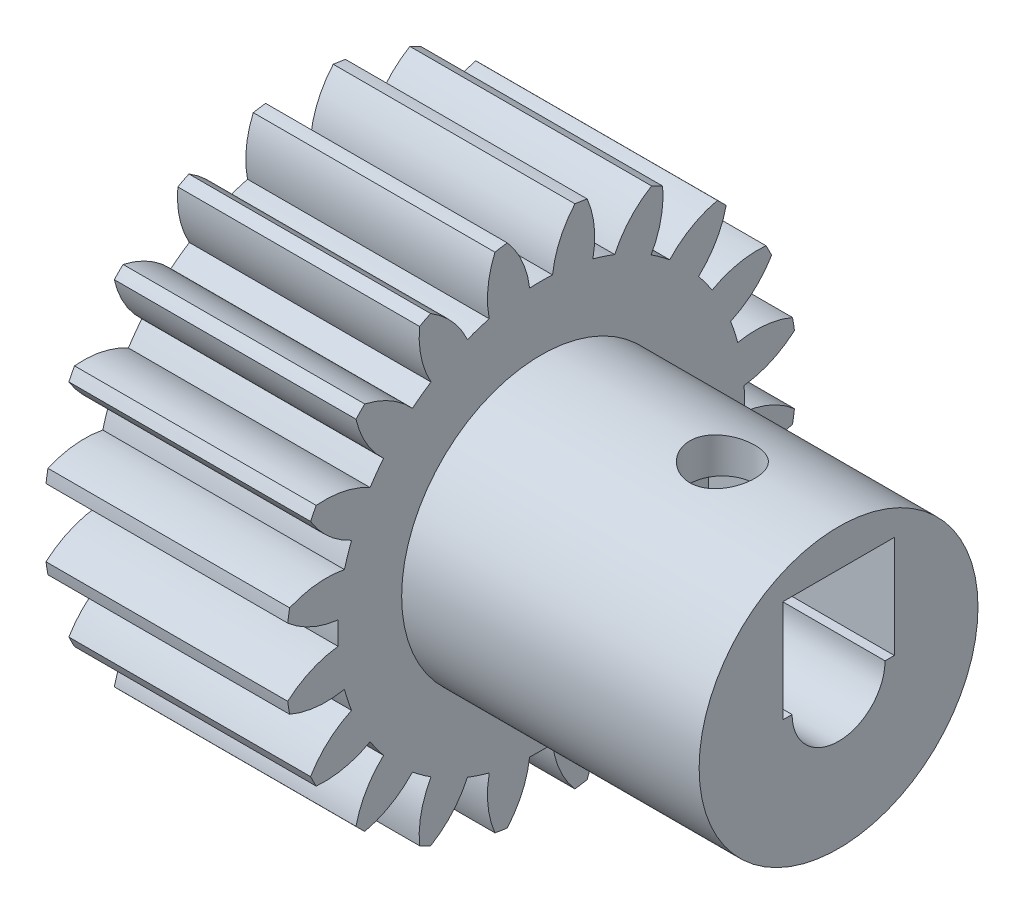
ISO-10303-21;
HEADER;
FILE_DESCRIPTION(('STEP AP214'),'2;1');
FILE_NAME('part.step','',(''),(''),'','','');
FILE_SCHEMA(('AUTOMOTIVE_DESIGN { 1 0 10303 214 1 1 1 1 }'));
ENDSEC;
DATA;
#1=APPLICATION_CONTEXT('core data for automotive mechanical design processes');
#2=APPLICATION_PROTOCOL_DEFINITION('international standard','automotive_design',2000,#1);
#3=PRODUCT_CONTEXT('',#1,'mechanical');
#4=PRODUCT('Part','Part','',(#3));
#5=PRODUCT_RELATED_PRODUCT_CATEGORY('part','',(#4));
#6=PRODUCT_DEFINITION_FORMATION('','',#4);
#7=PRODUCT_DEFINITION_CONTEXT('part definition',#1,'design');
#8=PRODUCT_DEFINITION('design','',#6,#7);
#9=PRODUCT_DEFINITION_SHAPE('','',#8);
#10=(LENGTH_UNIT() NAMED_UNIT(*) SI_UNIT(.MILLI.,.METRE.));
#11=(NAMED_UNIT(*) PLANE_ANGLE_UNIT() SI_UNIT($,.RADIAN.));
#12=(NAMED_UNIT(*) SI_UNIT($,.STERADIAN.) SOLID_ANGLE_UNIT());
#13=UNCERTAINTY_MEASURE_WITH_UNIT(LENGTH_MEASURE(1.E-05),#10,'distance_accuracy_value','');
#14=(GEOMETRIC_REPRESENTATION_CONTEXT(3) GLOBAL_UNCERTAINTY_ASSIGNED_CONTEXT((#13)) GLOBAL_UNIT_ASSIGNED_CONTEXT((#10,
#11,#12)) REPRESENTATION_CONTEXT('',''));
#15=CARTESIAN_POINT('',(0.,0.,0.));
#16=DIRECTION('',(0.,0.,1.));
#17=DIRECTION('',(1.,0.,0.));
#18=AXIS2_PLACEMENT_3D('',#15,#16,#17);
#19=CARTESIAN_POINT('',(48.5,0.,0.));
#20=DIRECTION('',(-1.,0.,0.));
#21=DIRECTION('',(0.,0.,1.));
#22=AXIS2_PLACEMENT_3D('',#19,#20,#21);
#23=CYLINDRICAL_SURFACE('',#22,7.5);
#24=CARTESIAN_POINT('',(32.5,0.,0.));
#25=DIRECTION('',(-1.,0.,0.));
#26=DIRECTION('',(0.,0.,1.));
#27=AXIS2_PLACEMENT_3D('',#24,#25,#26);
#28=CIRCLE('',#27,7.5);
#29=CARTESIAN_POINT('',(32.5,0.,7.5));
#30=VERTEX_POINT('',#29);
#31=EDGE_CURVE('E1142',#30,#30,#28,.F.);
#32=ORIENTED_EDGE('',*,*,#31,.T.);
#33=EDGE_LOOP('',(#32));
#34=FACE_BOUND('',#33,.T.);
#35=CARTESIAN_POINT('',(48.5,0.,0.));
#36=DIRECTION('',(1.,0.,0.));
#37=DIRECTION('',(0.,0.,-1.));
#38=AXIS2_PLACEMENT_3D('',#35,#36,#37);
#39=CIRCLE('',#38,7.5);
#40=CARTESIAN_POINT('',(48.5,0.,-7.5));
#41=VERTEX_POINT('',#40);
#42=EDGE_CURVE('E628',#41,#41,#39,.T.);
#43=ORIENTED_EDGE('',*,*,#42,.F.);
#44=EDGE_LOOP('',(#43));
#45=FACE_BOUND('',#44,.T.);
#46=CARTESIAN_POINT('',(42.25,7.29297607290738,-1.75));
#47=CARTESIAN_POINT('',(42.1531484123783,7.29297800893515,-1.74999691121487));
#48=CARTESIAN_POINT('',(42.0562610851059,7.29492641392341,-1.7419324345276));
#49=CARTESIAN_POINT('',(41.8652538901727,7.30249270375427,-1.70993011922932));
#50=CARTESIAN_POINT('',(41.7711358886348,7.30811300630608,-1.68598182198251));
#51=CARTESIAN_POINT('',(41.5884578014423,7.32235269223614,-1.62301703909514));
#52=CARTESIAN_POINT('',(41.4998912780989,7.33096852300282,-1.58401839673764));
#53=CARTESIAN_POINT('',(41.330552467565,7.35022414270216,-1.49211260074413));
#54=CARTESIAN_POINT('',(41.2497802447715,7.36086394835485,-1.43920533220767));
#55=CARTESIAN_POINT('',(41.0967719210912,7.38319707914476,-1.31990053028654));
#56=CARTESIAN_POINT('',(41.0247073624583,7.39490542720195,-1.25328576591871));
#57=CARTESIAN_POINT('',(40.8926663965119,7.41792544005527,-1.10892542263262));
#58=CARTESIAN_POINT('',(40.8326910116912,7.42923707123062,-1.03117890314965));
#59=CARTESIAN_POINT('',(40.7258417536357,7.45035394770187,-0.865600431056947));
#60=CARTESIAN_POINT('',(40.6791344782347,7.46013939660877,-0.77765822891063));
#61=CARTESIAN_POINT('',(40.6012275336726,7.4769308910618,-0.594905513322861));
#62=CARTESIAN_POINT('',(40.570025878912,7.48393729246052,-0.500095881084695));
#63=CARTESIAN_POINT('',(40.5245599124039,7.49427508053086,-0.308085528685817));
#64=CARTESIAN_POINT('',(40.5100048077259,7.49766948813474,-0.2109571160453));
#65=CARTESIAN_POINT('',(40.4973342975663,7.50061975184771,-0.0155817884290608));
#66=CARTESIAN_POINT('',(40.4992167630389,7.50017610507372,0.0826649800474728));
#67=CARTESIAN_POINT('',(40.5191547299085,7.49554784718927,0.275478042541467));
#68=CARTESIAN_POINT('',(40.5368966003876,7.49143578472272,0.370078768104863));
#69=CARTESIAN_POINT('',(40.5875480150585,7.48001618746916,0.554921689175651));
#70=CARTESIAN_POINT('',(40.6204583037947,7.47270849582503,0.645163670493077));
#71=CARTESIAN_POINT('',(40.7007789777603,7.45560461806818,0.819578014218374));
#72=CARTESIAN_POINT('',(40.7483049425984,7.44578870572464,0.903695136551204));
#73=CARTESIAN_POINT('',(40.8564210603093,7.42473958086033,1.0628725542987));
#74=CARTESIAN_POINT('',(40.9170132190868,7.41350615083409,1.13793145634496));
#75=CARTESIAN_POINT('',(41.0512376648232,7.39053896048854,1.27872977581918));
#76=CARTESIAN_POINT('',(41.1251443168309,7.37879965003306,1.34420698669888));
#77=CARTESIAN_POINT('',(41.2830116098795,7.35638991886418,1.46189143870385));
#78=CARTESIAN_POINT('',(41.3669726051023,7.34571953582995,1.51409821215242));
#79=CARTESIAN_POINT('',(41.5430296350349,7.32663858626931,1.60389910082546));
#80=CARTESIAN_POINT('',(41.6351550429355,7.3182366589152,1.64143758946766));
#81=CARTESIAN_POINT('',(41.8246504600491,7.30475908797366,1.70041749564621));
#82=CARTESIAN_POINT('',(41.9220195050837,7.2996828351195,1.72186186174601));
#83=CARTESIAN_POINT('',(42.1168261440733,7.2935573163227,1.74762540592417));
#84=CARTESIAN_POINT('',(42.2142101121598,7.29241766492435,1.75232903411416));
#85=CARTESIAN_POINT('',(42.4083708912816,7.29404956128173,1.74552372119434));
#86=CARTESIAN_POINT('',(42.5051477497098,7.29682079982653,1.73401606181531));
#87=CARTESIAN_POINT('',(42.6939687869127,7.3058762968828,1.69545004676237));
#88=CARTESIAN_POINT('',(42.7860598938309,7.31211146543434,1.66860884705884));
#89=CARTESIAN_POINT('',(42.964437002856,7.32734694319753,1.60037532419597));
#90=CARTESIAN_POINT('',(43.0507223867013,7.33634754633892,1.55898145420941));
#91=CARTESIAN_POINT('',(43.2166867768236,7.35629458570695,1.46198984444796));
#92=CARTESIAN_POINT('',(43.2962254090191,7.36727203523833,1.40615842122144));
#93=CARTESIAN_POINT('',(43.4449460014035,7.38985672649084,1.28217762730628));
#94=CARTESIAN_POINT('',(43.5141264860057,7.4014640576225,1.21402650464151));
#95=CARTESIAN_POINT('',(43.6416885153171,7.42430240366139,1.06558989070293));
#96=CARTESIAN_POINT('',(43.6998061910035,7.43551998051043,0.985075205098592));
#97=CARTESIAN_POINT('',(43.8016927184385,7.45605467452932,0.815203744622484));
#98=CARTESIAN_POINT('',(43.8454622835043,7.46537188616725,0.725847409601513));
#99=CARTESIAN_POINT('',(43.9170573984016,7.48100007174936,0.541419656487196));
#100=CARTESIAN_POINT('',(43.9449910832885,7.48733138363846,0.446392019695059));
#101=CARTESIAN_POINT('',(43.9844539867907,7.49636287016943,0.252826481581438));
#102=CARTESIAN_POINT('',(43.9959859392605,7.49906364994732,0.154289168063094));
#103=CARTESIAN_POINT('',(44.0021810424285,7.50050874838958,-0.0410057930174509));
#104=CARTESIAN_POINT('',(43.9972360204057,7.49934496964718,-0.137750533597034));
#105=CARTESIAN_POINT('',(43.9715034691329,7.49339172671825,-0.328989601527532));
#106=CARTESIAN_POINT('',(43.9507163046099,7.48860234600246,-0.423483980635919));
#107=CARTESIAN_POINT('',(43.8940878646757,7.4759462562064,-0.607188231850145));
#108=CARTESIAN_POINT('',(43.8583091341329,7.46809234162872,-0.696418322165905));
#109=CARTESIAN_POINT('',(43.7727717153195,7.45014037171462,-0.867657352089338));
#110=CARTESIAN_POINT('',(43.7230114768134,7.44004206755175,-0.94966548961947));
#111=CARTESIAN_POINT('',(43.6096831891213,7.41842885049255,-1.10602054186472));
#112=CARTESIAN_POINT('',(43.5458438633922,7.40688836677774,-1.1801673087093));
#113=CARTESIAN_POINT('',(43.406707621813,7.38381847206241,-1.31682912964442));
#114=CARTESIAN_POINT('',(43.3314078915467,7.37228906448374,-1.37934131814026));
#115=CARTESIAN_POINT('',(43.1700667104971,7.35034314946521,-1.49191307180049));
#116=CARTESIAN_POINT('',(43.0838752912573,7.33994693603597,-1.54176192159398));
#117=CARTESIAN_POINT('',(42.9041094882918,7.32170708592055,-1.62618714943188));
#118=CARTESIAN_POINT('',(42.8105410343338,7.31386142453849,-1.66077564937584));
#119=CARTESIAN_POINT('',(42.6391562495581,7.3029617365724,-1.70798052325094));
#120=CARTESIAN_POINT('',(42.5622234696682,7.29924342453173,-1.72370580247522));
#121=CARTESIAN_POINT('',(42.4068682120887,7.29424988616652,-1.74471646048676));
#122=CARTESIAN_POINT('',(42.3284458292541,7.29297450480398,-1.75000250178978));
#123=CARTESIAN_POINT('',(42.25,7.29297607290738,-1.75));
#124=B_SPLINE_CURVE_WITH_KNOTS('',3,(#46,#47,#48,#49,#50,#51,#52,#53,#54,#55,#56,#57,#58,#59,
#60,#61,#62,#63,#64,#65,#66,#67,#68,#69,#70,#71,#72,#73,#74,#75,#76,#77,#78,#79,#80,#81,#82,#83,
#84,#85,#86,#87,#88,#89,#90,#91,#92,#93,#94,#95,#96,#97,#98,#99,#100,#101,#102,#103,#104,#105,
#106,#107,#108,#109,#110,#111,#112,#113,#114,#115,#116,#117,#118,#119,#120,#121,#122,#123),
.UNSPECIFIED.,.T.,.F.,(4,2,2,2,2,2,2,2,2,2,2,2,2,2,2,2,2,2,2,2,2,2,2,2,2,2,2,2,2,2,2,2,2,2,2,2,
2,2,4),(0.,0.290267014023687,0.58072534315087,0.870840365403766,1.160957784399,1.4560863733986,
1.75123991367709,2.04995037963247,2.34862258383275,2.64199362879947,2.93532667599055,
3.22298412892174,3.51065570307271,3.80066335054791,4.090715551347,4.38762339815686,
4.68454170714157,4.98257533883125,5.2805543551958,5.57164449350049,5.86271161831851,
6.14975532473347,6.43682955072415,6.72887792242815,7.02096785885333,7.31933164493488,
7.61768059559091,7.91396694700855,8.2102039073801,8.49944701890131,8.78868347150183,
9.0767250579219,9.36479859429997,9.65900183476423,9.95327744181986,10.2521691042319,
10.550822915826,10.7859422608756,11.021046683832),.UNSPECIFIED.);
#125=CARTESIAN_POINT('',(42.25,7.29297607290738,-1.75));
#126=VERTEX_POINT('',#125);
#127=EDGE_CURVE('E603',#126,#126,#124,.T.);
#128=ORIENTED_EDGE('',*,*,#127,.F.);
#129=EDGE_LOOP('',(#128));
#130=FACE_BOUND('',#129,.T.);
#131=ADVANCED_FACE('F38',(#34,#45,#130),#23,.T.);
#132=CARTESIAN_POINT('',(38.5,5.5,-3.));
#133=DIRECTION('',(0.,1.,0.));
#134=DIRECTION('',(0.,0.,1.));
#135=AXIS2_PLACEMENT_3D('',#132,#133,#134);
#136=PLANE('',#135);
#137=DIRECTION('',(0.,0.,1.));
#138=VECTOR('',#137,1.);
#139=CARTESIAN_POINT('',(48.5,5.5,-3.));
#140=LINE('',#139,#138);
#141=CARTESIAN_POINT('',(48.5,5.5,-3.));
#142=VERTEX_POINT('',#141);
#143=CARTESIAN_POINT('',(48.5,5.5,3.));
#144=VERTEX_POINT('',#143);
#145=EDGE_CURVE('E612',#142,#144,#140,.T.);
#146=ORIENTED_EDGE('',*,*,#145,.T.);
#147=DIRECTION('',(1.,0.,0.));
#148=VECTOR('',#147,1.);
#149=CARTESIAN_POINT('',(38.5,5.5,3.));
#150=LINE('',#149,#148);
#151=CARTESIAN_POINT('',(38.5,5.5,3.));
#152=VERTEX_POINT('',#151);
#153=EDGE_CURVE('E585',#152,#144,#150,.T.);
#154=ORIENTED_EDGE('',*,*,#153,.F.);
#155=DIRECTION('',(0.,0.,1.));
#156=VECTOR('',#155,1.);
#157=CARTESIAN_POINT('',(38.5,5.5,-3.));
#158=LINE('',#157,#156);
#159=CARTESIAN_POINT('',(38.5,5.5,-3.));
#160=VERTEX_POINT('',#159);
#161=EDGE_CURVE('E588',#160,#152,#158,.T.);
#162=ORIENTED_EDGE('',*,*,#161,.F.);
#163=DIRECTION('',(1.,0.,0.));
#164=VECTOR('',#163,1.);
#165=CARTESIAN_POINT('',(38.5,5.5,-3.));
#166=LINE('',#165,#164);
#167=EDGE_CURVE('E574',#160,#142,#166,.T.);
#168=ORIENTED_EDGE('',*,*,#167,.T.);
#169=EDGE_LOOP('',(#146,#154,#162,#168));
#170=FACE_BOUND('',#169,.T.);
#171=CARTESIAN_POINT('',(42.25,5.5,0.));
#172=DIRECTION('',(0.,1.,0.));
#173=DIRECTION('',(0.,0.,1.));
#174=AXIS2_PLACEMENT_3D('',#171,#172,#173);
#175=CIRCLE('',#174,1.75);
#176=CARTESIAN_POINT('',(42.25,5.5,1.75));
#177=VERTEX_POINT('',#176);
#178=EDGE_CURVE('E42',#177,#177,#175,.F.);
#179=ORIENTED_EDGE('',*,*,#178,.F.);
#180=EDGE_LOOP('',(#179));
#181=FACE_BOUND('',#180,.T.);
#182=ADVANCED_FACE('F589',(#170,#181),#136,.F.);
#183=CARTESIAN_POINT('',(32.5,0.,0.));
#184=DIRECTION('',(-1.,0.,0.));
#185=DIRECTION('',(0.,0.,1.));
#186=AXIS2_PLACEMENT_3D('',#183,#184,#185);
#187=PLANE('',#186);
#188=CARTESIAN_POINT('',(32.5,8.10437924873,-8.50242666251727));
#189=DIRECTION('',(-1.,0.,0.));
#190=DIRECTION('',(0.,-0.309016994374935,-0.951056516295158));
#191=AXIS2_PLACEMENT_3D('',#188,#189,#190);
#192=CIRCLE('',#191,5.);
#193=CARTESIAN_POINT('',(32.5,10.1950013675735,-3.96047783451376));
#194=VERTEX_POINT('',#193);
#195=CARTESIAN_POINT('',(32.5,12.3994688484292,-5.94269907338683));
#196=VERTEX_POINT('',#195);
#197=EDGE_CURVE('E637',#194,#196,#192,.T.);
#198=ORIENTED_EDGE('',*,*,#197,.F.);
#199=CARTESIAN_POINT('',(32.5,0.,0.));
#200=DIRECTION('',(-1.,0.,0.));
#201=DIRECTION('',(0.,-0.309016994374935,-0.951056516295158));
#202=AXIS2_PLACEMENT_3D('',#199,#200,#201);
#203=CIRCLE('',#202,10.93725);
#204=CARTESIAN_POINT('',(32.5,10.5758398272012,-2.78837757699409));
#205=VERTEX_POINT('',#204);
#206=EDGE_CURVE('E642',#205,#194,#203,.T.);
#207=ORIENTED_EDGE('',*,*,#206,.F.);
#208=CARTESIAN_POINT('',(32.5,11.5541815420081,2.11497306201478));
#209=DIRECTION('',(-1.,0.,0.));
#210=DIRECTION('',(0.,-0.309016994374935,-0.951056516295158));
#211=AXIS2_PLACEMENT_3D('',#208,#209,#210);
#212=CIRCLE('',#211,5.);
#213=CARTESIAN_POINT('',(32.5,13.524411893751,-2.48048038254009));
#214=VERTEX_POINT('',#213);
#215=EDGE_CURVE('E639',#214,#205,#212,.T.);
#216=ORIENTED_EDGE('',*,*,#215,.F.);
#217=CARTESIAN_POINT('',(32.5,0.,0.));
#218=DIRECTION('',(-1.,0.,0.));
#219=DIRECTION('',(0.,0.,1.));
#220=AXIS2_PLACEMENT_3D('',#217,#218,#219);
#221=CIRCLE('',#220,13.75);
#222=CARTESIAN_POINT('',(32.5,13.6289906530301,-1.8201960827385));
#223=VERTEX_POINT('',#222);
#224=EDGE_CURVE('E1079',#223,#214,#221,.T.);
#225=ORIENTED_EDGE('',*,*,#224,.F.);
#226=CARTESIAN_POINT('',(32.5,10.3351170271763,-5.5818973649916));
#227=DIRECTION('',(-1.,0.,0.));
#228=DIRECTION('',(0.,0.,-1.));
#229=AXIS2_PLACEMENT_3D('',#226,#227,#228);
#230=CIRCLE('',#229,5.);
#231=CARTESIAN_POINT('',(32.5,10.9198774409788,-0.616209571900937));
#232=VERTEX_POINT('',#231);
#233=EDGE_CURVE('E1052',#232,#223,#230,.T.);
#234=ORIENTED_EDGE('',*,*,#233,.F.);
#235=CARTESIAN_POINT('',(32.5,0.,0.));
#236=DIRECTION('',(-1.,0.,0.));
#237=DIRECTION('',(0.,0.,-1.));
#238=AXIS2_PLACEMENT_3D('',#235,#236,#237);
#239=CIRCLE('',#238,10.93725);
#240=CARTESIAN_POINT('',(32.5,10.9198774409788,0.616209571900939));
#241=VERTEX_POINT('',#240);
#242=EDGE_CURVE('E1057',#241,#232,#239,.T.);
#243=ORIENTED_EDGE('',*,*,#242,.F.);
#244=CARTESIAN_POINT('',(32.5,10.3351170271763,5.5818973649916));
#245=DIRECTION('',(-1.,0.,0.));
#246=DIRECTION('',(0.,0.,-1.));
#247=AXIS2_PLACEMENT_3D('',#244,#245,#246);
#248=CIRCLE('',#247,5.);
#249=CARTESIAN_POINT('',(32.5,13.6289906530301,1.8201960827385));
#250=VERTEX_POINT('',#249);
#251=EDGE_CURVE('E1054',#250,#241,#248,.T.);
#252=ORIENTED_EDGE('',*,*,#251,.F.);
#253=CARTESIAN_POINT('',(32.5,13.5244118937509,2.48048038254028));
#254=VERTEX_POINT('',#253);
#255=EDGE_CURVE('E1077',#254,#250,#221,.T.);
#256=ORIENTED_EDGE('',*,*,#255,.F.);
#257=CARTESIAN_POINT('',(32.5,11.5541815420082,-2.11497306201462));
#258=DIRECTION('',(-1.,0.,0.));
#259=DIRECTION('',(0.,0.309016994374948,-0.951056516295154));
#260=AXIS2_PLACEMENT_3D('',#257,#258,#259);
#261=CIRCLE('',#260,5.);
#262=CARTESIAN_POINT('',(32.5,10.5758398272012,2.78837757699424));
#263=VERTEX_POINT('',#262);
#264=EDGE_CURVE('E1030',#263,#254,#261,.T.);
#265=ORIENTED_EDGE('',*,*,#264,.F.);
#266=CARTESIAN_POINT('',(32.5,0.,0.));
#267=DIRECTION('',(-1.,0.,0.));
#268=DIRECTION('',(0.,0.309016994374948,-0.951056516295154));
#269=AXIS2_PLACEMENT_3D('',#266,#267,#268);
#270=CIRCLE('',#269,10.93725);
#271=CARTESIAN_POINT('',(32.5,10.1950013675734,3.9604778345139));
#272=VERTEX_POINT('',#271);
#273=EDGE_CURVE('E1035',#272,#263,#270,.T.);
#274=ORIENTED_EDGE('',*,*,#273,.F.);
#275=CARTESIAN_POINT('',(32.5,8.10437924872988,8.50242666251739));
#276=DIRECTION('',(-1.,0.,0.));
#277=DIRECTION('',(0.,0.309016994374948,-0.951056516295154));
#278=AXIS2_PLACEMENT_3D('',#275,#276,#277);
#279=CIRCLE('',#278,5.);
#280=CARTESIAN_POINT('',(32.5,12.3994688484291,5.942699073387));
#281=VERTEX_POINT('',#280);
#282=EDGE_CURVE('E1032',#281,#272,#279,.T.);
#283=ORIENTED_EDGE('',*,*,#282,.F.);
#284=CARTESIAN_POINT('',(32.5,12.0959694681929,6.53835014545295));
#285=VERTEX_POINT('',#284);
#286=EDGE_CURVE('E1537',#285,#281,#221,.T.);
#287=ORIENTED_EDGE('',*,*,#286,.F.);
#288=CARTESIAN_POINT('',(32.5,11.6422422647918,1.55897954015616));
#289=DIRECTION('',(-1.,0.,0.));
#290=DIRECTION('',(0.,0.587785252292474,-0.809016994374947));
#291=AXIS2_PLACEMENT_3D('',#288,#289,#290);
#292=CIRCLE('',#291,5.);
#293=CARTESIAN_POINT('',(32.5,9.19656532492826,5.92001890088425));
#294=VERTEX_POINT('',#293);
#295=EDGE_CURVE('E1008',#294,#285,#292,.T.);
#296=ORIENTED_EDGE('',*,*,#295,.F.);
#297=CARTESIAN_POINT('',(32.5,0.,0.));
#298=DIRECTION('',(-1.,0.,0.));
#299=DIRECTION('',(0.,0.587785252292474,-0.809016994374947));
#300=AXIS2_PLACEMENT_3D('',#297,#298,#299);
#301=CIRCLE('',#300,10.93725);
#302=CARTESIAN_POINT('',(32.5,8.4721675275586,6.91706693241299));
#303=VERTEX_POINT('',#302);
#304=EDGE_CURVE('E1013',#303,#294,#301,.T.);
#305=ORIENTED_EDGE('',*,*,#304,.F.);
#306=CARTESIAN_POINT('',(32.5,5.08032836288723,10.590679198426));
#307=DIRECTION('',(-1.,0.,0.));
#308=DIRECTION('',(0.,0.587785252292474,-0.809016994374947));
#309=AXIS2_PLACEMENT_3D('',#306,#307,#308);
#310=CIRCLE('',#309,5.);
#311=CARTESIAN_POINT('',(32.5,9.95620064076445,9.48348927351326));
#312=VERTEX_POINT('',#311);
#313=EDGE_CURVE('E1010',#312,#303,#310,.T.);
#314=ORIENTED_EDGE('',*,*,#313,.F.);
#315=CARTESIAN_POINT('',(32.5,9.48348927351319,9.95620064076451));
#316=VERTEX_POINT('',#315);
#317=EDGE_CURVE('E1532',#316,#312,#221,.T.);
#318=ORIENTED_EDGE('',*,*,#317,.F.);
#319=CARTESIAN_POINT('',(32.5,10.590679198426,5.08032836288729));
#320=DIRECTION('',(-1.,0.,0.));
#321=DIRECTION('',(0.,0.809016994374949,-0.587785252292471));
#322=AXIS2_PLACEMENT_3D('',#319,#320,#321);
#323=CIRCLE('',#322,5.);
#324=CARTESIAN_POINT('',(32.5,6.91706693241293,8.47216752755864));
#325=VERTEX_POINT('',#324);
#326=EDGE_CURVE('E986',#325,#316,#323,.T.);
#327=ORIENTED_EDGE('',*,*,#326,.F.);
#328=CARTESIAN_POINT('',(32.5,0.,0.));
#329=DIRECTION('',(-1.,0.,0.));
#330=DIRECTION('',(0.,0.809016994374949,-0.587785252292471));
#331=AXIS2_PLACEMENT_3D('',#328,#329,#330);
#332=CIRCLE('',#331,10.93725);
#333=CARTESIAN_POINT('',(32.5,5.92001890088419,9.1965653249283));
#334=VERTEX_POINT('',#333);
#335=EDGE_CURVE('E991',#334,#325,#332,.T.);
#336=ORIENTED_EDGE('',*,*,#335,.F.);
#337=CARTESIAN_POINT('',(32.5,1.55897954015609,11.6422422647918));
#338=DIRECTION('',(-1.,0.,0.));
#339=DIRECTION('',(0.,0.809016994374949,-0.587785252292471));
#340=AXIS2_PLACEMENT_3D('',#337,#338,#339);
#341=CIRCLE('',#340,5.);
#342=CARTESIAN_POINT('',(32.5,6.53835014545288,12.0959694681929));
#343=VERTEX_POINT('',#342);
#344=EDGE_CURVE('E988',#343,#334,#341,.T.);
#345=ORIENTED_EDGE('',*,*,#344,.F.);
#346=CARTESIAN_POINT('',(32.5,5.94269907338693,12.3994688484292));
#347=VERTEX_POINT('',#346);
#348=EDGE_CURVE('E1527',#347,#343,#221,.T.);
#349=ORIENTED_EDGE('',*,*,#348,.F.);
#350=CARTESIAN_POINT('',(32.5,8.50242666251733,8.10437924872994));
#351=DIRECTION('',(-1.,0.,0.));
#352=DIRECTION('',(0.,0.951056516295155,-0.309016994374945));
#353=AXIS2_PLACEMENT_3D('',#350,#351,#352);
#354=CIRCLE('',#353,5.);
#355=CARTESIAN_POINT('',(32.5,3.96047783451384,10.1950013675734));
#356=VERTEX_POINT('',#355);
#357=EDGE_CURVE('E964',#356,#347,#354,.T.);
#358=ORIENTED_EDGE('',*,*,#357,.F.);
#359=CARTESIAN_POINT('',(32.5,0.,0.));
#360=DIRECTION('',(-1.,0.,0.));
#361=DIRECTION('',(0.,0.951056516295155,-0.309016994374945));
#362=AXIS2_PLACEMENT_3D('',#359,#360,#361);
#363=CIRCLE('',#362,10.93725);
#364=CARTESIAN_POINT('',(32.5,2.78837757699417,10.5758398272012));
#365=VERTEX_POINT('',#364);
#366=EDGE_CURVE('E969',#365,#356,#363,.T.);
#367=ORIENTED_EDGE('',*,*,#366,.F.);
#368=CARTESIAN_POINT('',(32.5,-2.11497306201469,11.5541815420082));
#369=DIRECTION('',(-1.,0.,0.));
#370=DIRECTION('',(0.,0.951056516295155,-0.309016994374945));
#371=AXIS2_PLACEMENT_3D('',#368,#369,#370);
#372=CIRCLE('',#371,5.);
#373=CARTESIAN_POINT('',(32.5,2.48048038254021,13.524411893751));
#374=VERTEX_POINT('',#373);
#375=EDGE_CURVE('E966',#374,#365,#372,.T.);
#376=ORIENTED_EDGE('',*,*,#375,.F.);
#377=CARTESIAN_POINT('',(32.5,1.82019608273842,13.6289906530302));
#378=VERTEX_POINT('',#377);
#379=EDGE_CURVE('E1522',#378,#374,#221,.T.);
#380=ORIENTED_EDGE('',*,*,#379,.F.);
#381=CARTESIAN_POINT('',(32.5,5.58189736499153,10.3351170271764));
#382=DIRECTION('',(-1.,0.,0.));
#383=DIRECTION('',(0.,1.,0.));
#384=AXIS2_PLACEMENT_3D('',#381,#382,#383);
#385=CIRCLE('',#384,5.);
#386=CARTESIAN_POINT('',(32.5,0.616209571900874,10.9198774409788));
#387=VERTEX_POINT('',#386);
#388=EDGE_CURVE('E942',#387,#378,#385,.T.);
#389=ORIENTED_EDGE('',*,*,#388,.F.);
#390=CARTESIAN_POINT('',(32.5,0.,0.));
#391=DIRECTION('',(-1.,0.,0.));
#392=DIRECTION('',(0.,1.,0.));
#393=AXIS2_PLACEMENT_3D('',#390,#391,#392);
#394=CIRCLE('',#393,10.93725);
#395=CARTESIAN_POINT('',(32.5,-0.616209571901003,10.9198774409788));
#396=VERTEX_POINT('',#395);
#397=EDGE_CURVE('E947',#396,#387,#394,.T.);
#398=ORIENTED_EDGE('',*,*,#397,.F.);
#399=CARTESIAN_POINT('',(32.5,-5.58189736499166,10.3351170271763));
#400=DIRECTION('',(-1.,0.,0.));
#401=DIRECTION('',(0.,1.,0.));
#402=AXIS2_PLACEMENT_3D('',#399,#400,#401);
#403=CIRCLE('',#402,5.);
#404=CARTESIAN_POINT('',(32.5,-1.82019608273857,13.6289906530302));
#405=VERTEX_POINT('',#404);
#406=EDGE_CURVE('E944',#405,#396,#403,.T.);
#407=ORIENTED_EDGE('',*,*,#406,.F.);
#408=CARTESIAN_POINT('',(32.5,-2.48048038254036,13.524411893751));
#409=VERTEX_POINT('',#408);
#410=EDGE_CURVE('E1517',#409,#405,#221,.T.);
#411=ORIENTED_EDGE('',*,*,#410,.F.);
#412=CARTESIAN_POINT('',(32.5,2.11497306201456,11.5541815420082));
#413=DIRECTION('',(-1.,0.,0.));
#414=DIRECTION('',(0.,0.951056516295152,0.309016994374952));
#415=AXIS2_PLACEMENT_3D('',#412,#413,#414);
#416=CIRCLE('',#415,5.);
#417=CARTESIAN_POINT('',(32.5,-2.7883775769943,10.5758398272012));
#418=VERTEX_POINT('',#417);
#419=EDGE_CURVE('E920',#418,#409,#416,.T.);
#420=ORIENTED_EDGE('',*,*,#419,.F.);
#421=CARTESIAN_POINT('',(32.5,0.,0.));
#422=DIRECTION('',(-1.,0.,0.));
#423=DIRECTION('',(0.,0.951056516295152,0.309016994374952));
#424=AXIS2_PLACEMENT_3D('',#421,#422,#423);
#425=CIRCLE('',#424,10.93725);
#426=CARTESIAN_POINT('',(32.5,-3.96047783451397,10.1950013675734));
#427=VERTEX_POINT('',#426);
#428=EDGE_CURVE('E925',#427,#418,#425,.T.);
#429=ORIENTED_EDGE('',*,*,#428,.F.);
#430=CARTESIAN_POINT('',(32.5,-8.50242666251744,8.10437924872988));
#431=DIRECTION('',(-1.,0.,0.));
#432=DIRECTION('',(0.,0.951056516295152,0.309016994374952));
#433=AXIS2_PLACEMENT_3D('',#430,#431,#432);
#434=CIRCLE('',#433,5.);
#435=CARTESIAN_POINT('',(32.5,-5.94269907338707,12.3994688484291));
#436=VERTEX_POINT('',#435);
#437=EDGE_CURVE('E922',#436,#427,#434,.T.);
#438=ORIENTED_EDGE('',*,*,#437,.F.);
#439=CARTESIAN_POINT('',(32.5,-6.53835014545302,12.0959694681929));
#440=VERTEX_POINT('',#439);
#441=EDGE_CURVE('E1512',#440,#436,#221,.T.);
#442=ORIENTED_EDGE('',*,*,#441,.F.);
#443=CARTESIAN_POINT('',(32.5,-1.55897954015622,11.6422422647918));
#444=DIRECTION('',(-1.,0.,0.));
#445=DIRECTION('',(0.,0.809016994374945,0.587785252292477));
#446=AXIS2_PLACEMENT_3D('',#443,#444,#445);
#447=CIRCLE('',#446,5.);
#448=CARTESIAN_POINT('',(32.5,-5.92001890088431,9.19656532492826));
#449=VERTEX_POINT('',#448);
#450=EDGE_CURVE('E898',#449,#440,#447,.T.);
#451=ORIENTED_EDGE('',*,*,#450,.F.);
#452=CARTESIAN_POINT('',(32.5,0.,0.));
#453=DIRECTION('',(-1.,0.,0.));
#454=DIRECTION('',(0.,0.809016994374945,0.587785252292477));
#455=AXIS2_PLACEMENT_3D('',#452,#453,#454);
#456=CIRCLE('',#455,10.93725);
#457=CARTESIAN_POINT('',(32.5,-6.91706693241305,8.4721675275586));
#458=VERTEX_POINT('',#457);
#459=EDGE_CURVE('E903',#458,#449,#456,.T.);
#460=ORIENTED_EDGE('',*,*,#459,.F.);
#461=CARTESIAN_POINT('',(32.5,-10.5906791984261,5.08032836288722));
#462=DIRECTION('',(-1.,0.,0.));
#463=DIRECTION('',(0.,0.809016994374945,0.587785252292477));
#464=AXIS2_PLACEMENT_3D('',#461,#462,#463);
#465=CIRCLE('',#464,5.);
#466=CARTESIAN_POINT('',(32.5,-9.48348927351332,9.95620064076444));
#467=VERTEX_POINT('',#466);
#468=EDGE_CURVE('E900',#467,#458,#465,.T.);
#469=ORIENTED_EDGE('',*,*,#468,.F.);
#470=CARTESIAN_POINT('',(32.5,-9.95620064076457,9.48348927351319));
#471=VERTEX_POINT('',#470);
#472=EDGE_CURVE('E1507',#471,#467,#221,.T.);
#473=ORIENTED_EDGE('',*,*,#472,.F.);
#474=CARTESIAN_POINT('',(32.5,-5.08032836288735,10.590679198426));
#475=DIRECTION('',(-1.,0.,0.));
#476=DIRECTION('',(0.,0.587785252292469,0.809016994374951));
#477=AXIS2_PLACEMENT_3D('',#474,#475,#476);
#478=CIRCLE('',#477,5.);
#479=CARTESIAN_POINT('',(32.5,-8.4721675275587,6.91706693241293));
#480=VERTEX_POINT('',#479);
#481=EDGE_CURVE('E876',#480,#471,#478,.T.);
#482=ORIENTED_EDGE('',*,*,#481,.F.);
#483=CARTESIAN_POINT('',(32.5,0.,0.));
#484=DIRECTION('',(-1.,0.,0.));
#485=DIRECTION('',(0.,0.587785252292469,0.809016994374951));
#486=AXIS2_PLACEMENT_3D('',#483,#484,#485);
#487=CIRCLE('',#486,10.93725);
#488=CARTESIAN_POINT('',(32.5,-9.19656532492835,5.92001890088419));
#489=VERTEX_POINT('',#488);
#490=EDGE_CURVE('E881',#489,#480,#487,.T.);
#491=ORIENTED_EDGE('',*,*,#490,.F.);
#492=CARTESIAN_POINT('',(32.5,-11.6422422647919,1.55897954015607));
#493=DIRECTION('',(-1.,0.,0.));
#494=DIRECTION('',(0.,0.587785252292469,0.809016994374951));
#495=AXIS2_PLACEMENT_3D('',#492,#493,#494);
#496=CIRCLE('',#495,5.);
#497=CARTESIAN_POINT('',(32.5,-12.095969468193,6.53835014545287));
#498=VERTEX_POINT('',#497);
#499=EDGE_CURVE('E878',#498,#489,#496,.T.);
#500=ORIENTED_EDGE('',*,*,#499,.F.);
#501=CARTESIAN_POINT('',(32.5,-12.3994688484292,5.94269907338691));
#502=VERTEX_POINT('',#501);
#503=EDGE_CURVE('E1502',#502,#498,#221,.T.);
#504=ORIENTED_EDGE('',*,*,#503,.F.);
#505=CARTESIAN_POINT('',(32.5,-8.10437924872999,8.50242666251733));
#506=DIRECTION('',(-1.,0.,0.));
#507=DIRECTION('',(0.,0.309016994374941,0.951056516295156));
#508=AXIS2_PLACEMENT_3D('',#505,#506,#507);
#509=CIRCLE('',#508,5.);
#510=CARTESIAN_POINT('',(32.5,-10.1950013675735,3.96047783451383));
#511=VERTEX_POINT('',#510);
#512=EDGE_CURVE('E854',#511,#502,#509,.T.);
#513=ORIENTED_EDGE('',*,*,#512,.F.);
#514=CARTESIAN_POINT('',(32.5,0.,0.));
#515=DIRECTION('',(-1.,0.,0.));
#516=DIRECTION('',(0.,0.309016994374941,0.951056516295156));
#517=AXIS2_PLACEMENT_3D('',#514,#515,#516);
#518=CIRCLE('',#517,10.93725);
#519=CARTESIAN_POINT('',(32.5,-10.5758398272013,2.78837757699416));
#520=VERTEX_POINT('',#519);
#521=EDGE_CURVE('E859',#520,#511,#518,.T.);
#522=ORIENTED_EDGE('',*,*,#521,.F.);
#523=CARTESIAN_POINT('',(32.5,-11.5541815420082,-2.11497306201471));
#524=DIRECTION('',(-1.,0.,0.));
#525=DIRECTION('',(0.,0.309016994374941,0.951056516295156));
#526=AXIS2_PLACEMENT_3D('',#523,#524,#525);
#527=CIRCLE('',#526,5.);
#528=CARTESIAN_POINT('',(32.5,-13.524411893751,2.48048038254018));
#529=VERTEX_POINT('',#528);
#530=EDGE_CURVE('E856',#529,#520,#527,.T.);
#531=ORIENTED_EDGE('',*,*,#530,.F.);
#532=CARTESIAN_POINT('',(32.5,-13.6289906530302,1.8201960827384));
#533=VERTEX_POINT('',#532);
#534=EDGE_CURVE('E1497',#533,#529,#221,.T.);
#535=ORIENTED_EDGE('',*,*,#534,.F.);
#536=CARTESIAN_POINT('',(32.5,-10.3351170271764,5.58189736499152));
#537=DIRECTION('',(-1.,0.,0.));
#538=DIRECTION('',(0.,0.,1.));
#539=AXIS2_PLACEMENT_3D('',#536,#537,#538);
#540=CIRCLE('',#539,5.);
#541=CARTESIAN_POINT('',(32.5,-10.9198774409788,0.616209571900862));
#542=VERTEX_POINT('',#541);
#543=EDGE_CURVE('E832',#542,#533,#540,.T.);
#544=ORIENTED_EDGE('',*,*,#543,.F.);
#545=CARTESIAN_POINT('',(32.5,0.,0.));
#546=DIRECTION('',(-1.,0.,0.));
#547=DIRECTION('',(0.,0.,1.));
#548=AXIS2_PLACEMENT_3D('',#545,#546,#547);
#549=CIRCLE('',#548,10.93725);
#550=CARTESIAN_POINT('',(32.5,-10.9198774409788,-0.616209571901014));
#551=VERTEX_POINT('',#550);
#552=EDGE_CURVE('E837',#551,#542,#549,.T.);
#553=ORIENTED_EDGE('',*,*,#552,.F.);
#554=CARTESIAN_POINT('',(32.5,-10.3351170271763,-5.58189736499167));
#555=DIRECTION('',(-1.,0.,0.));
#556=DIRECTION('',(0.,0.,1.));
#557=AXIS2_PLACEMENT_3D('',#554,#555,#556);
#558=CIRCLE('',#557,5.);
#559=CARTESIAN_POINT('',(32.5,-13.6289906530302,-1.82019608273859));
#560=VERTEX_POINT('',#559);
#561=EDGE_CURVE('E834',#560,#551,#558,.T.);
#562=ORIENTED_EDGE('',*,*,#561,.F.);
#563=CARTESIAN_POINT('',(32.5,-13.524411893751,-2.48048038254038));
#564=VERTEX_POINT('',#563);
#565=EDGE_CURVE('E1492',#564,#560,#221,.T.);
#566=ORIENTED_EDGE('',*,*,#565,.F.);
#567=CARTESIAN_POINT('',(32.5,-11.5541815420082,2.11497306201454));
#568=DIRECTION('',(-1.,0.,0.));
#569=DIRECTION('',(0.,-0.309016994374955,0.951056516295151));
#570=AXIS2_PLACEMENT_3D('',#567,#568,#569);
#571=CIRCLE('',#570,5.);
#572=CARTESIAN_POINT('',(32.5,-10.5758398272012,-2.78837757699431));
#573=VERTEX_POINT('',#572);
#574=EDGE_CURVE('E810',#573,#564,#571,.T.);
#575=ORIENTED_EDGE('',*,*,#574,.F.);
#576=CARTESIAN_POINT('',(32.5,0.,0.));
#577=DIRECTION('',(-1.,0.,0.));
#578=DIRECTION('',(0.,-0.309016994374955,0.951056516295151));
#579=AXIS2_PLACEMENT_3D('',#576,#577,#578);
#580=CIRCLE('',#579,10.93725);
#581=CARTESIAN_POINT('',(32.5,-10.1950013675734,-3.96047783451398));
#582=VERTEX_POINT('',#581);
#583=EDGE_CURVE('E815',#582,#573,#580,.T.);
#584=ORIENTED_EDGE('',*,*,#583,.F.);
#585=CARTESIAN_POINT('',(32.5,-8.10437924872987,-8.50242666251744));
#586=DIRECTION('',(-1.,0.,0.));
#587=DIRECTION('',(0.,-0.309016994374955,0.951056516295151));
#588=AXIS2_PLACEMENT_3D('',#585,#586,#587);
#589=CIRCLE('',#588,5.);
#590=CARTESIAN_POINT('',(32.5,-12.3994688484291,-5.94269907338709));
#591=VERTEX_POINT('',#590);
#592=EDGE_CURVE('E812',#591,#582,#589,.T.);
#593=ORIENTED_EDGE('',*,*,#592,.F.);
#594=CARTESIAN_POINT('',(32.5,-12.0959694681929,-6.53835014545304));
#595=VERTEX_POINT('',#594);
#596=EDGE_CURVE('E1487',#595,#591,#221,.T.);
#597=ORIENTED_EDGE('',*,*,#596,.F.);
#598=CARTESIAN_POINT('',(32.5,-11.6422422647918,-1.55897954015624));
#599=DIRECTION('',(-1.,0.,0.));
#600=DIRECTION('',(0.,-0.58778525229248,0.809016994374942));
#601=AXIS2_PLACEMENT_3D('',#598,#599,#600);
#602=CIRCLE('',#601,5.);
#603=CARTESIAN_POINT('',(32.5,-9.19656532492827,-5.92001890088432));
#604=VERTEX_POINT('',#603);
#605=EDGE_CURVE('E788',#604,#595,#602,.T.);
#606=ORIENTED_EDGE('',*,*,#605,.F.);
#607=CARTESIAN_POINT('',(32.5,0.,0.));
#608=DIRECTION('',(-1.,0.,0.));
#609=DIRECTION('',(0.,-0.58778525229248,0.809016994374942));
#610=AXIS2_PLACEMENT_3D('',#607,#608,#609);
#611=CIRCLE('',#610,10.93725);
#612=CARTESIAN_POINT('',(32.5,-8.4721675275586,-6.91706693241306));
#613=VERTEX_POINT('',#612);
#614=EDGE_CURVE('E793',#613,#604,#611,.T.);
#615=ORIENTED_EDGE('',*,*,#614,.F.);
#616=CARTESIAN_POINT('',(32.5,-5.0803283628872,-10.5906791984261));
#617=DIRECTION('',(-1.,0.,0.));
#618=DIRECTION('',(0.,-0.58778525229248,0.809016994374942));
#619=AXIS2_PLACEMENT_3D('',#616,#617,#618);
#620=CIRCLE('',#619,5.);
#621=CARTESIAN_POINT('',(32.5,-9.95620064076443,-9.48348927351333));
#622=VERTEX_POINT('',#621);
#623=EDGE_CURVE('E790',#622,#613,#620,.T.);
#624=ORIENTED_EDGE('',*,*,#623,.F.);
#625=CARTESIAN_POINT('',(32.5,-9.48348927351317,-9.95620064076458));
#626=VERTEX_POINT('',#625);
#627=EDGE_CURVE('E1482',#626,#622,#221,.T.);
#628=ORIENTED_EDGE('',*,*,#627,.F.);
#629=CARTESIAN_POINT('',(32.5,-10.590679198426,-5.08032836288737));
#630=DIRECTION('',(-1.,0.,0.));
#631=DIRECTION('',(0.,-0.809016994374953,0.587785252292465));
#632=AXIS2_PLACEMENT_3D('',#629,#630,#631);
#633=CIRCLE('',#632,5.);
#634=CARTESIAN_POINT('',(32.5,-6.91706693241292,-8.4721675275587));
#635=VERTEX_POINT('',#634);
#636=EDGE_CURVE('E766',#635,#626,#633,.T.);
#637=ORIENTED_EDGE('',*,*,#636,.F.);
#638=CARTESIAN_POINT('',(32.5,0.,0.));
#639=DIRECTION('',(-1.,0.,0.));
#640=DIRECTION('',(0.,-0.809016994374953,0.587785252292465));
#641=AXIS2_PLACEMENT_3D('',#638,#639,#640);
#642=CIRCLE('',#641,10.93725);
#643=CARTESIAN_POINT('',(32.5,-5.92001890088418,-9.19656532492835));
#644=VERTEX_POINT('',#643);
#645=EDGE_CURVE('E771',#644,#635,#642,.T.);
#646=ORIENTED_EDGE('',*,*,#645,.F.);
#647=CARTESIAN_POINT('',(32.5,-1.55897954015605,-11.6422422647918));
#648=DIRECTION('',(-1.,0.,0.));
#649=DIRECTION('',(0.,-0.809016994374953,0.587785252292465));
#650=AXIS2_PLACEMENT_3D('',#647,#648,#649);
#651=CIRCLE('',#650,5.);
#652=CARTESIAN_POINT('',(32.5,-6.53835014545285,-12.095969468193));
#653=VERTEX_POINT('',#652);
#654=EDGE_CURVE('E768',#653,#644,#651,.T.);
#655=ORIENTED_EDGE('',*,*,#654,.F.);
#656=CARTESIAN_POINT('',(32.5,-5.9426990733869,-12.3994688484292));
#657=VERTEX_POINT('',#656);
#658=EDGE_CURVE('E1477',#657,#653,#221,.T.);
#659=ORIENTED_EDGE('',*,*,#658,.F.);
#660=CARTESIAN_POINT('',(32.5,-8.50242666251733,-8.10437924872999));
#661=DIRECTION('',(-1.,0.,0.));
#662=DIRECTION('',(0.,-0.951056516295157,0.309016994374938));
#663=AXIS2_PLACEMENT_3D('',#660,#661,#662);
#664=CIRCLE('',#663,5.);
#665=CARTESIAN_POINT('',(32.5,-3.96047783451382,-10.1950013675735));
#666=VERTEX_POINT('',#665);
#667=EDGE_CURVE('E744',#666,#657,#664,.T.);
#668=ORIENTED_EDGE('',*,*,#667,.F.);
#669=CARTESIAN_POINT('',(32.5,0.,0.));
#670=DIRECTION('',(-1.,0.,0.));
#671=DIRECTION('',(0.,-0.951056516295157,0.309016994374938));
#672=AXIS2_PLACEMENT_3D('',#669,#670,#671);
#673=CIRCLE('',#672,10.93725);
#674=CARTESIAN_POINT('',(32.5,-2.78837757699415,-10.5758398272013));
#675=VERTEX_POINT('',#674);
#676=EDGE_CURVE('E749',#675,#666,#673,.T.);
#677=ORIENTED_EDGE('',*,*,#676,.F.);
#678=CARTESIAN_POINT('',(32.5,2.11497306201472,-11.5541815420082));
#679=DIRECTION('',(-1.,0.,0.));
#680=DIRECTION('',(0.,-0.951056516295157,0.309016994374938));
#681=AXIS2_PLACEMENT_3D('',#678,#679,#680);
#682=CIRCLE('',#681,5.);
#683=CARTESIAN_POINT('',(32.5,-2.48048038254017,-13.524411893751));
#684=VERTEX_POINT('',#683);
#685=EDGE_CURVE('E746',#684,#675,#682,.T.);
#686=ORIENTED_EDGE('',*,*,#685,.F.);
#687=CARTESIAN_POINT('',(32.5,-1.82019608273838,-13.6289906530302));
#688=VERTEX_POINT('',#687);
#689=EDGE_CURVE('E1472',#688,#684,#221,.T.);
#690=ORIENTED_EDGE('',*,*,#689,.F.);
#691=CARTESIAN_POINT('',(32.5,-5.58189736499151,-10.3351170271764));
#692=DIRECTION('',(-1.,0.,0.));
#693=DIRECTION('',(0.,-1.,0.));
#694=AXIS2_PLACEMENT_3D('',#691,#692,#693);
#695=CIRCLE('',#694,5.);
#696=CARTESIAN_POINT('',(32.5,-0.616209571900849,-10.9198774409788));
#697=VERTEX_POINT('',#696);
#698=EDGE_CURVE('E722',#697,#688,#695,.T.);
#699=ORIENTED_EDGE('',*,*,#698,.F.);
#700=CARTESIAN_POINT('',(32.5,0.,0.));
#701=DIRECTION('',(-1.,0.,0.));
#702=DIRECTION('',(0.,-1.,0.));
#703=AXIS2_PLACEMENT_3D('',#700,#701,#702);
#704=CIRCLE('',#703,10.93725);
#705=CARTESIAN_POINT('',(32.5,0.616209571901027,-10.9198774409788));
#706=VERTEX_POINT('',#705);
#707=EDGE_CURVE('E727',#706,#697,#704,.T.);
#708=ORIENTED_EDGE('',*,*,#707,.F.);
#709=CARTESIAN_POINT('',(32.5,5.58189736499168,-10.3351170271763));
#710=DIRECTION('',(-1.,0.,0.));
#711=DIRECTION('',(0.,-1.,0.));
#712=AXIS2_PLACEMENT_3D('',#709,#710,#711);
#713=CIRCLE('',#712,5.);
#714=CARTESIAN_POINT('',(32.5,1.82019608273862,-13.6289906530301));
#715=VERTEX_POINT('',#714);
#716=EDGE_CURVE('E724',#715,#706,#713,.T.);
#717=ORIENTED_EDGE('',*,*,#716,.F.);
#718=CARTESIAN_POINT('',(32.5,2.4804803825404,-13.5244118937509));
#719=VERTEX_POINT('',#718);
#720=EDGE_CURVE('E1467',#719,#715,#221,.T.);
#721=ORIENTED_EDGE('',*,*,#720,.F.);
#722=CARTESIAN_POINT('',(32.5,-2.11497306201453,-11.5541815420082));
#723=DIRECTION('',(-1.,0.,0.));
#724=DIRECTION('',(0.,-0.95105651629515,-0.309016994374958));
#725=AXIS2_PLACEMENT_3D('',#722,#723,#724);
#726=CIRCLE('',#725,5.);
#727=CARTESIAN_POINT('',(32.5,2.78837757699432,-10.5758398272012));
#728=VERTEX_POINT('',#727);
#729=EDGE_CURVE('E700',#728,#719,#726,.T.);
#730=ORIENTED_EDGE('',*,*,#729,.F.);
#731=CARTESIAN_POINT('',(32.5,0.,0.));
#732=DIRECTION('',(-1.,0.,0.));
#733=DIRECTION('',(0.,-0.95105651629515,-0.309016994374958));
#734=AXIS2_PLACEMENT_3D('',#731,#732,#733);
#735=CIRCLE('',#734,10.93725);
#736=CARTESIAN_POINT('',(32.5,3.96047783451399,-10.1950013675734));
#737=VERTEX_POINT('',#736);
#738=EDGE_CURVE('E705',#737,#728,#735,.T.);
#739=ORIENTED_EDGE('',*,*,#738,.F.);
#740=CARTESIAN_POINT('',(32.5,8.50242666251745,-8.10437924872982));
#741=DIRECTION('',(-1.,0.,0.));
#742=DIRECTION('',(0.,-0.95105651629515,-0.309016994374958));
#743=AXIS2_PLACEMENT_3D('',#740,#741,#742);
#744=CIRCLE('',#743,5.);
#745=CARTESIAN_POINT('',(32.5,5.9426990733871,-12.3994688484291));
#746=VERTEX_POINT('',#745);
#747=EDGE_CURVE('E702',#746,#737,#744,.T.);
#748=ORIENTED_EDGE('',*,*,#747,.F.);
#749=CARTESIAN_POINT('',(32.5,6.53835014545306,-12.0959694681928));
#750=VERTEX_POINT('',#749);
#751=EDGE_CURVE('E1462',#750,#746,#221,.T.);
#752=ORIENTED_EDGE('',*,*,#751,.F.);
#753=CARTESIAN_POINT('',(32.5,1.55897954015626,-11.6422422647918));
#754=DIRECTION('',(-1.,0.,0.));
#755=DIRECTION('',(0.,-0.80901699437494,-0.587785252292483));
#756=AXIS2_PLACEMENT_3D('',#753,#754,#755);
#757=CIRCLE('',#756,5.);
#758=CARTESIAN_POINT('',(32.5,5.92001890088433,-9.19656532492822));
#759=VERTEX_POINT('',#758);
#760=EDGE_CURVE('E678',#759,#750,#757,.T.);
#761=ORIENTED_EDGE('',*,*,#760,.F.);
#762=CARTESIAN_POINT('',(32.5,0.,0.));
#763=DIRECTION('',(-1.,0.,0.));
#764=DIRECTION('',(0.,-0.80901699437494,-0.587785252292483));
#765=AXIS2_PLACEMENT_3D('',#762,#763,#764);
#766=CIRCLE('',#765,10.93725);
#767=CARTESIAN_POINT('',(32.5,6.91706693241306,-8.47216752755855));
#768=VERTEX_POINT('',#767);
#769=EDGE_CURVE('E683',#768,#759,#766,.T.);
#770=ORIENTED_EDGE('',*,*,#769,.F.);
#771=CARTESIAN_POINT('',(32.5,10.5906791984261,-5.08032836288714));
#772=DIRECTION('',(-1.,0.,0.));
#773=DIRECTION('',(0.,-0.80901699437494,-0.587785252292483));
#774=AXIS2_PLACEMENT_3D('',#771,#772,#773);
#775=CIRCLE('',#774,5.);
#776=CARTESIAN_POINT('',(32.5,9.48348927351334,-9.95620064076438));
#777=VERTEX_POINT('',#776);
#778=EDGE_CURVE('E680',#777,#768,#775,.T.);
#779=ORIENTED_EDGE('',*,*,#778,.F.);
#780=CARTESIAN_POINT('',(32.5,9.95620064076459,-9.48348927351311));
#781=VERTEX_POINT('',#780);
#782=EDGE_CURVE('E1461',#781,#777,#221,.T.);
#783=ORIENTED_EDGE('',*,*,#782,.F.);
#784=CARTESIAN_POINT('',(32.5,5.08032836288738,-10.590679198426));
#785=DIRECTION('',(-1.,0.,0.));
#786=DIRECTION('',(0.,-0.587785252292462,-0.809016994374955));
#787=AXIS2_PLACEMENT_3D('',#784,#785,#786);
#788=CIRCLE('',#787,5.);
#789=CARTESIAN_POINT('',(32.5,8.4721675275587,-6.91706693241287));
#790=VERTEX_POINT('',#789);
#791=EDGE_CURVE('E656',#790,#781,#788,.T.);
#792=ORIENTED_EDGE('',*,*,#791,.F.);
#793=CARTESIAN_POINT('',(32.5,0.,0.));
#794=DIRECTION('',(-1.,0.,0.));
#795=DIRECTION('',(0.,-0.587785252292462,-0.809016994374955));
#796=AXIS2_PLACEMENT_3D('',#793,#794,#795);
#797=CIRCLE('',#796,10.93725);
#798=CARTESIAN_POINT('',(32.5,9.19656532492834,-5.92001890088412));
#799=VERTEX_POINT('',#798);
#800=EDGE_CURVE('E661',#799,#790,#797,.T.);
#801=ORIENTED_EDGE('',*,*,#800,.F.);
#802=CARTESIAN_POINT('',(32.5,11.6422422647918,-1.55897954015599));
#803=DIRECTION('',(-1.,0.,0.));
#804=DIRECTION('',(0.,-0.587785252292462,-0.809016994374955));
#805=AXIS2_PLACEMENT_3D('',#802,#803,#804);
#806=CIRCLE('',#805,5.);
#807=CARTESIAN_POINT('',(32.5,12.095969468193,-6.53835014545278));
#808=VERTEX_POINT('',#807);
#809=EDGE_CURVE('E658',#808,#799,#806,.T.);
#810=ORIENTED_EDGE('',*,*,#809,.F.);
#811=EDGE_CURVE('E1083',#196,#808,#221,.T.);
#812=ORIENTED_EDGE('',*,*,#811,.F.);
#813=EDGE_LOOP('',(#198,#207,#216,#225,#234,#243,#252,#256,#265,#274,#283,#287,#296,#305,#314,
#318,#327,#336,#345,#349,#358,#367,#376,#380,#389,#398,#407,#411,#420,#429,#438,#442,#451,#460,
#469,#473,#482,#491,#500,#504,#513,#522,#531,#535,#544,#553,#562,#566,#575,#584,#593,#597,#606,
#615,#624,#628,#637,#646,#655,#659,#668,#677,#686,#690,#699,#708,#717,#721,#730,#739,#748,#752,
#761,#770,#779,#783,#792,#801,#810,#812));
#814=FACE_BOUND('',#813,.T.);
#815=ORIENTED_EDGE('',*,*,#31,.F.);
#816=EDGE_LOOP('',(#815));
#817=FACE_BOUND('',#816,.T.);
#818=ADVANCED_FACE('F40',(#814,#817),#187,.F.);
#819=CARTESIAN_POINT('',(19.5,0.,0.));
#820=DIRECTION('',(1.,0.,0.));
#821=DIRECTION('',(0.,0.,-1.));
#822=AXIS2_PLACEMENT_3D('',#819,#820,#821);
#823=PLANE('',#822);
#824=CARTESIAN_POINT('',(19.5,8.10437924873,-8.50242666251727));
#825=DIRECTION('',(-1.,0.,0.));
#826=DIRECTION('',(0.,-0.309016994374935,-0.951056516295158));
#827=AXIS2_PLACEMENT_3D('',#824,#825,#826);
#828=CIRCLE('',#827,5.);
#829=CARTESIAN_POINT('',(19.5,10.1950013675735,-3.96047783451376));
#830=VERTEX_POINT('',#829);
#831=CARTESIAN_POINT('',(19.5,12.3994688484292,-5.94269907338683));
#832=VERTEX_POINT('',#831);
#833=EDGE_CURVE('E62',#830,#832,#828,.T.);
#834=ORIENTED_EDGE('',*,*,#833,.T.);
#835=CARTESIAN_POINT('',(19.5,0.,0.));
#836=DIRECTION('',(-1.,0.,0.));
#837=DIRECTION('',(0.,0.,1.));
#838=AXIS2_PLACEMENT_3D('',#835,#836,#837);
#839=CIRCLE('',#838,13.75);
#840=CARTESIAN_POINT('',(19.5,12.095969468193,-6.53835014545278));
#841=VERTEX_POINT('',#840);
#842=EDGE_CURVE('E1078',#832,#841,#839,.T.);
#843=ORIENTED_EDGE('',*,*,#842,.T.);
#844=CARTESIAN_POINT('',(19.5,11.6422422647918,-1.55897954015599));
#845=DIRECTION('',(1.,0.,0.));
#846=DIRECTION('',(0.,0.,-1.));
#847=AXIS2_PLACEMENT_3D('',#844,#845,#846);
#848=CIRCLE('',#847,5.);
#849=CARTESIAN_POINT('',(19.5,9.19656532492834,-5.92001890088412));
#850=VERTEX_POINT('',#849);
#851=EDGE_CURVE('E1137',#850,#841,#848,.T.);
#852=ORIENTED_EDGE('',*,*,#851,.F.);
#853=CARTESIAN_POINT('',(19.5,0.,0.));
#854=DIRECTION('',(-1.,0.,0.));
#855=DIRECTION('',(0.,-0.587785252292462,-0.809016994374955));
#856=AXIS2_PLACEMENT_3D('',#853,#854,#855);
#857=CIRCLE('',#856,10.93725);
#858=CARTESIAN_POINT('',(19.5,8.4721675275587,-6.91706693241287));
#859=VERTEX_POINT('',#858);
#860=EDGE_CURVE('E659',#850,#859,#857,.T.);
#861=ORIENTED_EDGE('',*,*,#860,.T.);
#862=CARTESIAN_POINT('',(19.5,5.08032836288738,-10.590679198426));
#863=DIRECTION('',(-1.,0.,0.));
#864=DIRECTION('',(0.,-0.587785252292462,-0.809016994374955));
#865=AXIS2_PLACEMENT_3D('',#862,#863,#864);
#866=CIRCLE('',#865,5.);
#867=CARTESIAN_POINT('',(19.5,9.95620064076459,-9.48348927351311));
#868=VERTEX_POINT('',#867);
#869=EDGE_CURVE('E655',#859,#868,#866,.T.);
#870=ORIENTED_EDGE('',*,*,#869,.T.);
#871=CARTESIAN_POINT('',(19.5,9.48348927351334,-9.95620064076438));
#872=VERTEX_POINT('',#871);
#873=EDGE_CURVE('E1566',#868,#872,#839,.T.);
#874=ORIENTED_EDGE('',*,*,#873,.T.);
#875=CARTESIAN_POINT('',(19.5,10.5906791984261,-5.08032836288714));
#876=DIRECTION('',(1.,0.,0.));
#877=DIRECTION('',(0.,0.,-1.));
#878=AXIS2_PLACEMENT_3D('',#875,#876,#877);
#879=CIRCLE('',#878,5.);
#880=CARTESIAN_POINT('',(19.5,6.91706693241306,-8.47216752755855));
#881=VERTEX_POINT('',#880);
#882=EDGE_CURVE('E1134',#881,#872,#879,.T.);
#883=ORIENTED_EDGE('',*,*,#882,.F.);
#884=CARTESIAN_POINT('',(19.5,0.,0.));
#885=DIRECTION('',(-1.,0.,0.));
#886=DIRECTION('',(0.,-0.80901699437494,-0.587785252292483));
#887=AXIS2_PLACEMENT_3D('',#884,#885,#886);
#888=CIRCLE('',#887,10.93725);
#889=CARTESIAN_POINT('',(19.5,5.92001890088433,-9.19656532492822));
#890=VERTEX_POINT('',#889);
#891=EDGE_CURVE('E681',#881,#890,#888,.T.);
#892=ORIENTED_EDGE('',*,*,#891,.T.);
#893=CARTESIAN_POINT('',(19.5,1.55897954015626,-11.6422422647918));
#894=DIRECTION('',(-1.,0.,0.));
#895=DIRECTION('',(0.,-0.80901699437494,-0.587785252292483));
#896=AXIS2_PLACEMENT_3D('',#893,#894,#895);
#897=CIRCLE('',#896,5.);
#898=CARTESIAN_POINT('',(19.5,6.53835014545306,-12.0959694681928));
#899=VERTEX_POINT('',#898);
#900=EDGE_CURVE('E677',#890,#899,#897,.T.);
#901=ORIENTED_EDGE('',*,*,#900,.T.);
#902=CARTESIAN_POINT('',(19.5,5.94269907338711,-12.3994688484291));
#903=VERTEX_POINT('',#902);
#904=EDGE_CURVE('E1572',#899,#903,#839,.T.);
#905=ORIENTED_EDGE('',*,*,#904,.T.);
#906=CARTESIAN_POINT('',(19.5,8.50242666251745,-8.10437924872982));
#907=DIRECTION('',(1.,0.,0.));
#908=DIRECTION('',(0.,0.,-1.));
#909=AXIS2_PLACEMENT_3D('',#906,#907,#908);
#910=CIRCLE('',#909,5.);
#911=CARTESIAN_POINT('',(19.5,3.96047783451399,-10.1950013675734));
#912=VERTEX_POINT('',#911);
#913=EDGE_CURVE('E1131',#912,#903,#910,.T.);
#914=ORIENTED_EDGE('',*,*,#913,.F.);
#915=CARTESIAN_POINT('',(19.5,0.,0.));
#916=DIRECTION('',(-1.,0.,0.));
#917=DIRECTION('',(0.,-0.95105651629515,-0.309016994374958));
#918=AXIS2_PLACEMENT_3D('',#915,#916,#917);
#919=CIRCLE('',#918,10.93725);
#920=CARTESIAN_POINT('',(19.5,2.78837757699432,-10.5758398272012));
#921=VERTEX_POINT('',#920);
#922=EDGE_CURVE('E703',#912,#921,#919,.T.);
#923=ORIENTED_EDGE('',*,*,#922,.T.);
#924=CARTESIAN_POINT('',(19.5,-2.11497306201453,-11.5541815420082));
#925=DIRECTION('',(-1.,0.,0.));
#926=DIRECTION('',(0.,-0.95105651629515,-0.309016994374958));
#927=AXIS2_PLACEMENT_3D('',#924,#925,#926);
#928=CIRCLE('',#927,5.);
#929=CARTESIAN_POINT('',(19.5,2.4804803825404,-13.5244118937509));
#930=VERTEX_POINT('',#929);
#931=EDGE_CURVE('E699',#921,#930,#928,.T.);
#932=ORIENTED_EDGE('',*,*,#931,.T.);
#933=CARTESIAN_POINT('',(19.5,1.82019608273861,-13.6289906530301));
#934=VERTEX_POINT('',#933);
#935=EDGE_CURVE('E1573',#930,#934,#839,.T.);
#936=ORIENTED_EDGE('',*,*,#935,.T.);
#937=CARTESIAN_POINT('',(19.5,5.58189736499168,-10.3351170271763));
#938=DIRECTION('',(1.,0.,0.));
#939=DIRECTION('',(0.,0.,-1.));
#940=AXIS2_PLACEMENT_3D('',#937,#938,#939);
#941=CIRCLE('',#940,5.);
#942=CARTESIAN_POINT('',(19.5,0.616209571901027,-10.9198774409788));
#943=VERTEX_POINT('',#942);
#944=EDGE_CURVE('E1128',#943,#934,#941,.T.);
#945=ORIENTED_EDGE('',*,*,#944,.F.);
#946=CARTESIAN_POINT('',(19.5,0.,0.));
#947=DIRECTION('',(-1.,0.,0.));
#948=DIRECTION('',(0.,-1.,0.));
#949=AXIS2_PLACEMENT_3D('',#946,#947,#948);
#950=CIRCLE('',#949,10.93725);
#951=CARTESIAN_POINT('',(19.5,-0.616209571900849,-10.9198774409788));
#952=VERTEX_POINT('',#951);
#953=EDGE_CURVE('E725',#943,#952,#950,.T.);
#954=ORIENTED_EDGE('',*,*,#953,.T.);
#955=CARTESIAN_POINT('',(19.5,-5.58189736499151,-10.3351170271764));
#956=DIRECTION('',(-1.,0.,0.));
#957=DIRECTION('',(0.,-1.,0.));
#958=AXIS2_PLACEMENT_3D('',#955,#956,#957);
#959=CIRCLE('',#958,5.);
#960=CARTESIAN_POINT('',(19.5,-1.82019608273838,-13.6289906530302));
#961=VERTEX_POINT('',#960);
#962=EDGE_CURVE('E721',#952,#961,#959,.T.);
#963=ORIENTED_EDGE('',*,*,#962,.T.);
#964=CARTESIAN_POINT('',(19.5,-2.48048038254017,-13.524411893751));
#965=VERTEX_POINT('',#964);
#966=EDGE_CURVE('E1576',#961,#965,#839,.T.);
#967=ORIENTED_EDGE('',*,*,#966,.T.);
#968=CARTESIAN_POINT('',(19.5,2.11497306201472,-11.5541815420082));
#969=DIRECTION('',(1.,0.,0.));
#970=DIRECTION('',(0.,0.,-1.));
#971=AXIS2_PLACEMENT_3D('',#968,#969,#970);
#972=CIRCLE('',#971,5.);
#973=CARTESIAN_POINT('',(19.5,-2.78837757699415,-10.5758398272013));
#974=VERTEX_POINT('',#973);
#975=EDGE_CURVE('E1125',#974,#965,#972,.T.);
#976=ORIENTED_EDGE('',*,*,#975,.F.);
#977=CARTESIAN_POINT('',(19.5,0.,0.));
#978=DIRECTION('',(-1.,0.,0.));
#979=DIRECTION('',(0.,-0.951056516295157,0.309016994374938));
#980=AXIS2_PLACEMENT_3D('',#977,#978,#979);
#981=CIRCLE('',#980,10.93725);
#982=CARTESIAN_POINT('',(19.5,-3.96047783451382,-10.1950013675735));
#983=VERTEX_POINT('',#982);
#984=EDGE_CURVE('E747',#974,#983,#981,.T.);
#985=ORIENTED_EDGE('',*,*,#984,.T.);
#986=CARTESIAN_POINT('',(19.5,-8.50242666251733,-8.10437924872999));
#987=DIRECTION('',(-1.,0.,0.));
#988=DIRECTION('',(0.,-0.951056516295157,0.309016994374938));
#989=AXIS2_PLACEMENT_3D('',#986,#987,#988);
#990=CIRCLE('',#989,5.);
#991=CARTESIAN_POINT('',(19.5,-5.9426990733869,-12.3994688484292));
#992=VERTEX_POINT('',#991);
#993=EDGE_CURVE('E743',#983,#992,#990,.T.);
#994=ORIENTED_EDGE('',*,*,#993,.T.);
#995=CARTESIAN_POINT('',(19.5,-6.53835014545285,-12.095969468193));
#996=VERTEX_POINT('',#995);
#997=EDGE_CURVE('E1579',#992,#996,#839,.T.);
#998=ORIENTED_EDGE('',*,*,#997,.T.);
#999=CARTESIAN_POINT('',(19.5,-1.55897954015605,-11.6422422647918));
#1000=DIRECTION('',(1.,0.,0.));
#1001=DIRECTION('',(0.,0.,-1.));
#1002=AXIS2_PLACEMENT_3D('',#999,#1000,#1001);
#1003=CIRCLE('',#1002,5.);
#1004=CARTESIAN_POINT('',(19.5,-5.92001890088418,-9.19656532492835));
#1005=VERTEX_POINT('',#1004);
#1006=EDGE_CURVE('E1122',#1005,#996,#1003,.T.);
#1007=ORIENTED_EDGE('',*,*,#1006,.F.);
#1008=CARTESIAN_POINT('',(19.5,0.,0.));
#1009=DIRECTION('',(-1.,0.,0.));
#1010=DIRECTION('',(0.,-0.809016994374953,0.587785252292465));
#1011=AXIS2_PLACEMENT_3D('',#1008,#1009,#1010);
#1012=CIRCLE('',#1011,10.93725);
#1013=CARTESIAN_POINT('',(19.5,-6.91706693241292,-8.4721675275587));
#1014=VERTEX_POINT('',#1013);
#1015=EDGE_CURVE('E769',#1005,#1014,#1012,.T.);
#1016=ORIENTED_EDGE('',*,*,#1015,.T.);
#1017=CARTESIAN_POINT('',(19.5,-10.590679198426,-5.08032836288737));
#1018=DIRECTION('',(-1.,0.,0.));
#1019=DIRECTION('',(0.,-0.809016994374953,0.587785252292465));
#1020=AXIS2_PLACEMENT_3D('',#1017,#1018,#1019);
#1021=CIRCLE('',#1020,5.);
#1022=CARTESIAN_POINT('',(19.5,-9.48348927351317,-9.95620064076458));
#1023=VERTEX_POINT('',#1022);
#1024=EDGE_CURVE('E765',#1014,#1023,#1021,.T.);
#1025=ORIENTED_EDGE('',*,*,#1024,.T.);
#1026=CARTESIAN_POINT('',(19.5,-9.95620064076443,-9.48348927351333));
#1027=VERTEX_POINT('',#1026);
#1028=EDGE_CURVE('E1582',#1023,#1027,#839,.T.);
#1029=ORIENTED_EDGE('',*,*,#1028,.T.);
#1030=CARTESIAN_POINT('',(19.5,-5.0803283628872,-10.5906791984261));
#1031=DIRECTION('',(1.,0.,0.));
#1032=DIRECTION('',(0.,0.,-1.));
#1033=AXIS2_PLACEMENT_3D('',#1030,#1031,#1032);
#1034=CIRCLE('',#1033,5.);
#1035=CARTESIAN_POINT('',(19.5,-8.4721675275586,-6.91706693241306));
#1036=VERTEX_POINT('',#1035);
#1037=EDGE_CURVE('E1119',#1036,#1027,#1034,.T.);
#1038=ORIENTED_EDGE('',*,*,#1037,.F.);
#1039=CARTESIAN_POINT('',(19.5,0.,0.));
#1040=DIRECTION('',(-1.,0.,0.));
#1041=DIRECTION('',(0.,-0.58778525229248,0.809016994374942));
#1042=AXIS2_PLACEMENT_3D('',#1039,#1040,#1041);
#1043=CIRCLE('',#1042,10.93725);
#1044=CARTESIAN_POINT('',(19.5,-9.19656532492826,-5.92001890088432));
#1045=VERTEX_POINT('',#1044);
#1046=EDGE_CURVE('E791',#1036,#1045,#1043,.T.);
#1047=ORIENTED_EDGE('',*,*,#1046,.T.);
#1048=CARTESIAN_POINT('',(19.5,-11.6422422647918,-1.55897954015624));
#1049=DIRECTION('',(-1.,0.,0.));
#1050=DIRECTION('',(0.,-0.58778525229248,0.809016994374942));
#1051=AXIS2_PLACEMENT_3D('',#1048,#1049,#1050);
#1052=CIRCLE('',#1051,5.);
#1053=CARTESIAN_POINT('',(19.5,-12.0959694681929,-6.53835014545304));
#1054=VERTEX_POINT('',#1053);
#1055=EDGE_CURVE('E787',#1045,#1054,#1052,.T.);
#1056=ORIENTED_EDGE('',*,*,#1055,.T.);
#1057=CARTESIAN_POINT('',(19.5,-12.3994688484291,-5.94269907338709));
#1058=VERTEX_POINT('',#1057);
#1059=EDGE_CURVE('E1585',#1054,#1058,#839,.T.);
#1060=ORIENTED_EDGE('',*,*,#1059,.T.);
#1061=CARTESIAN_POINT('',(19.5,-8.10437924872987,-8.50242666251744));
#1062=DIRECTION('',(1.,0.,0.));
#1063=DIRECTION('',(0.,0.,-1.));
#1064=AXIS2_PLACEMENT_3D('',#1061,#1062,#1063);
#1065=CIRCLE('',#1064,5.);
#1066=CARTESIAN_POINT('',(19.5,-10.1950013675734,-3.96047783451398));
#1067=VERTEX_POINT('',#1066);
#1068=EDGE_CURVE('E1116',#1067,#1058,#1065,.T.);
#1069=ORIENTED_EDGE('',*,*,#1068,.F.);
#1070=CARTESIAN_POINT('',(19.5,0.,0.));
#1071=DIRECTION('',(-1.,0.,0.));
#1072=DIRECTION('',(0.,-0.309016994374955,0.951056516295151));
#1073=AXIS2_PLACEMENT_3D('',#1070,#1071,#1072);
#1074=CIRCLE('',#1073,10.93725);
#1075=CARTESIAN_POINT('',(19.5,-10.5758398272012,-2.78837757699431));
#1076=VERTEX_POINT('',#1075);
#1077=EDGE_CURVE('E813',#1067,#1076,#1074,.T.);
#1078=ORIENTED_EDGE('',*,*,#1077,.T.);
#1079=CARTESIAN_POINT('',(19.5,-11.5541815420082,2.11497306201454));
#1080=DIRECTION('',(-1.,0.,0.));
#1081=DIRECTION('',(0.,-0.309016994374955,0.951056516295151));
#1082=AXIS2_PLACEMENT_3D('',#1079,#1080,#1081);
#1083=CIRCLE('',#1082,5.);
#1084=CARTESIAN_POINT('',(19.5,-13.524411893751,-2.48048038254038));
#1085=VERTEX_POINT('',#1084);
#1086=EDGE_CURVE('E809',#1076,#1085,#1083,.T.);
#1087=ORIENTED_EDGE('',*,*,#1086,.T.);
#1088=CARTESIAN_POINT('',(19.5,-13.6289906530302,-1.82019608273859));
#1089=VERTEX_POINT('',#1088);
#1090=EDGE_CURVE('E1588',#1085,#1089,#839,.T.);
#1091=ORIENTED_EDGE('',*,*,#1090,.T.);
#1092=CARTESIAN_POINT('',(19.5,-10.3351170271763,-5.58189736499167));
#1093=DIRECTION('',(1.,0.,0.));
#1094=DIRECTION('',(0.,0.,-1.));
#1095=AXIS2_PLACEMENT_3D('',#1092,#1093,#1094);
#1096=CIRCLE('',#1095,5.);
#1097=CARTESIAN_POINT('',(19.5,-10.9198774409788,-0.616209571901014));
#1098=VERTEX_POINT('',#1097);
#1099=EDGE_CURVE('E1113',#1098,#1089,#1096,.T.);
#1100=ORIENTED_EDGE('',*,*,#1099,.F.);
#1101=CARTESIAN_POINT('',(19.5,0.,0.));
#1102=DIRECTION('',(-1.,0.,0.));
#1103=DIRECTION('',(0.,0.,1.));
#1104=AXIS2_PLACEMENT_3D('',#1101,#1102,#1103);
#1105=CIRCLE('',#1104,10.93725);
#1106=CARTESIAN_POINT('',(19.5,-10.9198774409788,0.616209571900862));
#1107=VERTEX_POINT('',#1106);
#1108=EDGE_CURVE('E835',#1098,#1107,#1105,.T.);
#1109=ORIENTED_EDGE('',*,*,#1108,.T.);
#1110=CARTESIAN_POINT('',(19.5,-10.3351170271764,5.58189736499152));
#1111=DIRECTION('',(-1.,0.,0.));
#1112=DIRECTION('',(0.,0.,1.));
#1113=AXIS2_PLACEMENT_3D('',#1110,#1111,#1112);
#1114=CIRCLE('',#1113,5.);
#1115=CARTESIAN_POINT('',(19.5,-13.6289906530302,1.8201960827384));
#1116=VERTEX_POINT('',#1115);
#1117=EDGE_CURVE('E831',#1107,#1116,#1114,.T.);
#1118=ORIENTED_EDGE('',*,*,#1117,.T.);
#1119=CARTESIAN_POINT('',(19.5,-13.524411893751,2.48048038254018));
#1120=VERTEX_POINT('',#1119);
#1121=EDGE_CURVE('E1591',#1116,#1120,#839,.T.);
#1122=ORIENTED_EDGE('',*,*,#1121,.T.);
#1123=CARTESIAN_POINT('',(19.5,-11.5541815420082,-2.11497306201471));
#1124=DIRECTION('',(1.,0.,0.));
#1125=DIRECTION('',(0.,0.,-1.));
#1126=AXIS2_PLACEMENT_3D('',#1123,#1124,#1125);
#1127=CIRCLE('',#1126,5.);
#1128=CARTESIAN_POINT('',(19.5,-10.5758398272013,2.78837757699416));
#1129=VERTEX_POINT('',#1128);
#1130=EDGE_CURVE('E1110',#1129,#1120,#1127,.T.);
#1131=ORIENTED_EDGE('',*,*,#1130,.F.);
#1132=CARTESIAN_POINT('',(19.5,0.,0.));
#1133=DIRECTION('',(-1.,0.,0.));
#1134=DIRECTION('',(0.,0.309016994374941,0.951056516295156));
#1135=AXIS2_PLACEMENT_3D('',#1132,#1133,#1134);
#1136=CIRCLE('',#1135,10.93725);
#1137=CARTESIAN_POINT('',(19.5,-10.1950013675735,3.96047783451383));
#1138=VERTEX_POINT('',#1137);
#1139=EDGE_CURVE('E857',#1129,#1138,#1136,.T.);
#1140=ORIENTED_EDGE('',*,*,#1139,.T.);
#1141=CARTESIAN_POINT('',(19.5,-8.10437924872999,8.50242666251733));
#1142=DIRECTION('',(-1.,0.,0.));
#1143=DIRECTION('',(0.,0.309016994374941,0.951056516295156));
#1144=AXIS2_PLACEMENT_3D('',#1141,#1142,#1143);
#1145=CIRCLE('',#1144,5.);
#1146=CARTESIAN_POINT('',(19.5,-12.3994688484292,5.94269907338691));
#1147=VERTEX_POINT('',#1146);
#1148=EDGE_CURVE('E853',#1138,#1147,#1145,.T.);
#1149=ORIENTED_EDGE('',*,*,#1148,.T.);
#1150=CARTESIAN_POINT('',(19.5,-12.095969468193,6.53835014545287));
#1151=VERTEX_POINT('',#1150);
#1152=EDGE_CURVE('E1594',#1147,#1151,#839,.T.);
#1153=ORIENTED_EDGE('',*,*,#1152,.T.);
#1154=CARTESIAN_POINT('',(19.5,-11.6422422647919,1.55897954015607));
#1155=DIRECTION('',(1.,0.,0.));
#1156=DIRECTION('',(0.,0.,-1.));
#1157=AXIS2_PLACEMENT_3D('',#1154,#1155,#1156);
#1158=CIRCLE('',#1157,5.);
#1159=CARTESIAN_POINT('',(19.5,-9.19656532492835,5.92001890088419));
#1160=VERTEX_POINT('',#1159);
#1161=EDGE_CURVE('E1107',#1160,#1151,#1158,.T.);
#1162=ORIENTED_EDGE('',*,*,#1161,.F.);
#1163=CARTESIAN_POINT('',(19.5,0.,0.));
#1164=DIRECTION('',(-1.,0.,0.));
#1165=DIRECTION('',(0.,0.587785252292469,0.809016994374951));
#1166=AXIS2_PLACEMENT_3D('',#1163,#1164,#1165);
#1167=CIRCLE('',#1166,10.93725);
#1168=CARTESIAN_POINT('',(19.5,-8.4721675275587,6.91706693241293));
#1169=VERTEX_POINT('',#1168);
#1170=EDGE_CURVE('E879',#1160,#1169,#1167,.T.);
#1171=ORIENTED_EDGE('',*,*,#1170,.T.);
#1172=CARTESIAN_POINT('',(19.5,-5.08032836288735,10.590679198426));
#1173=DIRECTION('',(-1.,0.,0.));
#1174=DIRECTION('',(0.,0.587785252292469,0.809016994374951));
#1175=AXIS2_PLACEMENT_3D('',#1172,#1173,#1174);
#1176=CIRCLE('',#1175,5.);
#1177=CARTESIAN_POINT('',(19.5,-9.95620064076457,9.48348927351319));
#1178=VERTEX_POINT('',#1177);
#1179=EDGE_CURVE('E875',#1169,#1178,#1176,.T.);
#1180=ORIENTED_EDGE('',*,*,#1179,.T.);
#1181=CARTESIAN_POINT('',(19.5,-9.48348927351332,9.95620064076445));
#1182=VERTEX_POINT('',#1181);
#1183=EDGE_CURVE('E1597',#1178,#1182,#839,.T.);
#1184=ORIENTED_EDGE('',*,*,#1183,.T.);
#1185=CARTESIAN_POINT('',(19.5,-10.5906791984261,5.08032836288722));
#1186=DIRECTION('',(1.,0.,0.));
#1187=DIRECTION('',(0.,0.,-1.));
#1188=AXIS2_PLACEMENT_3D('',#1185,#1186,#1187);
#1189=CIRCLE('',#1188,5.);
#1190=CARTESIAN_POINT('',(19.5,-6.91706693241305,8.4721675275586));
#1191=VERTEX_POINT('',#1190);
#1192=EDGE_CURVE('E1104',#1191,#1182,#1189,.T.);
#1193=ORIENTED_EDGE('',*,*,#1192,.F.);
#1194=CARTESIAN_POINT('',(19.5,0.,0.));
#1195=DIRECTION('',(-1.,0.,0.));
#1196=DIRECTION('',(0.,0.809016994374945,0.587785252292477));
#1197=AXIS2_PLACEMENT_3D('',#1194,#1195,#1196);
#1198=CIRCLE('',#1197,10.93725);
#1199=CARTESIAN_POINT('',(19.5,-5.92001890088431,9.19656532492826));
#1200=VERTEX_POINT('',#1199);
#1201=EDGE_CURVE('E901',#1191,#1200,#1198,.T.);
#1202=ORIENTED_EDGE('',*,*,#1201,.T.);
#1203=CARTESIAN_POINT('',(19.5,-1.55897954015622,11.6422422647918));
#1204=DIRECTION('',(-1.,0.,0.));
#1205=DIRECTION('',(0.,0.809016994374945,0.587785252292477));
#1206=AXIS2_PLACEMENT_3D('',#1203,#1204,#1205);
#1207=CIRCLE('',#1206,5.);
#1208=CARTESIAN_POINT('',(19.5,-6.53835014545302,12.0959694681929));
#1209=VERTEX_POINT('',#1208);
#1210=EDGE_CURVE('E897',#1200,#1209,#1207,.T.);
#1211=ORIENTED_EDGE('',*,*,#1210,.T.);
#1212=CARTESIAN_POINT('',(19.5,-5.94269907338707,12.3994688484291));
#1213=VERTEX_POINT('',#1212);
#1214=EDGE_CURVE('E1600',#1209,#1213,#839,.T.);
#1215=ORIENTED_EDGE('',*,*,#1214,.T.);
#1216=CARTESIAN_POINT('',(19.5,-8.50242666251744,8.10437924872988));
#1217=DIRECTION('',(1.,0.,0.));
#1218=DIRECTION('',(0.,0.,-1.));
#1219=AXIS2_PLACEMENT_3D('',#1216,#1217,#1218);
#1220=CIRCLE('',#1219,5.);
#1221=CARTESIAN_POINT('',(19.5,-3.96047783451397,10.1950013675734));
#1222=VERTEX_POINT('',#1221);
#1223=EDGE_CURVE('E1101',#1222,#1213,#1220,.T.);
#1224=ORIENTED_EDGE('',*,*,#1223,.F.);
#1225=CARTESIAN_POINT('',(19.5,0.,0.));
#1226=DIRECTION('',(-1.,0.,0.));
#1227=DIRECTION('',(0.,0.951056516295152,0.309016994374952));
#1228=AXIS2_PLACEMENT_3D('',#1225,#1226,#1227);
#1229=CIRCLE('',#1228,10.93725);
#1230=CARTESIAN_POINT('',(19.5,-2.7883775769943,10.5758398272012));
#1231=VERTEX_POINT('',#1230);
#1232=EDGE_CURVE('E923',#1222,#1231,#1229,.T.);
#1233=ORIENTED_EDGE('',*,*,#1232,.T.);
#1234=CARTESIAN_POINT('',(19.5,2.11497306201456,11.5541815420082));
#1235=DIRECTION('',(-1.,0.,0.));
#1236=DIRECTION('',(0.,0.951056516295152,0.309016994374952));
#1237=AXIS2_PLACEMENT_3D('',#1234,#1235,#1236);
#1238=CIRCLE('',#1237,5.);
#1239=CARTESIAN_POINT('',(19.5,-2.48048038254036,13.524411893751));
#1240=VERTEX_POINT('',#1239);
#1241=EDGE_CURVE('E919',#1231,#1240,#1238,.T.);
#1242=ORIENTED_EDGE('',*,*,#1241,.T.);
#1243=CARTESIAN_POINT('',(19.5,-1.82019608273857,13.6289906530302));
#1244=VERTEX_POINT('',#1243);
#1245=EDGE_CURVE('E1603',#1240,#1244,#839,.T.);
#1246=ORIENTED_EDGE('',*,*,#1245,.T.);
#1247=CARTESIAN_POINT('',(19.5,-5.58189736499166,10.3351170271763));
#1248=DIRECTION('',(1.,0.,0.));
#1249=DIRECTION('',(0.,0.,-1.));
#1250=AXIS2_PLACEMENT_3D('',#1247,#1248,#1249);
#1251=CIRCLE('',#1250,5.);
#1252=CARTESIAN_POINT('',(19.5,-0.616209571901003,10.9198774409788));
#1253=VERTEX_POINT('',#1252);
#1254=EDGE_CURVE('E1098',#1253,#1244,#1251,.T.);
#1255=ORIENTED_EDGE('',*,*,#1254,.F.);
#1256=CARTESIAN_POINT('',(19.5,0.,0.));
#1257=DIRECTION('',(-1.,0.,0.));
#1258=DIRECTION('',(0.,1.,0.));
#1259=AXIS2_PLACEMENT_3D('',#1256,#1257,#1258);
#1260=CIRCLE('',#1259,10.93725);
#1261=CARTESIAN_POINT('',(19.5,0.616209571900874,10.9198774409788));
#1262=VERTEX_POINT('',#1261);
#1263=EDGE_CURVE('E945',#1253,#1262,#1260,.T.);
#1264=ORIENTED_EDGE('',*,*,#1263,.T.);
#1265=CARTESIAN_POINT('',(19.5,5.58189736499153,10.3351170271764));
#1266=DIRECTION('',(-1.,0.,0.));
#1267=DIRECTION('',(0.,1.,0.));
#1268=AXIS2_PLACEMENT_3D('',#1265,#1266,#1267);
#1269=CIRCLE('',#1268,5.);
#1270=CARTESIAN_POINT('',(19.5,1.82019608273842,13.6289906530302));
#1271=VERTEX_POINT('',#1270);
#1272=EDGE_CURVE('E941',#1262,#1271,#1269,.T.);
#1273=ORIENTED_EDGE('',*,*,#1272,.T.);
#1274=CARTESIAN_POINT('',(19.5,2.48048038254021,13.524411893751));
#1275=VERTEX_POINT('',#1274);
#1276=EDGE_CURVE('E1606',#1271,#1275,#839,.T.);
#1277=ORIENTED_EDGE('',*,*,#1276,.T.);
#1278=CARTESIAN_POINT('',(19.5,-2.11497306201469,11.5541815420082));
#1279=DIRECTION('',(1.,0.,0.));
#1280=DIRECTION('',(0.,0.,-1.));
#1281=AXIS2_PLACEMENT_3D('',#1278,#1279,#1280);
#1282=CIRCLE('',#1281,5.);
#1283=CARTESIAN_POINT('',(19.5,2.78837757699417,10.5758398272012));
#1284=VERTEX_POINT('',#1283);
#1285=EDGE_CURVE('E1095',#1284,#1275,#1282,.T.);
#1286=ORIENTED_EDGE('',*,*,#1285,.F.);
#1287=CARTESIAN_POINT('',(19.5,0.,0.));
#1288=DIRECTION('',(-1.,0.,0.));
#1289=DIRECTION('',(0.,0.951056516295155,-0.309016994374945));
#1290=AXIS2_PLACEMENT_3D('',#1287,#1288,#1289);
#1291=CIRCLE('',#1290,10.93725);
#1292=CARTESIAN_POINT('',(19.5,3.96047783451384,10.1950013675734));
#1293=VERTEX_POINT('',#1292);
#1294=EDGE_CURVE('E967',#1284,#1293,#1291,.T.);
#1295=ORIENTED_EDGE('',*,*,#1294,.T.);
#1296=CARTESIAN_POINT('',(19.5,8.50242666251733,8.10437924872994));
#1297=DIRECTION('',(-1.,0.,0.));
#1298=DIRECTION('',(0.,0.951056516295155,-0.309016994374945));
#1299=AXIS2_PLACEMENT_3D('',#1296,#1297,#1298);
#1300=CIRCLE('',#1299,5.);
#1301=CARTESIAN_POINT('',(19.5,5.94269907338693,12.3994688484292));
#1302=VERTEX_POINT('',#1301);
#1303=EDGE_CURVE('E963',#1293,#1302,#1300,.T.);
#1304=ORIENTED_EDGE('',*,*,#1303,.T.);
#1305=CARTESIAN_POINT('',(19.5,6.53835014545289,12.0959694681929));
#1306=VERTEX_POINT('',#1305);
#1307=EDGE_CURVE('E1609',#1302,#1306,#839,.T.);
#1308=ORIENTED_EDGE('',*,*,#1307,.T.);
#1309=CARTESIAN_POINT('',(19.5,1.55897954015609,11.6422422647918));
#1310=DIRECTION('',(1.,0.,0.));
#1311=DIRECTION('',(0.,0.,-1.));
#1312=AXIS2_PLACEMENT_3D('',#1309,#1310,#1311);
#1313=CIRCLE('',#1312,5.);
#1314=CARTESIAN_POINT('',(19.5,5.92001890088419,9.1965653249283));
#1315=VERTEX_POINT('',#1314);
#1316=EDGE_CURVE('E1092',#1315,#1306,#1313,.T.);
#1317=ORIENTED_EDGE('',*,*,#1316,.F.);
#1318=CARTESIAN_POINT('',(19.5,0.,0.));
#1319=DIRECTION('',(-1.,0.,0.));
#1320=DIRECTION('',(0.,0.809016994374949,-0.587785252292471));
#1321=AXIS2_PLACEMENT_3D('',#1318,#1319,#1320);
#1322=CIRCLE('',#1321,10.93725);
#1323=CARTESIAN_POINT('',(19.5,6.91706693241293,8.47216752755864));
#1324=VERTEX_POINT('',#1323);
#1325=EDGE_CURVE('E989',#1315,#1324,#1322,.T.);
#1326=ORIENTED_EDGE('',*,*,#1325,.T.);
#1327=CARTESIAN_POINT('',(19.5,10.590679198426,5.08032836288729));
#1328=DIRECTION('',(-1.,0.,0.));
#1329=DIRECTION('',(0.,0.809016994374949,-0.587785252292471));
#1330=AXIS2_PLACEMENT_3D('',#1327,#1328,#1329);
#1331=CIRCLE('',#1330,5.);
#1332=CARTESIAN_POINT('',(19.5,9.48348927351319,9.95620064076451));
#1333=VERTEX_POINT('',#1332);
#1334=EDGE_CURVE('E985',#1324,#1333,#1331,.T.);
#1335=ORIENTED_EDGE('',*,*,#1334,.T.);
#1336=CARTESIAN_POINT('',(19.5,9.95620064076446,9.48348927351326));
#1337=VERTEX_POINT('',#1336);
#1338=EDGE_CURVE('E1612',#1333,#1337,#839,.T.);
#1339=ORIENTED_EDGE('',*,*,#1338,.T.);
#1340=CARTESIAN_POINT('',(19.5,5.08032836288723,10.590679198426));
#1341=DIRECTION('',(1.,0.,0.));
#1342=DIRECTION('',(0.,0.,-1.));
#1343=AXIS2_PLACEMENT_3D('',#1340,#1341,#1342);
#1344=CIRCLE('',#1343,5.);
#1345=CARTESIAN_POINT('',(19.5,8.4721675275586,6.91706693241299));
#1346=VERTEX_POINT('',#1345);
#1347=EDGE_CURVE('E1089',#1346,#1337,#1344,.T.);
#1348=ORIENTED_EDGE('',*,*,#1347,.F.);
#1349=CARTESIAN_POINT('',(19.5,0.,0.));
#1350=DIRECTION('',(-1.,0.,0.));
#1351=DIRECTION('',(0.,0.587785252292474,-0.809016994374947));
#1352=AXIS2_PLACEMENT_3D('',#1349,#1350,#1351);
#1353=CIRCLE('',#1352,10.93725);
#1354=CARTESIAN_POINT('',(19.5,9.19656532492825,5.92001890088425));
#1355=VERTEX_POINT('',#1354);
#1356=EDGE_CURVE('E1011',#1346,#1355,#1353,.T.);
#1357=ORIENTED_EDGE('',*,*,#1356,.T.);
#1358=CARTESIAN_POINT('',(19.5,11.6422422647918,1.55897954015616));
#1359=DIRECTION('',(-1.,0.,0.));
#1360=DIRECTION('',(0.,0.587785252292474,-0.809016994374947));
#1361=AXIS2_PLACEMENT_3D('',#1358,#1359,#1360);
#1362=CIRCLE('',#1361,5.);
#1363=CARTESIAN_POINT('',(19.5,12.0959694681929,6.53835014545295));
#1364=VERTEX_POINT('',#1363);
#1365=EDGE_CURVE('E1007',#1355,#1364,#1362,.T.);
#1366=ORIENTED_EDGE('',*,*,#1365,.T.);
#1367=CARTESIAN_POINT('',(19.5,12.3994688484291,5.942699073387));
#1368=VERTEX_POINT('',#1367);
#1369=EDGE_CURVE('E1615',#1364,#1368,#839,.T.);
#1370=ORIENTED_EDGE('',*,*,#1369,.T.);
#1371=CARTESIAN_POINT('',(19.5,8.10437924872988,8.50242666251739));
#1372=DIRECTION('',(1.,0.,0.));
#1373=DIRECTION('',(0.,0.,-1.));
#1374=AXIS2_PLACEMENT_3D('',#1371,#1372,#1373);
#1375=CIRCLE('',#1374,5.);
#1376=CARTESIAN_POINT('',(19.5,10.1950013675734,3.9604778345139));
#1377=VERTEX_POINT('',#1376);
#1378=EDGE_CURVE('E1086',#1377,#1368,#1375,.T.);
#1379=ORIENTED_EDGE('',*,*,#1378,.F.);
#1380=CARTESIAN_POINT('',(19.5,0.,0.));
#1381=DIRECTION('',(-1.,0.,0.));
#1382=DIRECTION('',(0.,0.309016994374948,-0.951056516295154));
#1383=AXIS2_PLACEMENT_3D('',#1380,#1381,#1382);
#1384=CIRCLE('',#1383,10.93725);
#1385=CARTESIAN_POINT('',(19.5,10.5758398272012,2.78837757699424));
#1386=VERTEX_POINT('',#1385);
#1387=EDGE_CURVE('E1033',#1377,#1386,#1384,.T.);
#1388=ORIENTED_EDGE('',*,*,#1387,.T.);
#1389=CARTESIAN_POINT('',(19.5,11.5541815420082,-2.11497306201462));
#1390=DIRECTION('',(-1.,0.,0.));
#1391=DIRECTION('',(0.,0.309016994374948,-0.951056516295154));
#1392=AXIS2_PLACEMENT_3D('',#1389,#1390,#1391);
#1393=CIRCLE('',#1392,5.);
#1394=CARTESIAN_POINT('',(19.5,13.5244118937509,2.48048038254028));
#1395=VERTEX_POINT('',#1394);
#1396=EDGE_CURVE('E1029',#1386,#1395,#1393,.T.);
#1397=ORIENTED_EDGE('',*,*,#1396,.T.);
#1398=CARTESIAN_POINT('',(19.5,13.6289906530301,1.8201960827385));
#1399=VERTEX_POINT('',#1398);
#1400=EDGE_CURVE('E1073',#1395,#1399,#839,.T.);
#1401=ORIENTED_EDGE('',*,*,#1400,.T.);
#1402=CARTESIAN_POINT('',(19.5,10.3351170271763,5.5818973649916));
#1403=DIRECTION('',(1.,0.,0.));
#1404=DIRECTION('',(0.,0.,-1.));
#1405=AXIS2_PLACEMENT_3D('',#1402,#1403,#1404);
#1406=CIRCLE('',#1405,5.);
#1407=CARTESIAN_POINT('',(19.5,10.9198774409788,0.616209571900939));
#1408=VERTEX_POINT('',#1407);
#1409=EDGE_CURVE('E1082',#1408,#1399,#1406,.T.);
#1410=ORIENTED_EDGE('',*,*,#1409,.F.);
#1411=CARTESIAN_POINT('',(19.5,0.,0.));
#1412=DIRECTION('',(-1.,0.,0.));
#1413=DIRECTION('',(0.,0.,-1.));
#1414=AXIS2_PLACEMENT_3D('',#1411,#1412,#1413);
#1415=CIRCLE('',#1414,10.93725);
#1416=CARTESIAN_POINT('',(19.5,10.9198774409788,-0.616209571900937));
#1417=VERTEX_POINT('',#1416);
#1418=EDGE_CURVE('E1055',#1408,#1417,#1415,.T.);
#1419=ORIENTED_EDGE('',*,*,#1418,.T.);
#1420=CARTESIAN_POINT('',(19.5,10.3351170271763,-5.5818973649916));
#1421=DIRECTION('',(-1.,0.,0.));
#1422=DIRECTION('',(0.,0.,-1.));
#1423=AXIS2_PLACEMENT_3D('',#1420,#1421,#1422);
#1424=CIRCLE('',#1423,5.);
#1425=CARTESIAN_POINT('',(19.5,13.6289906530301,-1.8201960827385));
#1426=VERTEX_POINT('',#1425);
#1427=EDGE_CURVE('E1051',#1417,#1426,#1424,.T.);
#1428=ORIENTED_EDGE('',*,*,#1427,.T.);
#1429=CARTESIAN_POINT('',(19.5,13.524411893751,-2.48048038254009));
#1430=VERTEX_POINT('',#1429);
#1431=EDGE_CURVE('E1074',#1426,#1430,#839,.T.);
#1432=ORIENTED_EDGE('',*,*,#1431,.T.);
#1433=CARTESIAN_POINT('',(19.5,11.5541815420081,2.11497306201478));
#1434=DIRECTION('',(1.,0.,0.));
#1435=DIRECTION('',(0.,0.,-1.));
#1436=AXIS2_PLACEMENT_3D('',#1433,#1434,#1435);
#1437=CIRCLE('',#1436,5.);
#1438=CARTESIAN_POINT('',(19.5,10.5758398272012,-2.78837757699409));
#1439=VERTEX_POINT('',#1438);
#1440=EDGE_CURVE('E1140',#1439,#1430,#1437,.T.);
#1441=ORIENTED_EDGE('',*,*,#1440,.F.);
#1442=CARTESIAN_POINT('',(19.5,0.,0.));
#1443=DIRECTION('',(-1.,0.,0.));
#1444=DIRECTION('',(0.,-0.309016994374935,-0.951056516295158));
#1445=AXIS2_PLACEMENT_3D('',#1442,#1443,#1444);
#1446=CIRCLE('',#1445,10.93725);
#1447=EDGE_CURVE('E640',#1439,#830,#1446,.T.);
#1448=ORIENTED_EDGE('',*,*,#1447,.T.);
#1449=EDGE_LOOP('',(#834,#843,#852,#861,#870,#874,#883,#892,#901,#905,#914,#923,#932,#936,#945,
#954,#963,#967,#976,#985,#994,#998,#1007,#1016,#1025,#1029,#1038,#1047,#1056,#1060,#1069,#1078,
#1087,#1091,#1100,#1109,#1118,#1122,#1131,#1140,#1149,#1153,#1162,#1171,#1180,#1184,#1193,#1202,
#1211,#1215,#1224,#1233,#1242,#1246,#1255,#1264,#1273,#1277,#1286,#1295,#1304,#1308,#1317,#1326,
#1335,#1339,#1348,#1357,#1366,#1370,#1379,#1388,#1397,#1401,#1410,#1419,#1428,#1432,#1441,#1448));
#1450=FACE_BOUND('',#1449,.T.);
#1451=CARTESIAN_POINT('',(19.5,0.,0.));
#1452=DIRECTION('',(1.,0.,0.));
#1453=DIRECTION('',(0.,0.,-1.));
#1454=AXIS2_PLACEMENT_3D('',#1451,#1452,#1453);
#1455=CIRCLE('',#1454,2.625);
#1456=CARTESIAN_POINT('',(19.5,0.,2.625));
#1457=VERTEX_POINT('',#1456);
#1458=EDGE_CURVE('E634',#1457,#1457,#1455,.T.);
#1459=ORIENTED_EDGE('',*,*,#1458,.T.);
#1460=EDGE_LOOP('',(#1459));
#1461=FACE_BOUND('',#1460,.T.);
#1462=ADVANCED_FACE('F1430',(#1450,#1461),#823,.F.);
#1463=CARTESIAN_POINT('',(17.,0.,0.));
#1464=DIRECTION('',(-1.,0.,0.));
#1465=DIRECTION('',(0.,0.,1.));
#1466=AXIS2_PLACEMENT_3D('',#1463,#1464,#1465);
#1467=CYLINDRICAL_SURFACE('',#1466,13.75);
#1468=DIRECTION('',(-1.,0.,0.));
#1469=VECTOR('',#1468,1.);
#1470=CARTESIAN_POINT('',(26.,12.3994688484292,-5.94269907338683));
#1471=LINE('',#1470,#1469);
#1472=EDGE_CURVE('E653',#196,#832,#1471,.T.);
#1473=ORIENTED_EDGE('',*,*,#1472,.F.);
#1474=ORIENTED_EDGE('',*,*,#811,.T.);
#1475=DIRECTION('',(-1.,0.,0.));
#1476=VECTOR('',#1475,1.);
#1477=CARTESIAN_POINT('',(26.,12.095969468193,-6.53835014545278));
#1478=LINE('',#1477,#1476);
#1479=EDGE_CURVE('E672',#841,#808,#1478,.F.);
#1480=ORIENTED_EDGE('',*,*,#1479,.F.);
#1481=ORIENTED_EDGE('',*,*,#842,.F.);
#1482=EDGE_LOOP('',(#1473,#1474,#1480,#1481));
#1483=FACE_BOUND('',#1482,.T.);
#1484=ADVANCED_FACE('F1432',(#1483),#1467,.T.);
#1485=DIRECTION('',(-1.,0.,0.));
#1486=VECTOR('',#1485,1.);
#1487=CARTESIAN_POINT('',(26.,13.524411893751,-2.48048038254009));
#1488=LINE('',#1487,#1486);
#1489=EDGE_CURVE('E651',#1430,#214,#1488,.F.);
#1490=ORIENTED_EDGE('',*,*,#1489,.F.);
#1491=ORIENTED_EDGE('',*,*,#1431,.F.);
#1492=DIRECTION('',(-1.,0.,0.));
#1493=VECTOR('',#1492,1.);
#1494=CARTESIAN_POINT('',(26.,13.6289906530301,-1.8201960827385));
#1495=LINE('',#1494,#1493);
#1496=EDGE_CURVE('E1071',#223,#1426,#1495,.T.);
#1497=ORIENTED_EDGE('',*,*,#1496,.F.);
#1498=ORIENTED_EDGE('',*,*,#224,.T.);
#1499=EDGE_LOOP('',(#1490,#1491,#1497,#1498));
#1500=FACE_BOUND('',#1499,.T.);
#1501=ADVANCED_FACE('F1444',(#1500),#1467,.T.);
#1502=DIRECTION('',(-1.,0.,0.));
#1503=VECTOR('',#1502,1.);
#1504=CARTESIAN_POINT('',(26.,9.95620064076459,-9.48348927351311));
#1505=LINE('',#1504,#1503);
#1506=EDGE_CURVE('E675',#781,#868,#1505,.T.);
#1507=ORIENTED_EDGE('',*,*,#1506,.F.);
#1508=ORIENTED_EDGE('',*,*,#782,.T.);
#1509=DIRECTION('',(-1.,0.,0.));
#1510=VECTOR('',#1509,1.);
#1511=CARTESIAN_POINT('',(26.,9.48348927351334,-9.95620064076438));
#1512=LINE('',#1511,#1510);
#1513=EDGE_CURVE('E694',#872,#777,#1512,.F.);
#1514=ORIENTED_EDGE('',*,*,#1513,.F.);
#1515=ORIENTED_EDGE('',*,*,#873,.F.);
#1516=EDGE_LOOP('',(#1507,#1508,#1514,#1515));
#1517=FACE_BOUND('',#1516,.T.);
#1518=ADVANCED_FACE('F1449',(#1517),#1467,.T.);
#1519=DIRECTION('',(-1.,0.,0.));
#1520=VECTOR('',#1519,1.);
#1521=CARTESIAN_POINT('',(26.,6.53835014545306,-12.0959694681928));
#1522=LINE('',#1521,#1520);
#1523=EDGE_CURVE('E697',#750,#899,#1522,.T.);
#1524=ORIENTED_EDGE('',*,*,#1523,.F.);
#1525=ORIENTED_EDGE('',*,*,#751,.T.);
#1526=DIRECTION('',(-1.,0.,0.));
#1527=VECTOR('',#1526,1.);
#1528=CARTESIAN_POINT('',(26.,5.94269907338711,-12.3994688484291));
#1529=LINE('',#1528,#1527);
#1530=EDGE_CURVE('E716',#903,#746,#1529,.F.);
#1531=ORIENTED_EDGE('',*,*,#1530,.F.);
#1532=ORIENTED_EDGE('',*,*,#904,.F.);
#1533=EDGE_LOOP('',(#1524,#1525,#1531,#1532));
#1534=FACE_BOUND('',#1533,.T.);
#1535=ADVANCED_FACE('F1729',(#1534),#1467,.T.);
#1536=DIRECTION('',(-1.,0.,0.));
#1537=VECTOR('',#1536,1.);
#1538=CARTESIAN_POINT('',(26.,2.4804803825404,-13.5244118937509));
#1539=LINE('',#1538,#1537);
#1540=EDGE_CURVE('E719',#719,#930,#1539,.T.);
#1541=ORIENTED_EDGE('',*,*,#1540,.F.);
#1542=ORIENTED_EDGE('',*,*,#720,.T.);
#1543=DIRECTION('',(-1.,0.,0.));
#1544=VECTOR('',#1543,1.);
#1545=CARTESIAN_POINT('',(26.,1.82019608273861,-13.6289906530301));
#1546=LINE('',#1545,#1544);
#1547=EDGE_CURVE('E738',#934,#715,#1546,.F.);
#1548=ORIENTED_EDGE('',*,*,#1547,.F.);
#1549=ORIENTED_EDGE('',*,*,#935,.F.);
#1550=EDGE_LOOP('',(#1541,#1542,#1548,#1549));
#1551=FACE_BOUND('',#1550,.T.);
#1552=ADVANCED_FACE('F1722',(#1551),#1467,.T.);
#1553=DIRECTION('',(-1.,0.,0.));
#1554=VECTOR('',#1553,1.);
#1555=CARTESIAN_POINT('',(26.,-1.82019608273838,-13.6289906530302));
#1556=LINE('',#1555,#1554);
#1557=EDGE_CURVE('E741',#688,#961,#1556,.T.);
#1558=ORIENTED_EDGE('',*,*,#1557,.F.);
#1559=ORIENTED_EDGE('',*,*,#689,.T.);
#1560=DIRECTION('',(-1.,0.,0.));
#1561=VECTOR('',#1560,1.);
#1562=CARTESIAN_POINT('',(26.,-2.48048038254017,-13.524411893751));
#1563=LINE('',#1562,#1561);
#1564=EDGE_CURVE('E760',#965,#684,#1563,.F.);
#1565=ORIENTED_EDGE('',*,*,#1564,.F.);
#1566=ORIENTED_EDGE('',*,*,#966,.F.);
#1567=EDGE_LOOP('',(#1558,#1559,#1565,#1566));
#1568=FACE_BOUND('',#1567,.T.);
#1569=ADVANCED_FACE('F1715',(#1568),#1467,.T.);
#1570=DIRECTION('',(-1.,0.,0.));
#1571=VECTOR('',#1570,1.);
#1572=CARTESIAN_POINT('',(26.,-5.9426990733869,-12.3994688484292));
#1573=LINE('',#1572,#1571);
#1574=EDGE_CURVE('E763',#657,#992,#1573,.T.);
#1575=ORIENTED_EDGE('',*,*,#1574,.F.);
#1576=ORIENTED_EDGE('',*,*,#658,.T.);
#1577=DIRECTION('',(-1.,0.,0.));
#1578=VECTOR('',#1577,1.);
#1579=CARTESIAN_POINT('',(26.,-6.53835014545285,-12.095969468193));
#1580=LINE('',#1579,#1578);
#1581=EDGE_CURVE('E782',#996,#653,#1580,.F.);
#1582=ORIENTED_EDGE('',*,*,#1581,.F.);
#1583=ORIENTED_EDGE('',*,*,#997,.F.);
#1584=EDGE_LOOP('',(#1575,#1576,#1582,#1583));
#1585=FACE_BOUND('',#1584,.T.);
#1586=ADVANCED_FACE('F1708',(#1585),#1467,.T.);
#1587=DIRECTION('',(-1.,0.,0.));
#1588=VECTOR('',#1587,1.);
#1589=CARTESIAN_POINT('',(26.,-9.48348927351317,-9.95620064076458));
#1590=LINE('',#1589,#1588);
#1591=EDGE_CURVE('E785',#626,#1023,#1590,.T.);
#1592=ORIENTED_EDGE('',*,*,#1591,.F.);
#1593=ORIENTED_EDGE('',*,*,#627,.T.);
#1594=DIRECTION('',(-1.,0.,0.));
#1595=VECTOR('',#1594,1.);
#1596=CARTESIAN_POINT('',(26.,-9.95620064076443,-9.48348927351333));
#1597=LINE('',#1596,#1595);
#1598=EDGE_CURVE('E804',#1027,#622,#1597,.F.);
#1599=ORIENTED_EDGE('',*,*,#1598,.F.);
#1600=ORIENTED_EDGE('',*,*,#1028,.F.);
#1601=EDGE_LOOP('',(#1592,#1593,#1599,#1600));
#1602=FACE_BOUND('',#1601,.T.);
#1603=ADVANCED_FACE('F1701',(#1602),#1467,.T.);
#1604=DIRECTION('',(-1.,0.,0.));
#1605=VECTOR('',#1604,1.);
#1606=CARTESIAN_POINT('',(26.,-12.0959694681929,-6.53835014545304));
#1607=LINE('',#1606,#1605);
#1608=EDGE_CURVE('E807',#595,#1054,#1607,.T.);
#1609=ORIENTED_EDGE('',*,*,#1608,.F.);
#1610=ORIENTED_EDGE('',*,*,#596,.T.);
#1611=DIRECTION('',(-1.,0.,0.));
#1612=VECTOR('',#1611,1.);
#1613=CARTESIAN_POINT('',(26.,-12.3994688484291,-5.94269907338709));
#1614=LINE('',#1613,#1612);
#1615=EDGE_CURVE('E826',#1058,#591,#1614,.F.);
#1616=ORIENTED_EDGE('',*,*,#1615,.F.);
#1617=ORIENTED_EDGE('',*,*,#1059,.F.);
#1618=EDGE_LOOP('',(#1609,#1610,#1616,#1617));
#1619=FACE_BOUND('',#1618,.T.);
#1620=ADVANCED_FACE('F1694',(#1619),#1467,.T.);
#1621=DIRECTION('',(-1.,0.,0.));
#1622=VECTOR('',#1621,1.);
#1623=CARTESIAN_POINT('',(26.,-13.524411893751,-2.48048038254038));
#1624=LINE('',#1623,#1622);
#1625=EDGE_CURVE('E829',#564,#1085,#1624,.T.);
#1626=ORIENTED_EDGE('',*,*,#1625,.F.);
#1627=ORIENTED_EDGE('',*,*,#565,.T.);
#1628=DIRECTION('',(-1.,0.,0.));
#1629=VECTOR('',#1628,1.);
#1630=CARTESIAN_POINT('',(26.,-13.6289906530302,-1.82019608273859));
#1631=LINE('',#1630,#1629);
#1632=EDGE_CURVE('E848',#1089,#560,#1631,.F.);
#1633=ORIENTED_EDGE('',*,*,#1632,.F.);
#1634=ORIENTED_EDGE('',*,*,#1090,.F.);
#1635=EDGE_LOOP('',(#1626,#1627,#1633,#1634));
#1636=FACE_BOUND('',#1635,.T.);
#1637=ADVANCED_FACE('F1687',(#1636),#1467,.T.);
#1638=DIRECTION('',(-1.,0.,0.));
#1639=VECTOR('',#1638,1.);
#1640=CARTESIAN_POINT('',(26.,-13.6289906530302,1.8201960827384));
#1641=LINE('',#1640,#1639);
#1642=EDGE_CURVE('E851',#533,#1116,#1641,.T.);
#1643=ORIENTED_EDGE('',*,*,#1642,.F.);
#1644=ORIENTED_EDGE('',*,*,#534,.T.);
#1645=DIRECTION('',(-1.,0.,0.));
#1646=VECTOR('',#1645,1.);
#1647=CARTESIAN_POINT('',(26.,-13.524411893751,2.48048038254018));
#1648=LINE('',#1647,#1646);
#1649=EDGE_CURVE('E870',#1120,#529,#1648,.F.);
#1650=ORIENTED_EDGE('',*,*,#1649,.F.);
#1651=ORIENTED_EDGE('',*,*,#1121,.F.);
#1652=EDGE_LOOP('',(#1643,#1644,#1650,#1651));
#1653=FACE_BOUND('',#1652,.T.);
#1654=ADVANCED_FACE('F1680',(#1653),#1467,.T.);
#1655=DIRECTION('',(-1.,0.,0.));
#1656=VECTOR('',#1655,1.);
#1657=CARTESIAN_POINT('',(26.,-12.3994688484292,5.94269907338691));
#1658=LINE('',#1657,#1656);
#1659=EDGE_CURVE('E873',#502,#1147,#1658,.T.);
#1660=ORIENTED_EDGE('',*,*,#1659,.F.);
#1661=ORIENTED_EDGE('',*,*,#503,.T.);
#1662=DIRECTION('',(-1.,0.,0.));
#1663=VECTOR('',#1662,1.);
#1664=CARTESIAN_POINT('',(26.,-12.095969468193,6.53835014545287));
#1665=LINE('',#1664,#1663);
#1666=EDGE_CURVE('E892',#1151,#498,#1665,.F.);
#1667=ORIENTED_EDGE('',*,*,#1666,.F.);
#1668=ORIENTED_EDGE('',*,*,#1152,.F.);
#1669=EDGE_LOOP('',(#1660,#1661,#1667,#1668));
#1670=FACE_BOUND('',#1669,.T.);
#1671=ADVANCED_FACE('F1673',(#1670),#1467,.T.);
#1672=DIRECTION('',(-1.,0.,0.));
#1673=VECTOR('',#1672,1.);
#1674=CARTESIAN_POINT('',(26.,-9.95620064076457,9.48348927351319));
#1675=LINE('',#1674,#1673);
#1676=EDGE_CURVE('E895',#471,#1178,#1675,.T.);
#1677=ORIENTED_EDGE('',*,*,#1676,.F.);
#1678=ORIENTED_EDGE('',*,*,#472,.T.);
#1679=DIRECTION('',(-1.,0.,0.));
#1680=VECTOR('',#1679,1.);
#1681=CARTESIAN_POINT('',(26.,-9.48348927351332,9.95620064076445));
#1682=LINE('',#1681,#1680);
#1683=EDGE_CURVE('E914',#1182,#467,#1682,.F.);
#1684=ORIENTED_EDGE('',*,*,#1683,.F.);
#1685=ORIENTED_EDGE('',*,*,#1183,.F.);
#1686=EDGE_LOOP('',(#1677,#1678,#1684,#1685));
#1687=FACE_BOUND('',#1686,.T.);
#1688=ADVANCED_FACE('F1666',(#1687),#1467,.T.);
#1689=DIRECTION('',(-1.,0.,0.));
#1690=VECTOR('',#1689,1.);
#1691=CARTESIAN_POINT('',(26.,-6.53835014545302,12.0959694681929));
#1692=LINE('',#1691,#1690);
#1693=EDGE_CURVE('E917',#440,#1209,#1692,.T.);
#1694=ORIENTED_EDGE('',*,*,#1693,.F.);
#1695=ORIENTED_EDGE('',*,*,#441,.T.);
#1696=DIRECTION('',(-1.,0.,0.));
#1697=VECTOR('',#1696,1.);
#1698=CARTESIAN_POINT('',(26.,-5.94269907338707,12.3994688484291));
#1699=LINE('',#1698,#1697);
#1700=EDGE_CURVE('E936',#1213,#436,#1699,.F.);
#1701=ORIENTED_EDGE('',*,*,#1700,.F.);
#1702=ORIENTED_EDGE('',*,*,#1214,.F.);
#1703=EDGE_LOOP('',(#1694,#1695,#1701,#1702));
#1704=FACE_BOUND('',#1703,.T.);
#1705=ADVANCED_FACE('F1659',(#1704),#1467,.T.);
#1706=DIRECTION('',(-1.,0.,0.));
#1707=VECTOR('',#1706,1.);
#1708=CARTESIAN_POINT('',(26.,-2.48048038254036,13.524411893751));
#1709=LINE('',#1708,#1707);
#1710=EDGE_CURVE('E939',#409,#1240,#1709,.T.);
#1711=ORIENTED_EDGE('',*,*,#1710,.F.);
#1712=ORIENTED_EDGE('',*,*,#410,.T.);
#1713=DIRECTION('',(-1.,0.,0.));
#1714=VECTOR('',#1713,1.);
#1715=CARTESIAN_POINT('',(26.,-1.82019608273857,13.6289906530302));
#1716=LINE('',#1715,#1714);
#1717=EDGE_CURVE('E958',#1244,#405,#1716,.F.);
#1718=ORIENTED_EDGE('',*,*,#1717,.F.);
#1719=ORIENTED_EDGE('',*,*,#1245,.F.);
#1720=EDGE_LOOP('',(#1711,#1712,#1718,#1719));
#1721=FACE_BOUND('',#1720,.T.);
#1722=ADVANCED_FACE('F1652',(#1721),#1467,.T.);
#1723=DIRECTION('',(-1.,0.,0.));
#1724=VECTOR('',#1723,1.);
#1725=CARTESIAN_POINT('',(26.,1.82019608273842,13.6289906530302));
#1726=LINE('',#1725,#1724);
#1727=EDGE_CURVE('E961',#378,#1271,#1726,.T.);
#1728=ORIENTED_EDGE('',*,*,#1727,.F.);
#1729=ORIENTED_EDGE('',*,*,#379,.T.);
#1730=DIRECTION('',(-1.,0.,0.));
#1731=VECTOR('',#1730,1.);
#1732=CARTESIAN_POINT('',(26.,2.48048038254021,13.524411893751));
#1733=LINE('',#1732,#1731);
#1734=EDGE_CURVE('E980',#1275,#374,#1733,.F.);
#1735=ORIENTED_EDGE('',*,*,#1734,.F.);
#1736=ORIENTED_EDGE('',*,*,#1276,.F.);
#1737=EDGE_LOOP('',(#1728,#1729,#1735,#1736));
#1738=FACE_BOUND('',#1737,.T.);
#1739=ADVANCED_FACE('F1645',(#1738),#1467,.T.);
#1740=DIRECTION('',(-1.,0.,0.));
#1741=VECTOR('',#1740,1.);
#1742=CARTESIAN_POINT('',(26.,5.94269907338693,12.3994688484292));
#1743=LINE('',#1742,#1741);
#1744=EDGE_CURVE('E983',#347,#1302,#1743,.T.);
#1745=ORIENTED_EDGE('',*,*,#1744,.F.);
#1746=ORIENTED_EDGE('',*,*,#348,.T.);
#1747=DIRECTION('',(-1.,0.,0.));
#1748=VECTOR('',#1747,1.);
#1749=CARTESIAN_POINT('',(26.,6.53835014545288,12.0959694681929));
#1750=LINE('',#1749,#1748);
#1751=EDGE_CURVE('E1002',#1306,#343,#1750,.F.);
#1752=ORIENTED_EDGE('',*,*,#1751,.F.);
#1753=ORIENTED_EDGE('',*,*,#1307,.F.);
#1754=EDGE_LOOP('',(#1745,#1746,#1752,#1753));
#1755=FACE_BOUND('',#1754,.T.);
#1756=ADVANCED_FACE('F1638',(#1755),#1467,.T.);
#1757=DIRECTION('',(-1.,0.,0.));
#1758=VECTOR('',#1757,1.);
#1759=CARTESIAN_POINT('',(26.,9.48348927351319,9.95620064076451));
#1760=LINE('',#1759,#1758);
#1761=EDGE_CURVE('E1005',#316,#1333,#1760,.T.);
#1762=ORIENTED_EDGE('',*,*,#1761,.F.);
#1763=ORIENTED_EDGE('',*,*,#317,.T.);
#1764=DIRECTION('',(-1.,0.,0.));
#1765=VECTOR('',#1764,1.);
#1766=CARTESIAN_POINT('',(26.,9.95620064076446,9.48348927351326));
#1767=LINE('',#1766,#1765);
#1768=EDGE_CURVE('E1024',#1337,#312,#1767,.F.);
#1769=ORIENTED_EDGE('',*,*,#1768,.F.);
#1770=ORIENTED_EDGE('',*,*,#1338,.F.);
#1771=EDGE_LOOP('',(#1762,#1763,#1769,#1770));
#1772=FACE_BOUND('',#1771,.T.);
#1773=ADVANCED_FACE('F1440',(#1772),#1467,.T.);
#1774=DIRECTION('',(-1.,0.,0.));
#1775=VECTOR('',#1774,1.);
#1776=CARTESIAN_POINT('',(26.,12.0959694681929,6.53835014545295));
#1777=LINE('',#1776,#1775);
#1778=EDGE_CURVE('E1027',#285,#1364,#1777,.T.);
#1779=ORIENTED_EDGE('',*,*,#1778,.F.);
#1780=ORIENTED_EDGE('',*,*,#286,.T.);
#1781=DIRECTION('',(-1.,0.,0.));
#1782=VECTOR('',#1781,1.);
#1783=CARTESIAN_POINT('',(26.,12.3994688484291,5.942699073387));
#1784=LINE('',#1783,#1782);
#1785=EDGE_CURVE('E1046',#1368,#281,#1784,.F.);
#1786=ORIENTED_EDGE('',*,*,#1785,.F.);
#1787=ORIENTED_EDGE('',*,*,#1369,.F.);
#1788=EDGE_LOOP('',(#1779,#1780,#1786,#1787));
#1789=FACE_BOUND('',#1788,.T.);
#1790=ADVANCED_FACE('F1435',(#1789),#1467,.T.);
#1791=DIRECTION('',(-1.,0.,0.));
#1792=VECTOR('',#1791,1.);
#1793=CARTESIAN_POINT('',(26.,13.5244118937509,2.48048038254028));
#1794=LINE('',#1793,#1792);
#1795=EDGE_CURVE('E1049',#254,#1395,#1794,.T.);
#1796=ORIENTED_EDGE('',*,*,#1795,.F.);
#1797=ORIENTED_EDGE('',*,*,#255,.T.);
#1798=DIRECTION('',(-1.,0.,0.));
#1799=VECTOR('',#1798,1.);
#1800=CARTESIAN_POINT('',(26.,13.6289906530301,1.8201960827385));
#1801=LINE('',#1800,#1799);
#1802=EDGE_CURVE('E1068',#1399,#250,#1801,.F.);
#1803=ORIENTED_EDGE('',*,*,#1802,.F.);
#1804=ORIENTED_EDGE('',*,*,#1400,.F.);
#1805=EDGE_LOOP('',(#1796,#1797,#1803,#1804));
#1806=FACE_BOUND('',#1805,.T.);
#1807=ADVANCED_FACE('F1428',(#1806),#1467,.T.);
#1808=CARTESIAN_POINT('',(32.5,10.3351170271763,-5.5818973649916));
#1809=DIRECTION('',(-1.,0.,0.));
#1810=DIRECTION('',(0.,0.,1.));
#1811=AXIS2_PLACEMENT_3D('',#1808,#1809,#1810);
#1812=CYLINDRICAL_SURFACE('',#1811,5.);
#1813=ORIENTED_EDGE('',*,*,#1496,.T.);
#1814=ORIENTED_EDGE('',*,*,#1427,.F.);
#1815=DIRECTION('',(-1.,0.,0.));
#1816=VECTOR('',#1815,1.);
#1817=CARTESIAN_POINT('',(32.5,10.9198774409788,-0.616209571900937));
#1818=LINE('',#1817,#1816);
#1819=EDGE_CURVE('E1059',#232,#1417,#1818,.T.);
#1820=ORIENTED_EDGE('',*,*,#1819,.F.);
#1821=ORIENTED_EDGE('',*,*,#233,.T.);
#1822=EDGE_LOOP('',(#1813,#1814,#1820,#1821));
#1823=FACE_BOUND('',#1822,.T.);
#1824=ADVANCED_FACE('F1424',(#1823),#1812,.T.);
#1825=CARTESIAN_POINT('',(32.5,10.3351170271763,5.5818973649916));
#1826=DIRECTION('',(-1.,0.,0.));
#1827=DIRECTION('',(0.,0.,1.));
#1828=AXIS2_PLACEMENT_3D('',#1825,#1826,#1827);
#1829=CYLINDRICAL_SURFACE('',#1828,5.);
#1830=ORIENTED_EDGE('',*,*,#1802,.T.);
#1831=ORIENTED_EDGE('',*,*,#251,.T.);
#1832=DIRECTION('',(-1.,0.,0.));
#1833=VECTOR('',#1832,1.);
#1834=CARTESIAN_POINT('',(32.5,10.9198774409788,0.616209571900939));
#1835=LINE('',#1834,#1833);
#1836=EDGE_CURVE('E1066',#241,#1408,#1835,.T.);
#1837=ORIENTED_EDGE('',*,*,#1836,.T.);
#1838=ORIENTED_EDGE('',*,*,#1409,.T.);
#1839=EDGE_LOOP('',(#1830,#1831,#1837,#1838));
#1840=FACE_BOUND('',#1839,.T.);
#1841=ADVANCED_FACE('F1420',(#1840),#1829,.T.);
#1842=CARTESIAN_POINT('',(32.5,0.,0.));
#1843=DIRECTION('',(-1.,0.,0.));
#1844=DIRECTION('',(0.,0.,1.));
#1845=AXIS2_PLACEMENT_3D('',#1842,#1843,#1844);
#1846=CYLINDRICAL_SURFACE('',#1845,10.93725);
#1847=ORIENTED_EDGE('',*,*,#1418,.F.);
#1848=ORIENTED_EDGE('',*,*,#1836,.F.);
#1849=ORIENTED_EDGE('',*,*,#242,.T.);
#1850=ORIENTED_EDGE('',*,*,#1819,.T.);
#1851=EDGE_LOOP('',(#1847,#1848,#1849,#1850));
#1852=FACE_BOUND('',#1851,.T.);
#1853=ADVANCED_FACE('F1416',(#1852),#1846,.T.);
#1854=CARTESIAN_POINT('',(32.5,11.5541815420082,-2.11497306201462));
#1855=DIRECTION('',(-1.,0.,0.));
#1856=DIRECTION('',(0.,0.,1.));
#1857=AXIS2_PLACEMENT_3D('',#1854,#1855,#1856);
#1858=CYLINDRICAL_SURFACE('',#1857,5.);
#1859=ORIENTED_EDGE('',*,*,#1795,.T.);
#1860=ORIENTED_EDGE('',*,*,#1396,.F.);
#1861=DIRECTION('',(-1.,0.,0.));
#1862=VECTOR('',#1861,1.);
#1863=CARTESIAN_POINT('',(32.5,10.5758398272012,2.78837757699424));
#1864=LINE('',#1863,#1862);
#1865=EDGE_CURVE('E1037',#263,#1386,#1864,.T.);
#1866=ORIENTED_EDGE('',*,*,#1865,.F.);
#1867=ORIENTED_EDGE('',*,*,#264,.T.);
#1868=EDGE_LOOP('',(#1859,#1860,#1866,#1867));
#1869=FACE_BOUND('',#1868,.T.);
#1870=ADVANCED_FACE('F1412',(#1869),#1858,.T.);
#1871=CARTESIAN_POINT('',(32.5,8.10437924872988,8.50242666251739));
#1872=DIRECTION('',(-1.,0.,0.));
#1873=DIRECTION('',(0.,0.,1.));
#1874=AXIS2_PLACEMENT_3D('',#1871,#1872,#1873);
#1875=CYLINDRICAL_SURFACE('',#1874,5.);
#1876=ORIENTED_EDGE('',*,*,#1785,.T.);
#1877=ORIENTED_EDGE('',*,*,#282,.T.);
#1878=DIRECTION('',(-1.,0.,0.));
#1879=VECTOR('',#1878,1.);
#1880=CARTESIAN_POINT('',(32.5,10.1950013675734,3.9604778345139));
#1881=LINE('',#1880,#1879);
#1882=EDGE_CURVE('E1044',#272,#1377,#1881,.T.);
#1883=ORIENTED_EDGE('',*,*,#1882,.T.);
#1884=ORIENTED_EDGE('',*,*,#1378,.T.);
#1885=EDGE_LOOP('',(#1876,#1877,#1883,#1884));
#1886=FACE_BOUND('',#1885,.T.);
#1887=ADVANCED_FACE('F1408',(#1886),#1875,.T.);
#1888=CARTESIAN_POINT('',(32.5,0.,0.));
#1889=DIRECTION('',(-1.,0.,0.));
#1890=DIRECTION('',(0.,0.,1.));
#1891=AXIS2_PLACEMENT_3D('',#1888,#1889,#1890);
#1892=CYLINDRICAL_SURFACE('',#1891,10.93725);
#1893=ORIENTED_EDGE('',*,*,#1387,.F.);
#1894=ORIENTED_EDGE('',*,*,#1882,.F.);
#1895=ORIENTED_EDGE('',*,*,#273,.T.);
#1896=ORIENTED_EDGE('',*,*,#1865,.T.);
#1897=EDGE_LOOP('',(#1893,#1894,#1895,#1896));
#1898=FACE_BOUND('',#1897,.T.);
#1899=ADVANCED_FACE('F1404',(#1898),#1892,.T.);
#1900=CARTESIAN_POINT('',(32.5,11.6422422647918,1.55897954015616));
#1901=DIRECTION('',(-1.,0.,0.));
#1902=DIRECTION('',(0.,0.,1.));
#1903=AXIS2_PLACEMENT_3D('',#1900,#1901,#1902);
#1904=CYLINDRICAL_SURFACE('',#1903,5.);
#1905=ORIENTED_EDGE('',*,*,#1778,.T.);
#1906=ORIENTED_EDGE('',*,*,#1365,.F.);
#1907=DIRECTION('',(-1.,0.,0.));
#1908=VECTOR('',#1907,1.);
#1909=CARTESIAN_POINT('',(32.5,9.19656532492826,5.92001890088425));
#1910=LINE('',#1909,#1908);
#1911=EDGE_CURVE('E1015',#294,#1355,#1910,.T.);
#1912=ORIENTED_EDGE('',*,*,#1911,.F.);
#1913=ORIENTED_EDGE('',*,*,#295,.T.);
#1914=EDGE_LOOP('',(#1905,#1906,#1912,#1913));
#1915=FACE_BOUND('',#1914,.T.);
#1916=ADVANCED_FACE('F1400',(#1915),#1904,.T.);
#1917=CARTESIAN_POINT('',(32.5,5.08032836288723,10.590679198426));
#1918=DIRECTION('',(-1.,0.,0.));
#1919=DIRECTION('',(0.,0.,1.));
#1920=AXIS2_PLACEMENT_3D('',#1917,#1918,#1919);
#1921=CYLINDRICAL_SURFACE('',#1920,5.);
#1922=ORIENTED_EDGE('',*,*,#1768,.T.);
#1923=ORIENTED_EDGE('',*,*,#313,.T.);
#1924=DIRECTION('',(-1.,0.,0.));
#1925=VECTOR('',#1924,1.);
#1926=CARTESIAN_POINT('',(32.5,8.4721675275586,6.91706693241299));
#1927=LINE('',#1926,#1925);
#1928=EDGE_CURVE('E1022',#303,#1346,#1927,.T.);
#1929=ORIENTED_EDGE('',*,*,#1928,.T.);
#1930=ORIENTED_EDGE('',*,*,#1347,.T.);
#1931=EDGE_LOOP('',(#1922,#1923,#1929,#1930));
#1932=FACE_BOUND('',#1931,.T.);
#1933=ADVANCED_FACE('F1396',(#1932),#1921,.T.);
#1934=CARTESIAN_POINT('',(32.5,0.,0.));
#1935=DIRECTION('',(-1.,0.,0.));
#1936=DIRECTION('',(0.,0.,1.));
#1937=AXIS2_PLACEMENT_3D('',#1934,#1935,#1936);
#1938=CYLINDRICAL_SURFACE('',#1937,10.93725);
#1939=ORIENTED_EDGE('',*,*,#1356,.F.);
#1940=ORIENTED_EDGE('',*,*,#1928,.F.);
#1941=ORIENTED_EDGE('',*,*,#304,.T.);
#1942=ORIENTED_EDGE('',*,*,#1911,.T.);
#1943=EDGE_LOOP('',(#1939,#1940,#1941,#1942));
#1944=FACE_BOUND('',#1943,.T.);
#1945=ADVANCED_FACE('F1392',(#1944),#1938,.T.);
#1946=CARTESIAN_POINT('',(32.5,10.590679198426,5.08032836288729));
#1947=DIRECTION('',(-1.,0.,0.));
#1948=DIRECTION('',(0.,0.,1.));
#1949=AXIS2_PLACEMENT_3D('',#1946,#1947,#1948);
#1950=CYLINDRICAL_SURFACE('',#1949,5.);
#1951=ORIENTED_EDGE('',*,*,#1761,.T.);
#1952=ORIENTED_EDGE('',*,*,#1334,.F.);
#1953=DIRECTION('',(-1.,0.,0.));
#1954=VECTOR('',#1953,1.);
#1955=CARTESIAN_POINT('',(32.5,6.91706693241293,8.47216752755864));
#1956=LINE('',#1955,#1954);
#1957=EDGE_CURVE('E993',#325,#1324,#1956,.T.);
#1958=ORIENTED_EDGE('',*,*,#1957,.F.);
#1959=ORIENTED_EDGE('',*,*,#326,.T.);
#1960=EDGE_LOOP('',(#1951,#1952,#1958,#1959));
#1961=FACE_BOUND('',#1960,.T.);
#1962=ADVANCED_FACE('F1388',(#1961),#1950,.T.);
#1963=CARTESIAN_POINT('',(32.5,1.55897954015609,11.6422422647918));
#1964=DIRECTION('',(-1.,0.,0.));
#1965=DIRECTION('',(0.,0.,1.));
#1966=AXIS2_PLACEMENT_3D('',#1963,#1964,#1965);
#1967=CYLINDRICAL_SURFACE('',#1966,5.);
#1968=ORIENTED_EDGE('',*,*,#1751,.T.);
#1969=ORIENTED_EDGE('',*,*,#344,.T.);
#1970=DIRECTION('',(-1.,0.,0.));
#1971=VECTOR('',#1970,1.);
#1972=CARTESIAN_POINT('',(32.5,5.92001890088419,9.1965653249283));
#1973=LINE('',#1972,#1971);
#1974=EDGE_CURVE('E1000',#334,#1315,#1973,.T.);
#1975=ORIENTED_EDGE('',*,*,#1974,.T.);
#1976=ORIENTED_EDGE('',*,*,#1316,.T.);
#1977=EDGE_LOOP('',(#1968,#1969,#1975,#1976));
#1978=FACE_BOUND('',#1977,.T.);
#1979=ADVANCED_FACE('F1384',(#1978),#1967,.T.);
#1980=CARTESIAN_POINT('',(32.5,0.,0.));
#1981=DIRECTION('',(-1.,0.,0.));
#1982=DIRECTION('',(0.,0.,1.));
#1983=AXIS2_PLACEMENT_3D('',#1980,#1981,#1982);
#1984=CYLINDRICAL_SURFACE('',#1983,10.93725);
#1985=ORIENTED_EDGE('',*,*,#1325,.F.);
#1986=ORIENTED_EDGE('',*,*,#1974,.F.);
#1987=ORIENTED_EDGE('',*,*,#335,.T.);
#1988=ORIENTED_EDGE('',*,*,#1957,.T.);
#1989=EDGE_LOOP('',(#1985,#1986,#1987,#1988));
#1990=FACE_BOUND('',#1989,.T.);
#1991=ADVANCED_FACE('F1380',(#1990),#1984,.T.);
#1992=CARTESIAN_POINT('',(32.5,8.50242666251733,8.10437924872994));
#1993=DIRECTION('',(-1.,0.,0.));
#1994=DIRECTION('',(0.,0.,1.));
#1995=AXIS2_PLACEMENT_3D('',#1992,#1993,#1994);
#1996=CYLINDRICAL_SURFACE('',#1995,5.);
#1997=ORIENTED_EDGE('',*,*,#1744,.T.);
#1998=ORIENTED_EDGE('',*,*,#1303,.F.);
#1999=DIRECTION('',(-1.,0.,0.));
#2000=VECTOR('',#1999,1.);
#2001=CARTESIAN_POINT('',(32.5,3.96047783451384,10.1950013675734));
#2002=LINE('',#2001,#2000);
#2003=EDGE_CURVE('E971',#356,#1293,#2002,.T.);
#2004=ORIENTED_EDGE('',*,*,#2003,.F.);
#2005=ORIENTED_EDGE('',*,*,#357,.T.);
#2006=EDGE_LOOP('',(#1997,#1998,#2004,#2005));
#2007=FACE_BOUND('',#2006,.T.);
#2008=ADVANCED_FACE('F1376',(#2007),#1996,.T.);
#2009=CARTESIAN_POINT('',(32.5,-2.11497306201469,11.5541815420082));
#2010=DIRECTION('',(-1.,0.,0.));
#2011=DIRECTION('',(0.,0.,1.));
#2012=AXIS2_PLACEMENT_3D('',#2009,#2010,#2011);
#2013=CYLINDRICAL_SURFACE('',#2012,5.);
#2014=ORIENTED_EDGE('',*,*,#1734,.T.);
#2015=ORIENTED_EDGE('',*,*,#375,.T.);
#2016=DIRECTION('',(-1.,0.,0.));
#2017=VECTOR('',#2016,1.);
#2018=CARTESIAN_POINT('',(32.5,2.78837757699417,10.5758398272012));
#2019=LINE('',#2018,#2017);
#2020=EDGE_CURVE('E978',#365,#1284,#2019,.T.);
#2021=ORIENTED_EDGE('',*,*,#2020,.T.);
#2022=ORIENTED_EDGE('',*,*,#1285,.T.);
#2023=EDGE_LOOP('',(#2014,#2015,#2021,#2022));
#2024=FACE_BOUND('',#2023,.T.);
#2025=ADVANCED_FACE('F1372',(#2024),#2013,.T.);
#2026=CARTESIAN_POINT('',(32.5,0.,0.));
#2027=DIRECTION('',(-1.,0.,0.));
#2028=DIRECTION('',(0.,0.,1.));
#2029=AXIS2_PLACEMENT_3D('',#2026,#2027,#2028);
#2030=CYLINDRICAL_SURFACE('',#2029,10.93725);
#2031=ORIENTED_EDGE('',*,*,#1294,.F.);
#2032=ORIENTED_EDGE('',*,*,#2020,.F.);
#2033=ORIENTED_EDGE('',*,*,#366,.T.);
#2034=ORIENTED_EDGE('',*,*,#2003,.T.);
#2035=EDGE_LOOP('',(#2031,#2032,#2033,#2034));
#2036=FACE_BOUND('',#2035,.T.);
#2037=ADVANCED_FACE('F1368',(#2036),#2030,.T.);
#2038=CARTESIAN_POINT('',(32.5,5.58189736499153,10.3351170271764));
#2039=DIRECTION('',(-1.,0.,0.));
#2040=DIRECTION('',(0.,0.,1.));
#2041=AXIS2_PLACEMENT_3D('',#2038,#2039,#2040);
#2042=CYLINDRICAL_SURFACE('',#2041,5.);
#2043=ORIENTED_EDGE('',*,*,#1727,.T.);
#2044=ORIENTED_EDGE('',*,*,#1272,.F.);
#2045=DIRECTION('',(-1.,0.,0.));
#2046=VECTOR('',#2045,1.);
#2047=CARTESIAN_POINT('',(32.5,0.616209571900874,10.9198774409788));
#2048=LINE('',#2047,#2046);
#2049=EDGE_CURVE('E949',#387,#1262,#2048,.T.);
#2050=ORIENTED_EDGE('',*,*,#2049,.F.);
#2051=ORIENTED_EDGE('',*,*,#388,.T.);
#2052=EDGE_LOOP('',(#2043,#2044,#2050,#2051));
#2053=FACE_BOUND('',#2052,.T.);
#2054=ADVANCED_FACE('F1364',(#2053),#2042,.T.);
#2055=CARTESIAN_POINT('',(32.5,-5.58189736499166,10.3351170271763));
#2056=DIRECTION('',(-1.,0.,0.));
#2057=DIRECTION('',(0.,0.,1.));
#2058=AXIS2_PLACEMENT_3D('',#2055,#2056,#2057);
#2059=CYLINDRICAL_SURFACE('',#2058,5.);
#2060=ORIENTED_EDGE('',*,*,#1717,.T.);
#2061=ORIENTED_EDGE('',*,*,#406,.T.);
#2062=DIRECTION('',(-1.,0.,0.));
#2063=VECTOR('',#2062,1.);
#2064=CARTESIAN_POINT('',(32.5,-0.616209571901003,10.9198774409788));
#2065=LINE('',#2064,#2063);
#2066=EDGE_CURVE('E956',#396,#1253,#2065,.T.);
#2067=ORIENTED_EDGE('',*,*,#2066,.T.);
#2068=ORIENTED_EDGE('',*,*,#1254,.T.);
#2069=EDGE_LOOP('',(#2060,#2061,#2067,#2068));
#2070=FACE_BOUND('',#2069,.T.);
#2071=ADVANCED_FACE('F1360',(#2070),#2059,.T.);
#2072=CARTESIAN_POINT('',(32.5,0.,0.));
#2073=DIRECTION('',(-1.,0.,0.));
#2074=DIRECTION('',(0.,0.,1.));
#2075=AXIS2_PLACEMENT_3D('',#2072,#2073,#2074);
#2076=CYLINDRICAL_SURFACE('',#2075,10.93725);
#2077=ORIENTED_EDGE('',*,*,#1263,.F.);
#2078=ORIENTED_EDGE('',*,*,#2066,.F.);
#2079=ORIENTED_EDGE('',*,*,#397,.T.);
#2080=ORIENTED_EDGE('',*,*,#2049,.T.);
#2081=EDGE_LOOP('',(#2077,#2078,#2079,#2080));
#2082=FACE_BOUND('',#2081,.T.);
#2083=ADVANCED_FACE('F1356',(#2082),#2076,.T.);
#2084=CARTESIAN_POINT('',(32.5,2.11497306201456,11.5541815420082));
#2085=DIRECTION('',(-1.,0.,0.));
#2086=DIRECTION('',(0.,0.,1.));
#2087=AXIS2_PLACEMENT_3D('',#2084,#2085,#2086);
#2088=CYLINDRICAL_SURFACE('',#2087,5.);
#2089=ORIENTED_EDGE('',*,*,#1710,.T.);
#2090=ORIENTED_EDGE('',*,*,#1241,.F.);
#2091=DIRECTION('',(-1.,0.,0.));
#2092=VECTOR('',#2091,1.);
#2093=CARTESIAN_POINT('',(32.5,-2.7883775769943,10.5758398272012));
#2094=LINE('',#2093,#2092);
#2095=EDGE_CURVE('E927',#418,#1231,#2094,.T.);
#2096=ORIENTED_EDGE('',*,*,#2095,.F.);
#2097=ORIENTED_EDGE('',*,*,#419,.T.);
#2098=EDGE_LOOP('',(#2089,#2090,#2096,#2097));
#2099=FACE_BOUND('',#2098,.T.);
#2100=ADVANCED_FACE('F1352',(#2099),#2088,.T.);
#2101=CARTESIAN_POINT('',(32.5,-8.50242666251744,8.10437924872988));
#2102=DIRECTION('',(-1.,0.,0.));
#2103=DIRECTION('',(0.,0.,1.));
#2104=AXIS2_PLACEMENT_3D('',#2101,#2102,#2103);
#2105=CYLINDRICAL_SURFACE('',#2104,5.);
#2106=ORIENTED_EDGE('',*,*,#1700,.T.);
#2107=ORIENTED_EDGE('',*,*,#437,.T.);
#2108=DIRECTION('',(-1.,0.,0.));
#2109=VECTOR('',#2108,1.);
#2110=CARTESIAN_POINT('',(32.5,-3.96047783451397,10.1950013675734));
#2111=LINE('',#2110,#2109);
#2112=EDGE_CURVE('E934',#427,#1222,#2111,.T.);
#2113=ORIENTED_EDGE('',*,*,#2112,.T.);
#2114=ORIENTED_EDGE('',*,*,#1223,.T.);
#2115=EDGE_LOOP('',(#2106,#2107,#2113,#2114));
#2116=FACE_BOUND('',#2115,.T.);
#2117=ADVANCED_FACE('F1348',(#2116),#2105,.T.);
#2118=CARTESIAN_POINT('',(32.5,0.,0.));
#2119=DIRECTION('',(-1.,0.,0.));
#2120=DIRECTION('',(0.,0.,1.));
#2121=AXIS2_PLACEMENT_3D('',#2118,#2119,#2120);
#2122=CYLINDRICAL_SURFACE('',#2121,10.93725);
#2123=ORIENTED_EDGE('',*,*,#1232,.F.);
#2124=ORIENTED_EDGE('',*,*,#2112,.F.);
#2125=ORIENTED_EDGE('',*,*,#428,.T.);
#2126=ORIENTED_EDGE('',*,*,#2095,.T.);
#2127=EDGE_LOOP('',(#2123,#2124,#2125,#2126));
#2128=FACE_BOUND('',#2127,.T.);
#2129=ADVANCED_FACE('F1344',(#2128),#2122,.T.);
#2130=CARTESIAN_POINT('',(32.5,-1.55897954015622,11.6422422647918));
#2131=DIRECTION('',(-1.,0.,0.));
#2132=DIRECTION('',(0.,0.,1.));
#2133=AXIS2_PLACEMENT_3D('',#2130,#2131,#2132);
#2134=CYLINDRICAL_SURFACE('',#2133,5.);
#2135=ORIENTED_EDGE('',*,*,#1693,.T.);
#2136=ORIENTED_EDGE('',*,*,#1210,.F.);
#2137=DIRECTION('',(-1.,0.,0.));
#2138=VECTOR('',#2137,1.);
#2139=CARTESIAN_POINT('',(32.5,-5.92001890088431,9.19656532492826));
#2140=LINE('',#2139,#2138);
#2141=EDGE_CURVE('E905',#449,#1200,#2140,.T.);
#2142=ORIENTED_EDGE('',*,*,#2141,.F.);
#2143=ORIENTED_EDGE('',*,*,#450,.T.);
#2144=EDGE_LOOP('',(#2135,#2136,#2142,#2143));
#2145=FACE_BOUND('',#2144,.T.);
#2146=ADVANCED_FACE('F1340',(#2145),#2134,.T.);
#2147=CARTESIAN_POINT('',(32.5,-10.5906791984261,5.08032836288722));
#2148=DIRECTION('',(-1.,0.,0.));
#2149=DIRECTION('',(0.,0.,1.));
#2150=AXIS2_PLACEMENT_3D('',#2147,#2148,#2149);
#2151=CYLINDRICAL_SURFACE('',#2150,5.);
#2152=ORIENTED_EDGE('',*,*,#1683,.T.);
#2153=ORIENTED_EDGE('',*,*,#468,.T.);
#2154=DIRECTION('',(-1.,0.,0.));
#2155=VECTOR('',#2154,1.);
#2156=CARTESIAN_POINT('',(32.5,-6.91706693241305,8.4721675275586));
#2157=LINE('',#2156,#2155);
#2158=EDGE_CURVE('E912',#458,#1191,#2157,.T.);
#2159=ORIENTED_EDGE('',*,*,#2158,.T.);
#2160=ORIENTED_EDGE('',*,*,#1192,.T.);
#2161=EDGE_LOOP('',(#2152,#2153,#2159,#2160));
#2162=FACE_BOUND('',#2161,.T.);
#2163=ADVANCED_FACE('F1336',(#2162),#2151,.T.);
#2164=CARTESIAN_POINT('',(32.5,0.,0.));
#2165=DIRECTION('',(-1.,0.,0.));
#2166=DIRECTION('',(0.,0.,1.));
#2167=AXIS2_PLACEMENT_3D('',#2164,#2165,#2166);
#2168=CYLINDRICAL_SURFACE('',#2167,10.93725);
#2169=ORIENTED_EDGE('',*,*,#1201,.F.);
#2170=ORIENTED_EDGE('',*,*,#2158,.F.);
#2171=ORIENTED_EDGE('',*,*,#459,.T.);
#2172=ORIENTED_EDGE('',*,*,#2141,.T.);
#2173=EDGE_LOOP('',(#2169,#2170,#2171,#2172));
#2174=FACE_BOUND('',#2173,.T.);
#2175=ADVANCED_FACE('F1332',(#2174),#2168,.T.);
#2176=CARTESIAN_POINT('',(32.5,-5.08032836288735,10.590679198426));
#2177=DIRECTION('',(-1.,0.,0.));
#2178=DIRECTION('',(0.,0.,1.));
#2179=AXIS2_PLACEMENT_3D('',#2176,#2177,#2178);
#2180=CYLINDRICAL_SURFACE('',#2179,5.);
#2181=ORIENTED_EDGE('',*,*,#1676,.T.);
#2182=ORIENTED_EDGE('',*,*,#1179,.F.);
#2183=DIRECTION('',(-1.,0.,0.));
#2184=VECTOR('',#2183,1.);
#2185=CARTESIAN_POINT('',(32.5,-8.4721675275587,6.91706693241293));
#2186=LINE('',#2185,#2184);
#2187=EDGE_CURVE('E883',#480,#1169,#2186,.T.);
#2188=ORIENTED_EDGE('',*,*,#2187,.F.);
#2189=ORIENTED_EDGE('',*,*,#481,.T.);
#2190=EDGE_LOOP('',(#2181,#2182,#2188,#2189));
#2191=FACE_BOUND('',#2190,.T.);
#2192=ADVANCED_FACE('F1328',(#2191),#2180,.T.);
#2193=CARTESIAN_POINT('',(32.5,-11.6422422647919,1.55897954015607));
#2194=DIRECTION('',(-1.,0.,0.));
#2195=DIRECTION('',(0.,0.,1.));
#2196=AXIS2_PLACEMENT_3D('',#2193,#2194,#2195);
#2197=CYLINDRICAL_SURFACE('',#2196,5.);
#2198=ORIENTED_EDGE('',*,*,#1666,.T.);
#2199=ORIENTED_EDGE('',*,*,#499,.T.);
#2200=DIRECTION('',(-1.,0.,0.));
#2201=VECTOR('',#2200,1.);
#2202=CARTESIAN_POINT('',(32.5,-9.19656532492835,5.92001890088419));
#2203=LINE('',#2202,#2201);
#2204=EDGE_CURVE('E890',#489,#1160,#2203,.T.);
#2205=ORIENTED_EDGE('',*,*,#2204,.T.);
#2206=ORIENTED_EDGE('',*,*,#1161,.T.);
#2207=EDGE_LOOP('',(#2198,#2199,#2205,#2206));
#2208=FACE_BOUND('',#2207,.T.);
#2209=ADVANCED_FACE('F1324',(#2208),#2197,.T.);
#2210=CARTESIAN_POINT('',(32.5,0.,0.));
#2211=DIRECTION('',(-1.,0.,0.));
#2212=DIRECTION('',(0.,0.,1.));
#2213=AXIS2_PLACEMENT_3D('',#2210,#2211,#2212);
#2214=CYLINDRICAL_SURFACE('',#2213,10.93725);
#2215=ORIENTED_EDGE('',*,*,#1170,.F.);
#2216=ORIENTED_EDGE('',*,*,#2204,.F.);
#2217=ORIENTED_EDGE('',*,*,#490,.T.);
#2218=ORIENTED_EDGE('',*,*,#2187,.T.);
#2219=EDGE_LOOP('',(#2215,#2216,#2217,#2218));
#2220=FACE_BOUND('',#2219,.T.);
#2221=ADVANCED_FACE('F1320',(#2220),#2214,.T.);
#2222=CARTESIAN_POINT('',(32.5,-8.10437924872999,8.50242666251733));
#2223=DIRECTION('',(-1.,0.,0.));
#2224=DIRECTION('',(0.,0.,1.));
#2225=AXIS2_PLACEMENT_3D('',#2222,#2223,#2224);
#2226=CYLINDRICAL_SURFACE('',#2225,5.);
#2227=ORIENTED_EDGE('',*,*,#1659,.T.);
#2228=ORIENTED_EDGE('',*,*,#1148,.F.);
#2229=DIRECTION('',(-1.,0.,0.));
#2230=VECTOR('',#2229,1.);
#2231=CARTESIAN_POINT('',(32.5,-10.1950013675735,3.96047783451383));
#2232=LINE('',#2231,#2230);
#2233=EDGE_CURVE('E861',#511,#1138,#2232,.T.);
#2234=ORIENTED_EDGE('',*,*,#2233,.F.);
#2235=ORIENTED_EDGE('',*,*,#512,.T.);
#2236=EDGE_LOOP('',(#2227,#2228,#2234,#2235));
#2237=FACE_BOUND('',#2236,.T.);
#2238=ADVANCED_FACE('F1316',(#2237),#2226,.T.);
#2239=CARTESIAN_POINT('',(32.5,-11.5541815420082,-2.11497306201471));
#2240=DIRECTION('',(-1.,0.,0.));
#2241=DIRECTION('',(0.,0.,1.));
#2242=AXIS2_PLACEMENT_3D('',#2239,#2240,#2241);
#2243=CYLINDRICAL_SURFACE('',#2242,5.);
#2244=ORIENTED_EDGE('',*,*,#1649,.T.);
#2245=ORIENTED_EDGE('',*,*,#530,.T.);
#2246=DIRECTION('',(-1.,0.,0.));
#2247=VECTOR('',#2246,1.);
#2248=CARTESIAN_POINT('',(32.5,-10.5758398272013,2.78837757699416));
#2249=LINE('',#2248,#2247);
#2250=EDGE_CURVE('E868',#520,#1129,#2249,.T.);
#2251=ORIENTED_EDGE('',*,*,#2250,.T.);
#2252=ORIENTED_EDGE('',*,*,#1130,.T.);
#2253=EDGE_LOOP('',(#2244,#2245,#2251,#2252));
#2254=FACE_BOUND('',#2253,.T.);
#2255=ADVANCED_FACE('F1312',(#2254),#2243,.T.);
#2256=CARTESIAN_POINT('',(32.5,0.,0.));
#2257=DIRECTION('',(-1.,0.,0.));
#2258=DIRECTION('',(0.,0.,1.));
#2259=AXIS2_PLACEMENT_3D('',#2256,#2257,#2258);
#2260=CYLINDRICAL_SURFACE('',#2259,10.93725);
#2261=ORIENTED_EDGE('',*,*,#1139,.F.);
#2262=ORIENTED_EDGE('',*,*,#2250,.F.);
#2263=ORIENTED_EDGE('',*,*,#521,.T.);
#2264=ORIENTED_EDGE('',*,*,#2233,.T.);
#2265=EDGE_LOOP('',(#2261,#2262,#2263,#2264));
#2266=FACE_BOUND('',#2265,.T.);
#2267=ADVANCED_FACE('F1308',(#2266),#2260,.T.);
#2268=CARTESIAN_POINT('',(32.5,-10.3351170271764,5.58189736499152));
#2269=DIRECTION('',(-1.,0.,0.));
#2270=DIRECTION('',(0.,0.,1.));
#2271=AXIS2_PLACEMENT_3D('',#2268,#2269,#2270);
#2272=CYLINDRICAL_SURFACE('',#2271,5.);
#2273=ORIENTED_EDGE('',*,*,#1642,.T.);
#2274=ORIENTED_EDGE('',*,*,#1117,.F.);
#2275=DIRECTION('',(-1.,0.,0.));
#2276=VECTOR('',#2275,1.);
#2277=CARTESIAN_POINT('',(32.5,-10.9198774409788,0.616209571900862));
#2278=LINE('',#2277,#2276);
#2279=EDGE_CURVE('E839',#542,#1107,#2278,.T.);
#2280=ORIENTED_EDGE('',*,*,#2279,.F.);
#2281=ORIENTED_EDGE('',*,*,#543,.T.);
#2282=EDGE_LOOP('',(#2273,#2274,#2280,#2281));
#2283=FACE_BOUND('',#2282,.T.);
#2284=ADVANCED_FACE('F1304',(#2283),#2272,.T.);
#2285=CARTESIAN_POINT('',(32.5,-10.3351170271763,-5.58189736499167));
#2286=DIRECTION('',(-1.,0.,0.));
#2287=DIRECTION('',(0.,0.,1.));
#2288=AXIS2_PLACEMENT_3D('',#2285,#2286,#2287);
#2289=CYLINDRICAL_SURFACE('',#2288,5.);
#2290=ORIENTED_EDGE('',*,*,#1632,.T.);
#2291=ORIENTED_EDGE('',*,*,#561,.T.);
#2292=DIRECTION('',(-1.,0.,0.));
#2293=VECTOR('',#2292,1.);
#2294=CARTESIAN_POINT('',(32.5,-10.9198774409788,-0.616209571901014));
#2295=LINE('',#2294,#2293);
#2296=EDGE_CURVE('E846',#551,#1098,#2295,.T.);
#2297=ORIENTED_EDGE('',*,*,#2296,.T.);
#2298=ORIENTED_EDGE('',*,*,#1099,.T.);
#2299=EDGE_LOOP('',(#2290,#2291,#2297,#2298));
#2300=FACE_BOUND('',#2299,.T.);
#2301=ADVANCED_FACE('F1300',(#2300),#2289,.T.);
#2302=CARTESIAN_POINT('',(32.5,0.,0.));
#2303=DIRECTION('',(-1.,0.,0.));
#2304=DIRECTION('',(0.,0.,1.));
#2305=AXIS2_PLACEMENT_3D('',#2302,#2303,#2304);
#2306=CYLINDRICAL_SURFACE('',#2305,10.93725);
#2307=ORIENTED_EDGE('',*,*,#1108,.F.);
#2308=ORIENTED_EDGE('',*,*,#2296,.F.);
#2309=ORIENTED_EDGE('',*,*,#552,.T.);
#2310=ORIENTED_EDGE('',*,*,#2279,.T.);
#2311=EDGE_LOOP('',(#2307,#2308,#2309,#2310));
#2312=FACE_BOUND('',#2311,.T.);
#2313=ADVANCED_FACE('F1296',(#2312),#2306,.T.);
#2314=CARTESIAN_POINT('',(32.5,-11.5541815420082,2.11497306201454));
#2315=DIRECTION('',(-1.,0.,0.));
#2316=DIRECTION('',(0.,0.,1.));
#2317=AXIS2_PLACEMENT_3D('',#2314,#2315,#2316);
#2318=CYLINDRICAL_SURFACE('',#2317,5.);
#2319=ORIENTED_EDGE('',*,*,#1625,.T.);
#2320=ORIENTED_EDGE('',*,*,#1086,.F.);
#2321=DIRECTION('',(-1.,0.,0.));
#2322=VECTOR('',#2321,1.);
#2323=CARTESIAN_POINT('',(32.5,-10.5758398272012,-2.78837757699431));
#2324=LINE('',#2323,#2322);
#2325=EDGE_CURVE('E817',#573,#1076,#2324,.T.);
#2326=ORIENTED_EDGE('',*,*,#2325,.F.);
#2327=ORIENTED_EDGE('',*,*,#574,.T.);
#2328=EDGE_LOOP('',(#2319,#2320,#2326,#2327));
#2329=FACE_BOUND('',#2328,.T.);
#2330=ADVANCED_FACE('F1292',(#2329),#2318,.T.);
#2331=CARTESIAN_POINT('',(32.5,-8.10437924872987,-8.50242666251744));
#2332=DIRECTION('',(-1.,0.,0.));
#2333=DIRECTION('',(0.,0.,1.));
#2334=AXIS2_PLACEMENT_3D('',#2331,#2332,#2333);
#2335=CYLINDRICAL_SURFACE('',#2334,5.);
#2336=ORIENTED_EDGE('',*,*,#1615,.T.);
#2337=ORIENTED_EDGE('',*,*,#592,.T.);
#2338=DIRECTION('',(-1.,0.,0.));
#2339=VECTOR('',#2338,1.);
#2340=CARTESIAN_POINT('',(32.5,-10.1950013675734,-3.96047783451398));
#2341=LINE('',#2340,#2339);
#2342=EDGE_CURVE('E824',#582,#1067,#2341,.T.);
#2343=ORIENTED_EDGE('',*,*,#2342,.T.);
#2344=ORIENTED_EDGE('',*,*,#1068,.T.);
#2345=EDGE_LOOP('',(#2336,#2337,#2343,#2344));
#2346=FACE_BOUND('',#2345,.T.);
#2347=ADVANCED_FACE('F1288',(#2346),#2335,.T.);
#2348=CARTESIAN_POINT('',(32.5,0.,0.));
#2349=DIRECTION('',(-1.,0.,0.));
#2350=DIRECTION('',(0.,0.,1.));
#2351=AXIS2_PLACEMENT_3D('',#2348,#2349,#2350);
#2352=CYLINDRICAL_SURFACE('',#2351,10.93725);
#2353=ORIENTED_EDGE('',*,*,#1077,.F.);
#2354=ORIENTED_EDGE('',*,*,#2342,.F.);
#2355=ORIENTED_EDGE('',*,*,#583,.T.);
#2356=ORIENTED_EDGE('',*,*,#2325,.T.);
#2357=EDGE_LOOP('',(#2353,#2354,#2355,#2356));
#2358=FACE_BOUND('',#2357,.T.);
#2359=ADVANCED_FACE('F1284',(#2358),#2352,.T.);
#2360=CARTESIAN_POINT('',(32.5,-11.6422422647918,-1.55897954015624));
#2361=DIRECTION('',(-1.,0.,0.));
#2362=DIRECTION('',(0.,0.,1.));
#2363=AXIS2_PLACEMENT_3D('',#2360,#2361,#2362);
#2364=CYLINDRICAL_SURFACE('',#2363,5.);
#2365=ORIENTED_EDGE('',*,*,#1608,.T.);
#2366=ORIENTED_EDGE('',*,*,#1055,.F.);
#2367=DIRECTION('',(-1.,0.,0.));
#2368=VECTOR('',#2367,1.);
#2369=CARTESIAN_POINT('',(32.5,-9.19656532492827,-5.92001890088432));
#2370=LINE('',#2369,#2368);
#2371=EDGE_CURVE('E795',#604,#1045,#2370,.T.);
#2372=ORIENTED_EDGE('',*,*,#2371,.F.);
#2373=ORIENTED_EDGE('',*,*,#605,.T.);
#2374=EDGE_LOOP('',(#2365,#2366,#2372,#2373));
#2375=FACE_BOUND('',#2374,.T.);
#2376=ADVANCED_FACE('F1280',(#2375),#2364,.T.);
#2377=CARTESIAN_POINT('',(32.5,-5.0803283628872,-10.5906791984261));
#2378=DIRECTION('',(-1.,0.,0.));
#2379=DIRECTION('',(0.,0.,1.));
#2380=AXIS2_PLACEMENT_3D('',#2377,#2378,#2379);
#2381=CYLINDRICAL_SURFACE('',#2380,5.);
#2382=ORIENTED_EDGE('',*,*,#1598,.T.);
#2383=ORIENTED_EDGE('',*,*,#623,.T.);
#2384=DIRECTION('',(-1.,0.,0.));
#2385=VECTOR('',#2384,1.);
#2386=CARTESIAN_POINT('',(32.5,-8.4721675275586,-6.91706693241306));
#2387=LINE('',#2386,#2385);
#2388=EDGE_CURVE('E802',#613,#1036,#2387,.T.);
#2389=ORIENTED_EDGE('',*,*,#2388,.T.);
#2390=ORIENTED_EDGE('',*,*,#1037,.T.);
#2391=EDGE_LOOP('',(#2382,#2383,#2389,#2390));
#2392=FACE_BOUND('',#2391,.T.);
#2393=ADVANCED_FACE('F1276',(#2392),#2381,.T.);
#2394=CARTESIAN_POINT('',(32.5,0.,0.));
#2395=DIRECTION('',(-1.,0.,0.));
#2396=DIRECTION('',(0.,0.,1.));
#2397=AXIS2_PLACEMENT_3D('',#2394,#2395,#2396);
#2398=CYLINDRICAL_SURFACE('',#2397,10.93725);
#2399=ORIENTED_EDGE('',*,*,#1046,.F.);
#2400=ORIENTED_EDGE('',*,*,#2388,.F.);
#2401=ORIENTED_EDGE('',*,*,#614,.T.);
#2402=ORIENTED_EDGE('',*,*,#2371,.T.);
#2403=EDGE_LOOP('',(#2399,#2400,#2401,#2402));
#2404=FACE_BOUND('',#2403,.T.);
#2405=ADVANCED_FACE('F1272',(#2404),#2398,.T.);
#2406=CARTESIAN_POINT('',(32.5,-10.590679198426,-5.08032836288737));
#2407=DIRECTION('',(-1.,0.,0.));
#2408=DIRECTION('',(0.,0.,1.));
#2409=AXIS2_PLACEMENT_3D('',#2406,#2407,#2408);
#2410=CYLINDRICAL_SURFACE('',#2409,5.);
#2411=ORIENTED_EDGE('',*,*,#1591,.T.);
#2412=ORIENTED_EDGE('',*,*,#1024,.F.);
#2413=DIRECTION('',(-1.,0.,0.));
#2414=VECTOR('',#2413,1.);
#2415=CARTESIAN_POINT('',(32.5,-6.91706693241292,-8.4721675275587));
#2416=LINE('',#2415,#2414);
#2417=EDGE_CURVE('E773',#635,#1014,#2416,.T.);
#2418=ORIENTED_EDGE('',*,*,#2417,.F.);
#2419=ORIENTED_EDGE('',*,*,#636,.T.);
#2420=EDGE_LOOP('',(#2411,#2412,#2418,#2419));
#2421=FACE_BOUND('',#2420,.T.);
#2422=ADVANCED_FACE('F1268',(#2421),#2410,.T.);
#2423=CARTESIAN_POINT('',(32.5,-1.55897954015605,-11.6422422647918));
#2424=DIRECTION('',(-1.,0.,0.));
#2425=DIRECTION('',(0.,0.,1.));
#2426=AXIS2_PLACEMENT_3D('',#2423,#2424,#2425);
#2427=CYLINDRICAL_SURFACE('',#2426,5.);
#2428=ORIENTED_EDGE('',*,*,#1581,.T.);
#2429=ORIENTED_EDGE('',*,*,#654,.T.);
#2430=DIRECTION('',(-1.,0.,0.));
#2431=VECTOR('',#2430,1.);
#2432=CARTESIAN_POINT('',(32.5,-5.92001890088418,-9.19656532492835));
#2433=LINE('',#2432,#2431);
#2434=EDGE_CURVE('E780',#644,#1005,#2433,.T.);
#2435=ORIENTED_EDGE('',*,*,#2434,.T.);
#2436=ORIENTED_EDGE('',*,*,#1006,.T.);
#2437=EDGE_LOOP('',(#2428,#2429,#2435,#2436));
#2438=FACE_BOUND('',#2437,.T.);
#2439=ADVANCED_FACE('F1264',(#2438),#2427,.T.);
#2440=CARTESIAN_POINT('',(32.5,0.,0.));
#2441=DIRECTION('',(-1.,0.,0.));
#2442=DIRECTION('',(0.,0.,1.));
#2443=AXIS2_PLACEMENT_3D('',#2440,#2441,#2442);
#2444=CYLINDRICAL_SURFACE('',#2443,10.93725);
#2445=ORIENTED_EDGE('',*,*,#1015,.F.);
#2446=ORIENTED_EDGE('',*,*,#2434,.F.);
#2447=ORIENTED_EDGE('',*,*,#645,.T.);
#2448=ORIENTED_EDGE('',*,*,#2417,.T.);
#2449=EDGE_LOOP('',(#2445,#2446,#2447,#2448));
#2450=FACE_BOUND('',#2449,.T.);
#2451=ADVANCED_FACE('F1260',(#2450),#2444,.T.);
#2452=CARTESIAN_POINT('',(32.5,-8.50242666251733,-8.10437924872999));
#2453=DIRECTION('',(-1.,0.,0.));
#2454=DIRECTION('',(0.,0.,1.));
#2455=AXIS2_PLACEMENT_3D('',#2452,#2453,#2454);
#2456=CYLINDRICAL_SURFACE('',#2455,5.);
#2457=ORIENTED_EDGE('',*,*,#1574,.T.);
#2458=ORIENTED_EDGE('',*,*,#993,.F.);
#2459=DIRECTION('',(-1.,0.,0.));
#2460=VECTOR('',#2459,1.);
#2461=CARTESIAN_POINT('',(32.5,-3.96047783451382,-10.1950013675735));
#2462=LINE('',#2461,#2460);
#2463=EDGE_CURVE('E751',#666,#983,#2462,.T.);
#2464=ORIENTED_EDGE('',*,*,#2463,.F.);
#2465=ORIENTED_EDGE('',*,*,#667,.T.);
#2466=EDGE_LOOP('',(#2457,#2458,#2464,#2465));
#2467=FACE_BOUND('',#2466,.T.);
#2468=ADVANCED_FACE('F1256',(#2467),#2456,.T.);
#2469=CARTESIAN_POINT('',(32.5,2.11497306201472,-11.5541815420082));
#2470=DIRECTION('',(-1.,0.,0.));
#2471=DIRECTION('',(0.,0.,1.));
#2472=AXIS2_PLACEMENT_3D('',#2469,#2470,#2471);
#2473=CYLINDRICAL_SURFACE('',#2472,5.);
#2474=ORIENTED_EDGE('',*,*,#1564,.T.);
#2475=ORIENTED_EDGE('',*,*,#685,.T.);
#2476=DIRECTION('',(-1.,0.,0.));
#2477=VECTOR('',#2476,1.);
#2478=CARTESIAN_POINT('',(32.5,-2.78837757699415,-10.5758398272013));
#2479=LINE('',#2478,#2477);
#2480=EDGE_CURVE('E758',#675,#974,#2479,.T.);
#2481=ORIENTED_EDGE('',*,*,#2480,.T.);
#2482=ORIENTED_EDGE('',*,*,#975,.T.);
#2483=EDGE_LOOP('',(#2474,#2475,#2481,#2482));
#2484=FACE_BOUND('',#2483,.T.);
#2485=ADVANCED_FACE('F1252',(#2484),#2473,.T.);
#2486=CARTESIAN_POINT('',(32.5,0.,0.));
#2487=DIRECTION('',(-1.,0.,0.));
#2488=DIRECTION('',(0.,0.,1.));
#2489=AXIS2_PLACEMENT_3D('',#2486,#2487,#2488);
#2490=CYLINDRICAL_SURFACE('',#2489,10.93725);
#2491=ORIENTED_EDGE('',*,*,#984,.F.);
#2492=ORIENTED_EDGE('',*,*,#2480,.F.);
#2493=ORIENTED_EDGE('',*,*,#676,.T.);
#2494=ORIENTED_EDGE('',*,*,#2463,.T.);
#2495=EDGE_LOOP('',(#2491,#2492,#2493,#2494));
#2496=FACE_BOUND('',#2495,.T.);
#2497=ADVANCED_FACE('F1248',(#2496),#2490,.T.);
#2498=CARTESIAN_POINT('',(32.5,-5.58189736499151,-10.3351170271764));
#2499=DIRECTION('',(-1.,0.,0.));
#2500=DIRECTION('',(0.,0.,1.));
#2501=AXIS2_PLACEMENT_3D('',#2498,#2499,#2500);
#2502=CYLINDRICAL_SURFACE('',#2501,5.);
#2503=ORIENTED_EDGE('',*,*,#1557,.T.);
#2504=ORIENTED_EDGE('',*,*,#962,.F.);
#2505=DIRECTION('',(-1.,0.,0.));
#2506=VECTOR('',#2505,1.);
#2507=CARTESIAN_POINT('',(32.5,-0.616209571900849,-10.9198774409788));
#2508=LINE('',#2507,#2506);
#2509=EDGE_CURVE('E729',#697,#952,#2508,.T.);
#2510=ORIENTED_EDGE('',*,*,#2509,.F.);
#2511=ORIENTED_EDGE('',*,*,#698,.T.);
#2512=EDGE_LOOP('',(#2503,#2504,#2510,#2511));
#2513=FACE_BOUND('',#2512,.T.);
#2514=ADVANCED_FACE('F1244',(#2513),#2502,.T.);
#2515=CARTESIAN_POINT('',(32.5,5.58189736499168,-10.3351170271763));
#2516=DIRECTION('',(-1.,0.,0.));
#2517=DIRECTION('',(0.,0.,1.));
#2518=AXIS2_PLACEMENT_3D('',#2515,#2516,#2517);
#2519=CYLINDRICAL_SURFACE('',#2518,5.);
#2520=ORIENTED_EDGE('',*,*,#1547,.T.);
#2521=ORIENTED_EDGE('',*,*,#716,.T.);
#2522=DIRECTION('',(-1.,0.,0.));
#2523=VECTOR('',#2522,1.);
#2524=CARTESIAN_POINT('',(32.5,0.616209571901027,-10.9198774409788));
#2525=LINE('',#2524,#2523);
#2526=EDGE_CURVE('E736',#706,#943,#2525,.T.);
#2527=ORIENTED_EDGE('',*,*,#2526,.T.);
#2528=ORIENTED_EDGE('',*,*,#944,.T.);
#2529=EDGE_LOOP('',(#2520,#2521,#2527,#2528));
#2530=FACE_BOUND('',#2529,.T.);
#2531=ADVANCED_FACE('F1240',(#2530),#2519,.T.);
#2532=CARTESIAN_POINT('',(32.5,0.,0.));
#2533=DIRECTION('',(-1.,0.,0.));
#2534=DIRECTION('',(0.,0.,1.));
#2535=AXIS2_PLACEMENT_3D('',#2532,#2533,#2534);
#2536=CYLINDRICAL_SURFACE('',#2535,10.93725);
#2537=ORIENTED_EDGE('',*,*,#953,.F.);
#2538=ORIENTED_EDGE('',*,*,#2526,.F.);
#2539=ORIENTED_EDGE('',*,*,#707,.T.);
#2540=ORIENTED_EDGE('',*,*,#2509,.T.);
#2541=EDGE_LOOP('',(#2537,#2538,#2539,#2540));
#2542=FACE_BOUND('',#2541,.T.);
#2543=ADVANCED_FACE('F1236',(#2542),#2536,.T.);
#2544=CARTESIAN_POINT('',(32.5,-2.11497306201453,-11.5541815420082));
#2545=DIRECTION('',(-1.,0.,0.));
#2546=DIRECTION('',(0.,0.,1.));
#2547=AXIS2_PLACEMENT_3D('',#2544,#2545,#2546);
#2548=CYLINDRICAL_SURFACE('',#2547,5.);
#2549=ORIENTED_EDGE('',*,*,#1540,.T.);
#2550=ORIENTED_EDGE('',*,*,#931,.F.);
#2551=DIRECTION('',(-1.,0.,0.));
#2552=VECTOR('',#2551,1.);
#2553=CARTESIAN_POINT('',(32.5,2.78837757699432,-10.5758398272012));
#2554=LINE('',#2553,#2552);
#2555=EDGE_CURVE('E707',#728,#921,#2554,.T.);
#2556=ORIENTED_EDGE('',*,*,#2555,.F.);
#2557=ORIENTED_EDGE('',*,*,#729,.T.);
#2558=EDGE_LOOP('',(#2549,#2550,#2556,#2557));
#2559=FACE_BOUND('',#2558,.T.);
#2560=ADVANCED_FACE('F1232',(#2559),#2548,.T.);
#2561=CARTESIAN_POINT('',(32.5,8.50242666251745,-8.10437924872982));
#2562=DIRECTION('',(-1.,0.,0.));
#2563=DIRECTION('',(0.,0.,1.));
#2564=AXIS2_PLACEMENT_3D('',#2561,#2562,#2563);
#2565=CYLINDRICAL_SURFACE('',#2564,5.);
#2566=ORIENTED_EDGE('',*,*,#1530,.T.);
#2567=ORIENTED_EDGE('',*,*,#747,.T.);
#2568=DIRECTION('',(-1.,0.,0.));
#2569=VECTOR('',#2568,1.);
#2570=CARTESIAN_POINT('',(32.5,3.96047783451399,-10.1950013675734));
#2571=LINE('',#2570,#2569);
#2572=EDGE_CURVE('E714',#737,#912,#2571,.T.);
#2573=ORIENTED_EDGE('',*,*,#2572,.T.);
#2574=ORIENTED_EDGE('',*,*,#913,.T.);
#2575=EDGE_LOOP('',(#2566,#2567,#2573,#2574));
#2576=FACE_BOUND('',#2575,.T.);
#2577=ADVANCED_FACE('F1228',(#2576),#2565,.T.);
#2578=CARTESIAN_POINT('',(32.5,0.,0.));
#2579=DIRECTION('',(-1.,0.,0.));
#2580=DIRECTION('',(0.,0.,1.));
#2581=AXIS2_PLACEMENT_3D('',#2578,#2579,#2580);
#2582=CYLINDRICAL_SURFACE('',#2581,10.93725);
#2583=ORIENTED_EDGE('',*,*,#922,.F.);
#2584=ORIENTED_EDGE('',*,*,#2572,.F.);
#2585=ORIENTED_EDGE('',*,*,#738,.T.);
#2586=ORIENTED_EDGE('',*,*,#2555,.T.);
#2587=EDGE_LOOP('',(#2583,#2584,#2585,#2586));
#2588=FACE_BOUND('',#2587,.T.);
#2589=ADVANCED_FACE('F1224',(#2588),#2582,.T.);
#2590=CARTESIAN_POINT('',(32.5,1.55897954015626,-11.6422422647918));
#2591=DIRECTION('',(-1.,0.,0.));
#2592=DIRECTION('',(0.,0.,1.));
#2593=AXIS2_PLACEMENT_3D('',#2590,#2591,#2592);
#2594=CYLINDRICAL_SURFACE('',#2593,5.);
#2595=ORIENTED_EDGE('',*,*,#1523,.T.);
#2596=ORIENTED_EDGE('',*,*,#900,.F.);
#2597=DIRECTION('',(-1.,0.,0.));
#2598=VECTOR('',#2597,1.);
#2599=CARTESIAN_POINT('',(32.5,5.92001890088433,-9.19656532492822));
#2600=LINE('',#2599,#2598);
#2601=EDGE_CURVE('E685',#759,#890,#2600,.T.);
#2602=ORIENTED_EDGE('',*,*,#2601,.F.);
#2603=ORIENTED_EDGE('',*,*,#760,.T.);
#2604=EDGE_LOOP('',(#2595,#2596,#2602,#2603));
#2605=FACE_BOUND('',#2604,.T.);
#2606=ADVANCED_FACE('F1220',(#2605),#2594,.T.);
#2607=CARTESIAN_POINT('',(32.5,10.5906791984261,-5.08032836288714));
#2608=DIRECTION('',(-1.,0.,0.));
#2609=DIRECTION('',(0.,0.,1.));
#2610=AXIS2_PLACEMENT_3D('',#2607,#2608,#2609);
#2611=CYLINDRICAL_SURFACE('',#2610,5.);
#2612=ORIENTED_EDGE('',*,*,#1513,.T.);
#2613=ORIENTED_EDGE('',*,*,#778,.T.);
#2614=DIRECTION('',(-1.,0.,0.));
#2615=VECTOR('',#2614,1.);
#2616=CARTESIAN_POINT('',(32.5,6.91706693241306,-8.47216752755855));
#2617=LINE('',#2616,#2615);
#2618=EDGE_CURVE('E692',#768,#881,#2617,.T.);
#2619=ORIENTED_EDGE('',*,*,#2618,.T.);
#2620=ORIENTED_EDGE('',*,*,#882,.T.);
#2621=EDGE_LOOP('',(#2612,#2613,#2619,#2620));
#2622=FACE_BOUND('',#2621,.T.);
#2623=ADVANCED_FACE('F1216',(#2622),#2611,.T.);
#2624=CARTESIAN_POINT('',(32.5,0.,0.));
#2625=DIRECTION('',(-1.,0.,0.));
#2626=DIRECTION('',(0.,0.,1.));
#2627=AXIS2_PLACEMENT_3D('',#2624,#2625,#2626);
#2628=CYLINDRICAL_SURFACE('',#2627,10.93725);
#2629=ORIENTED_EDGE('',*,*,#891,.F.);
#2630=ORIENTED_EDGE('',*,*,#2618,.F.);
#2631=ORIENTED_EDGE('',*,*,#769,.T.);
#2632=ORIENTED_EDGE('',*,*,#2601,.T.);
#2633=EDGE_LOOP('',(#2629,#2630,#2631,#2632));
#2634=FACE_BOUND('',#2633,.T.);
#2635=ADVANCED_FACE('F1212',(#2634),#2628,.T.);
#2636=CARTESIAN_POINT('',(32.5,5.08032836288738,-10.590679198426));
#2637=DIRECTION('',(-1.,0.,0.));
#2638=DIRECTION('',(0.,0.,1.));
#2639=AXIS2_PLACEMENT_3D('',#2636,#2637,#2638);
#2640=CYLINDRICAL_SURFACE('',#2639,5.);
#2641=ORIENTED_EDGE('',*,*,#1506,.T.);
#2642=ORIENTED_EDGE('',*,*,#869,.F.);
#2643=DIRECTION('',(-1.,0.,0.));
#2644=VECTOR('',#2643,1.);
#2645=CARTESIAN_POINT('',(32.5,8.4721675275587,-6.91706693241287));
#2646=LINE('',#2645,#2644);
#2647=EDGE_CURVE('E663',#790,#859,#2646,.T.);
#2648=ORIENTED_EDGE('',*,*,#2647,.F.);
#2649=ORIENTED_EDGE('',*,*,#791,.T.);
#2650=EDGE_LOOP('',(#2641,#2642,#2648,#2649));
#2651=FACE_BOUND('',#2650,.T.);
#2652=ADVANCED_FACE('F1208',(#2651),#2640,.T.);
#2653=CARTESIAN_POINT('',(32.5,11.6422422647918,-1.55897954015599));
#2654=DIRECTION('',(-1.,0.,0.));
#2655=DIRECTION('',(0.,0.,1.));
#2656=AXIS2_PLACEMENT_3D('',#2653,#2654,#2655);
#2657=CYLINDRICAL_SURFACE('',#2656,5.);
#2658=ORIENTED_EDGE('',*,*,#1479,.T.);
#2659=ORIENTED_EDGE('',*,*,#809,.T.);
#2660=DIRECTION('',(-1.,0.,0.));
#2661=VECTOR('',#2660,1.);
#2662=CARTESIAN_POINT('',(32.5,9.19656532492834,-5.92001890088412));
#2663=LINE('',#2662,#2661);
#2664=EDGE_CURVE('E670',#799,#850,#2663,.T.);
#2665=ORIENTED_EDGE('',*,*,#2664,.T.);
#2666=ORIENTED_EDGE('',*,*,#851,.T.);
#2667=EDGE_LOOP('',(#2658,#2659,#2665,#2666));
#2668=FACE_BOUND('',#2667,.T.);
#2669=ADVANCED_FACE('F1204',(#2668),#2657,.T.);
#2670=CARTESIAN_POINT('',(32.5,0.,0.));
#2671=DIRECTION('',(-1.,0.,0.));
#2672=DIRECTION('',(0.,0.,1.));
#2673=AXIS2_PLACEMENT_3D('',#2670,#2671,#2672);
#2674=CYLINDRICAL_SURFACE('',#2673,10.93725);
#2675=ORIENTED_EDGE('',*,*,#860,.F.);
#2676=ORIENTED_EDGE('',*,*,#2664,.F.);
#2677=ORIENTED_EDGE('',*,*,#800,.T.);
#2678=ORIENTED_EDGE('',*,*,#2647,.T.);
#2679=EDGE_LOOP('',(#2675,#2676,#2677,#2678));
#2680=FACE_BOUND('',#2679,.T.);
#2681=ADVANCED_FACE('F1201',(#2680),#2674,.T.);
#2682=CARTESIAN_POINT('',(32.5,8.10437924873,-8.50242666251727));
#2683=DIRECTION('',(-1.,0.,0.));
#2684=DIRECTION('',(0.,0.,1.));
#2685=AXIS2_PLACEMENT_3D('',#2682,#2683,#2684);
#2686=CYLINDRICAL_SURFACE('',#2685,5.);
#2687=ORIENTED_EDGE('',*,*,#1472,.T.);
#2688=ORIENTED_EDGE('',*,*,#833,.F.);
#2689=DIRECTION('',(-1.,0.,0.));
#2690=VECTOR('',#2689,1.);
#2691=CARTESIAN_POINT('',(32.5,10.1950013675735,-3.96047783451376));
#2692=LINE('',#2691,#2690);
#2693=EDGE_CURVE('E644',#194,#830,#2692,.T.);
#2694=ORIENTED_EDGE('',*,*,#2693,.F.);
#2695=ORIENTED_EDGE('',*,*,#197,.T.);
#2696=EDGE_LOOP('',(#2687,#2688,#2694,#2695));
#2697=FACE_BOUND('',#2696,.T.);
#2698=ADVANCED_FACE('F1197',(#2697),#2686,.T.);
#2699=CARTESIAN_POINT('',(32.5,11.5541815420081,2.11497306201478));
#2700=DIRECTION('',(-1.,0.,0.));
#2701=DIRECTION('',(0.,0.,1.));
#2702=AXIS2_PLACEMENT_3D('',#2699,#2700,#2701);
#2703=CYLINDRICAL_SURFACE('',#2702,5.);
#2704=ORIENTED_EDGE('',*,*,#1489,.T.);
#2705=ORIENTED_EDGE('',*,*,#215,.T.);
#2706=DIRECTION('',(-1.,0.,0.));
#2707=VECTOR('',#2706,1.);
#2708=CARTESIAN_POINT('',(32.5,10.5758398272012,-2.78837757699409));
#2709=LINE('',#2708,#2707);
#2710=EDGE_CURVE('E649',#205,#1439,#2709,.T.);
#2711=ORIENTED_EDGE('',*,*,#2710,.T.);
#2712=ORIENTED_EDGE('',*,*,#1440,.T.);
#2713=EDGE_LOOP('',(#2704,#2705,#2711,#2712));
#2714=FACE_BOUND('',#2713,.T.);
#2715=ADVANCED_FACE('F1193',(#2714),#2703,.T.);
#2716=CARTESIAN_POINT('',(32.5,0.,0.));
#2717=DIRECTION('',(-1.,0.,0.));
#2718=DIRECTION('',(0.,0.,1.));
#2719=AXIS2_PLACEMENT_3D('',#2716,#2717,#2718);
#2720=CYLINDRICAL_SURFACE('',#2719,10.93725);
#2721=ORIENTED_EDGE('',*,*,#1447,.F.);
#2722=ORIENTED_EDGE('',*,*,#2710,.F.);
#2723=ORIENTED_EDGE('',*,*,#206,.T.);
#2724=ORIENTED_EDGE('',*,*,#2693,.T.);
#2725=EDGE_LOOP('',(#2721,#2722,#2723,#2724));
#2726=FACE_BOUND('',#2725,.T.);
#2727=ADVANCED_FACE('F1189',(#2726),#2720,.T.);
#2728=CARTESIAN_POINT('',(32.5,0.,0.));
#2729=DIRECTION('',(-1.,0.,0.));
#2730=DIRECTION('',(0.,0.,1.));
#2731=AXIS2_PLACEMENT_3D('',#2728,#2729,#2730);
#2732=CYLINDRICAL_SURFACE('',#2731,2.625);
#2733=CARTESIAN_POINT('',(32.5,0.,0.));
#2734=DIRECTION('',(1.,0.,0.));
#2735=DIRECTION('',(0.,0.,-1.));
#2736=AXIS2_PLACEMENT_3D('',#2733,#2734,#2735);
#2737=CIRCLE('',#2736,2.625);
#2738=CARTESIAN_POINT('',(32.5,0.,2.625));
#2739=VERTEX_POINT('',#2738);
#2740=EDGE_CURVE('E631',#2739,#2739,#2737,.T.);
#2741=CARTESIAN_POINT('',(32.5,0.,2.625));
#2742=CARTESIAN_POINT('',(32.3645833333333,0.,2.625));
#2743=CARTESIAN_POINT('',(32.2291666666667,0.,2.625));
#2744=CARTESIAN_POINT('',(31.9583333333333,0.,2.625));
#2745=CARTESIAN_POINT('',(31.8229166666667,0.,2.625));
#2746=CARTESIAN_POINT('',(31.5520833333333,0.,2.625));
#2747=CARTESIAN_POINT('',(31.4166666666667,0.,2.625));
#2748=CARTESIAN_POINT('',(31.1458333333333,0.,2.625));
#2749=CARTESIAN_POINT('',(31.0104166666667,0.,2.625));
#2750=CARTESIAN_POINT('',(30.7395833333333,0.,2.625));
#2751=CARTESIAN_POINT('',(30.6041666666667,0.,2.625));
#2752=CARTESIAN_POINT('',(30.3333333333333,0.,2.625));
#2753=CARTESIAN_POINT('',(30.1979166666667,0.,2.625));
#2754=CARTESIAN_POINT('',(29.9270833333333,0.,2.625));
#2755=CARTESIAN_POINT('',(29.7916666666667,0.,2.625));
#2756=CARTESIAN_POINT('',(29.5208333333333,0.,2.625));
#2757=CARTESIAN_POINT('',(29.3854166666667,0.,2.625));
#2758=CARTESIAN_POINT('',(29.1145833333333,0.,2.625));
#2759=CARTESIAN_POINT('',(28.9791666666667,0.,2.625));
#2760=CARTESIAN_POINT('',(28.7083333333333,0.,2.625));
#2761=CARTESIAN_POINT('',(28.5729166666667,0.,2.625));
#2762=CARTESIAN_POINT('',(28.3020833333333,0.,2.625));
#2763=CARTESIAN_POINT('',(28.1666666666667,0.,2.625));
#2764=CARTESIAN_POINT('',(27.8958333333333,0.,2.625));
#2765=CARTESIAN_POINT('',(27.7604166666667,0.,2.625));
#2766=CARTESIAN_POINT('',(27.4895833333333,0.,2.625));
#2767=CARTESIAN_POINT('',(27.3541666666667,0.,2.625));
#2768=CARTESIAN_POINT('',(27.0833333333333,0.,2.625));
#2769=CARTESIAN_POINT('',(26.9479166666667,0.,2.625));
#2770=CARTESIAN_POINT('',(26.6770833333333,0.,2.625));
#2771=CARTESIAN_POINT('',(26.5416666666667,0.,2.625));
#2772=CARTESIAN_POINT('',(26.2708333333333,0.,2.625));
#2773=CARTESIAN_POINT('',(26.1354166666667,0.,2.625));
#2774=CARTESIAN_POINT('',(25.8645833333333,0.,2.625));
#2775=CARTESIAN_POINT('',(25.7291666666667,0.,2.625));
#2776=CARTESIAN_POINT('',(25.4583333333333,0.,2.625));
#2777=CARTESIAN_POINT('',(25.3229166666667,0.,2.625));
#2778=CARTESIAN_POINT('',(25.0520833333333,0.,2.625));
#2779=CARTESIAN_POINT('',(24.9166666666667,0.,2.625));
#2780=CARTESIAN_POINT('',(24.6458333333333,0.,2.625));
#2781=CARTESIAN_POINT('',(24.5104166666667,0.,2.625));
#2782=CARTESIAN_POINT('',(24.2395833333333,0.,2.625));
#2783=CARTESIAN_POINT('',(24.1041666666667,0.,2.625));
#2784=CARTESIAN_POINT('',(23.8333333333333,0.,2.625));
#2785=CARTESIAN_POINT('',(23.6979166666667,0.,2.625));
#2786=CARTESIAN_POINT('',(23.4270833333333,0.,2.625));
#2787=CARTESIAN_POINT('',(23.2916666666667,0.,2.625));
#2788=CARTESIAN_POINT('',(23.0208333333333,0.,2.625));
#2789=CARTESIAN_POINT('',(22.8854166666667,0.,2.625));
#2790=CARTESIAN_POINT('',(22.6145833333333,0.,2.625));
#2791=CARTESIAN_POINT('',(22.4791666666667,0.,2.625));
#2792=CARTESIAN_POINT('',(22.2083333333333,0.,2.625));
#2793=CARTESIAN_POINT('',(22.0729166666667,0.,2.625));
#2794=CARTESIAN_POINT('',(21.8020833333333,0.,2.625));
#2795=CARTESIAN_POINT('',(21.6666666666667,0.,2.625));
#2796=CARTESIAN_POINT('',(21.3958333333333,0.,2.625));
#2797=CARTESIAN_POINT('',(21.2604166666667,0.,2.625));
#2798=CARTESIAN_POINT('',(20.9895833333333,0.,2.625));
#2799=CARTESIAN_POINT('',(20.8541666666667,0.,2.625));
#2800=CARTESIAN_POINT('',(20.5833333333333,0.,2.625));
#2801=CARTESIAN_POINT('',(20.4479166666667,0.,2.625));
#2802=CARTESIAN_POINT('',(20.1770833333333,0.,2.625));
#2803=CARTESIAN_POINT('',(20.0416666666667,0.,2.625));
#2804=CARTESIAN_POINT('',(19.7708333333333,0.,2.625));
#2805=CARTESIAN_POINT('',(19.6354166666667,0.,2.625));
#2806=CARTESIAN_POINT('',(19.5,0.,2.625));
#2807=B_SPLINE_CURVE_WITH_KNOTS('',3,(#2741,#2742,#2743,#2744,#2745,#2746,#2747,#2748,#2749,
#2750,#2751,#2752,#2753,#2754,#2755,#2756,#2757,#2758,#2759,#2760,#2761,#2762,#2763,#2764,#2765,
#2766,#2767,#2768,#2769,#2770,#2771,#2772,#2773,#2774,#2775,#2776,#2777,#2778,#2779,#2780,#2781,
#2782,#2783,#2784,#2785,#2786,#2787,#2788,#2789,#2790,#2791,#2792,#2793,#2794,#2795,#2796,#2797,
#2798,#2799,#2800,#2801,#2802,#2803,#2804,#2805,#2806),.UNSPECIFIED.,.F.,.F.,(4,2,2,2,2,2,2,2,2,
2,2,2,2,2,2,2,2,2,2,2,2,2,2,2,2,2,2,2,2,2,2,2,4),(0.,0.406250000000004,0.812500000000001,
1.21875,1.625,2.03125,2.4375,2.84375,3.25,3.65625,4.0625,4.46875,4.875,5.28125,5.68750000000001,
6.09375,6.5,6.90625,7.3125,7.71875,8.125,8.53125,8.9375,9.34375000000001,9.75,10.15625,10.5625,
10.96875,11.375,11.78125,12.1875,12.59375,13.),.UNSPECIFIED.);
#2808=EDGE_CURVE('BSEAM1186',#2739,#1457,#2807,.T.);
#2809=ORIENTED_EDGE('',*,*,#2740,.T.);
#2810=ORIENTED_EDGE('',*,*,#1458,.F.);
#2811=ORIENTED_EDGE('',*,*,#2808,.T.);
#2812=ORIENTED_EDGE('',*,*,#2808,.F.);
#2813=EDGE_LOOP('',(#2809,#2811,#2810,#2812));
#2814=FACE_BOUND('',#2813,.T.);
#2815=ADVANCED_FACE('F1186',(#2814),#2732,.F.);
#2816=CARTESIAN_POINT('',(32.5,0.,0.));
#2817=DIRECTION('',(1.,0.,0.));
#2818=DIRECTION('',(0.,0.,-1.));
#2819=AXIS2_PLACEMENT_3D('',#2816,#2817,#2818);
#2820=PLANE('',#2819);
#2821=CARTESIAN_POINT('',(32.5,0.,0.));
#2822=DIRECTION('',(1.,0.,0.));
#2823=DIRECTION('',(0.,0.,-1.));
#2824=AXIS2_PLACEMENT_3D('',#2821,#2822,#2823);
#2825=CIRCLE('',#2824,2.5);
#2826=CARTESIAN_POINT('',(32.5,0.,-2.5));
#2827=VERTEX_POINT('',#2826);
#2828=EDGE_CURVE('E625',#2827,#2827,#2825,.T.);
#2829=ORIENTED_EDGE('',*,*,#2828,.T.);
#2830=EDGE_LOOP('',(#2829));
#2831=FACE_BOUND('',#2830,.T.);
#2832=ORIENTED_EDGE('',*,*,#2740,.F.);
#2833=EDGE_LOOP('',(#2832));
#2834=FACE_BOUND('',#2833,.T.);
#2835=ADVANCED_FACE('F1184',(#2831,#2834),#2820,.F.);
#2836=CARTESIAN_POINT('',(48.5,0.,0.));
#2837=DIRECTION('',(1.,0.,0.));
#2838=DIRECTION('',(0.,0.,-1.));
#2839=AXIS2_PLACEMENT_3D('',#2836,#2837,#2838);
#2840=PLANE('',#2839);
#2841=DIRECTION('',(0.,0.,-1.));
#2842=VECTOR('',#2841,1.);
#2843=CARTESIAN_POINT('',(48.5,0.,-3.));
#2844=LINE('',#2843,#2842);
#2845=CARTESIAN_POINT('',(48.5,0.,-2.5));
#2846=VERTEX_POINT('',#2845);
#2847=CARTESIAN_POINT('',(48.5,0.,-3.));
#2848=VERTEX_POINT('',#2847);
#2849=EDGE_CURVE('E600',#2846,#2848,#2844,.T.);
#2850=ORIENTED_EDGE('',*,*,#2849,.F.);
#2851=CARTESIAN_POINT('',(48.5,0.,0.));
#2852=DIRECTION('',(-1.,0.,0.));
#2853=DIRECTION('',(0.,0.,1.));
#2854=AXIS2_PLACEMENT_3D('',#2851,#2852,#2853);
#2855=CIRCLE('',#2854,2.5);
#2856=CARTESIAN_POINT('',(48.5,0.,2.5));
#2857=VERTEX_POINT('',#2856);
#2858=EDGE_CURVE('E619',#2846,#2857,#2855,.T.);
#2859=ORIENTED_EDGE('',*,*,#2858,.T.);
#2860=CARTESIAN_POINT('',(48.5,0.,3.));
#2861=VERTEX_POINT('',#2860);
#2862=EDGE_CURVE('E598',#2861,#2857,#2844,.T.);
#2863=ORIENTED_EDGE('',*,*,#2862,.F.);
#2864=DIRECTION('',(0.,-1.,0.));
#2865=VECTOR('',#2864,1.);
#2866=CARTESIAN_POINT('',(48.5,0.,3.));
#2867=LINE('',#2866,#2865);
#2868=EDGE_CURVE('E614',#144,#2861,#2867,.T.);
#2869=ORIENTED_EDGE('',*,*,#2868,.F.);
#2870=ORIENTED_EDGE('',*,*,#145,.F.);
#2871=DIRECTION('',(0.,1.,0.));
#2872=VECTOR('',#2871,1.);
#2873=CARTESIAN_POINT('',(48.5,0.,-3.));
#2874=LINE('',#2873,#2872);
#2875=EDGE_CURVE('E581',#2848,#142,#2874,.T.);
#2876=ORIENTED_EDGE('',*,*,#2875,.F.);
#2877=EDGE_LOOP('',(#2850,#2859,#2863,#2869,#2870,#2876));
#2878=FACE_BOUND('',#2877,.T.);
#2879=ORIENTED_EDGE('',*,*,#42,.T.);
#2880=EDGE_LOOP('',(#2879));
#2881=FACE_BOUND('',#2880,.T.);
#2882=ADVANCED_FACE('F1157',(#2878,#2881),#2840,.T.);
#2883=CARTESIAN_POINT('',(48.5,0.,0.));
#2884=DIRECTION('',(-1.,0.,0.));
#2885=DIRECTION('',(0.,0.,1.));
#2886=AXIS2_PLACEMENT_3D('',#2883,#2884,#2885);
#2887=CYLINDRICAL_SURFACE('',#2886,2.5);
#2888=CARTESIAN_POINT('',(38.5,0.,0.));
#2889=DIRECTION('',(1.,0.,0.));
#2890=DIRECTION('',(0.,0.,-1.));
#2891=AXIS2_PLACEMENT_3D('',#2888,#2889,#2890);
#2892=CIRCLE('',#2891,2.5);
#2893=CARTESIAN_POINT('',(38.5,0.,2.5));
#2894=VERTEX_POINT('',#2893);
#2895=CARTESIAN_POINT('',(38.5,0.,-2.5));
#2896=VERTEX_POINT('',#2895);
#2897=EDGE_CURVE('E1145',#2894,#2896,#2892,.F.);
#2898=ORIENTED_EDGE('',*,*,#2897,.F.);
#2899=DIRECTION('',(-1.,0.,0.));
#2900=VECTOR('',#2899,1.);
#2901=CARTESIAN_POINT('',(48.5,0.,2.5));
#2902=LINE('',#2901,#2900);
#2903=EDGE_CURVE('E12',#2894,#2857,#2902,.F.);
#2904=ORIENTED_EDGE('',*,*,#2903,.T.);
#2905=ORIENTED_EDGE('',*,*,#2858,.F.);
#2906=DIRECTION('',(-1.,0.,0.));
#2907=VECTOR('',#2906,1.);
#2908=CARTESIAN_POINT('',(48.5,0.,-2.49999999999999));
#2909=LINE('',#2908,#2907);
#2910=EDGE_CURVE('E47',#2846,#2896,#2909,.T.);
#2911=ORIENTED_EDGE('',*,*,#2910,.T.);
#2912=EDGE_LOOP('',(#2898,#2904,#2905,#2911));
#2913=FACE_BOUND('',#2912,.T.);
#2914=ORIENTED_EDGE('',*,*,#2828,.F.);
#2915=EDGE_LOOP('',(#2914));
#2916=FACE_BOUND('',#2915,.T.);
#2917=ADVANCED_FACE('F1151',(#2913,#2916),#2887,.F.);
#2918=CARTESIAN_POINT('',(38.5,0.,-3.));
#2919=DIRECTION('',(0.,-1.,0.));
#2920=DIRECTION('',(0.,0.,-1.));
#2921=AXIS2_PLACEMENT_3D('',#2918,#2919,#2920);
#2922=PLANE('',#2921);
#2923=DIRECTION('',(0.,0.,-1.));
#2924=VECTOR('',#2923,1.);
#2925=CARTESIAN_POINT('',(38.5,0.,-3.));
#2926=LINE('',#2925,#2924);
#2927=CARTESIAN_POINT('',(38.5,0.,3.));
#2928=VERTEX_POINT('',#2927);
#2929=EDGE_CURVE('E54',#2928,#2894,#2926,.T.);
#2930=ORIENTED_EDGE('',*,*,#2929,.F.);
#2931=DIRECTION('',(1.,0.,0.));
#2932=VECTOR('',#2931,1.);
#2933=CARTESIAN_POINT('',(38.5,0.,3.));
#2934=LINE('',#2933,#2932);
#2935=EDGE_CURVE('E620',#2928,#2861,#2934,.T.);
#2936=ORIENTED_EDGE('',*,*,#2935,.T.);
#2937=ORIENTED_EDGE('',*,*,#2862,.T.);
#2938=ORIENTED_EDGE('',*,*,#2903,.F.);
#2939=EDGE_LOOP('',(#2930,#2936,#2937,#2938));
#2940=FACE_BOUND('',#2939,.T.);
#2941=ADVANCED_FACE('F1164',(#2940),#2922,.F.);
#2942=ORIENTED_EDGE('',*,*,#2849,.T.);
#2943=DIRECTION('',(1.,0.,0.));
#2944=VECTOR('',#2943,1.);
#2945=CARTESIAN_POINT('',(38.5,0.,-3.));
#2946=LINE('',#2945,#2944);
#2947=CARTESIAN_POINT('',(38.5,0.,-3.));
#2948=VERTEX_POINT('',#2947);
#2949=EDGE_CURVE('E617',#2948,#2848,#2946,.T.);
#2950=ORIENTED_EDGE('',*,*,#2949,.F.);
#2951=EDGE_CURVE('E596',#2896,#2948,#2926,.T.);
#2952=ORIENTED_EDGE('',*,*,#2951,.F.);
#2953=ORIENTED_EDGE('',*,*,#2910,.F.);
#2954=EDGE_LOOP('',(#2942,#2950,#2952,#2953));
#2955=FACE_BOUND('',#2954,.T.);
#2956=ADVANCED_FACE('F1155',(#2955),#2922,.F.);
#2957=CARTESIAN_POINT('',(38.5,0.,0.));
#2958=DIRECTION('',(1.,0.,0.));
#2959=DIRECTION('',(0.,0.,-1.));
#2960=AXIS2_PLACEMENT_3D('',#2957,#2958,#2959);
#2961=PLANE('',#2960);
#2962=ORIENTED_EDGE('',*,*,#2897,.T.);
#2963=ORIENTED_EDGE('',*,*,#2951,.T.);
#2964=DIRECTION('',(0.,1.,0.));
#2965=VECTOR('',#2964,1.);
#2966=CARTESIAN_POINT('',(38.5,0.,-3.));
#2967=LINE('',#2966,#2965);
#2968=EDGE_CURVE('E579',#2948,#160,#2967,.T.);
#2969=ORIENTED_EDGE('',*,*,#2968,.T.);
#2970=ORIENTED_EDGE('',*,*,#161,.T.);
#2971=DIRECTION('',(0.,-1.,0.));
#2972=VECTOR('',#2971,1.);
#2973=CARTESIAN_POINT('',(38.5,0.,3.));
#2974=LINE('',#2973,#2972);
#2975=EDGE_CURVE('E592',#152,#2928,#2974,.T.);
#2976=ORIENTED_EDGE('',*,*,#2975,.T.);
#2977=ORIENTED_EDGE('',*,*,#2929,.T.);
#2978=EDGE_LOOP('',(#2962,#2963,#2969,#2970,#2976,#2977));
#2979=FACE_BOUND('',#2978,.T.);
#2980=ADVANCED_FACE('F594',(#2979),#2961,.T.);
#2981=CARTESIAN_POINT('',(38.5,0.,-3.));
#2982=DIRECTION('',(0.,0.,-1.));
#2983=DIRECTION('',(-1.,0.,0.));
#2984=AXIS2_PLACEMENT_3D('',#2981,#2982,#2983);
#2985=PLANE('',#2984);
#2986=ORIENTED_EDGE('',*,*,#2875,.T.);
#2987=ORIENTED_EDGE('',*,*,#167,.F.);
#2988=ORIENTED_EDGE('',*,*,#2968,.F.);
#2989=ORIENTED_EDGE('',*,*,#2949,.T.);
#2990=EDGE_LOOP('',(#2986,#2987,#2988,#2989));
#2991=FACE_BOUND('',#2990,.T.);
#2992=ADVANCED_FACE('F576',(#2991),#2985,.F.);
#2993=CARTESIAN_POINT('',(38.5,0.,3.));
#2994=DIRECTION('',(0.,0.,1.));
#2995=DIRECTION('',(1.,0.,0.));
#2996=AXIS2_PLACEMENT_3D('',#2993,#2994,#2995);
#2997=PLANE('',#2996);
#2998=ORIENTED_EDGE('',*,*,#2868,.T.);
#2999=ORIENTED_EDGE('',*,*,#2935,.F.);
#3000=ORIENTED_EDGE('',*,*,#2975,.F.);
#3001=ORIENTED_EDGE('',*,*,#153,.T.);
#3002=EDGE_LOOP('',(#2998,#2999,#3000,#3001));
#3003=FACE_BOUND('',#3002,.T.);
#3004=ADVANCED_FACE('F1162',(#3003),#2997,.F.);
#3005=CARTESIAN_POINT('',(42.25,13.6289906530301,0.));
#3006=DIRECTION('',(0.,-1.,0.));
#3007=DIRECTION('',(0.,0.,-1.));
#3008=AXIS2_PLACEMENT_3D('',#3005,#3006,#3007);
#3009=CYLINDRICAL_SURFACE('',#3008,1.75);
#3010=ORIENTED_EDGE('',*,*,#178,.T.);
#3011=EDGE_LOOP('',(#3010));
#3012=FACE_BOUND('',#3011,.T.);
#3013=ORIENTED_EDGE('',*,*,#127,.T.);
#3014=EDGE_LOOP('',(#3013));
#3015=FACE_BOUND('',#3014,.T.);
#3016=ADVANCED_FACE('F1782',(#3012,#3015),#3009,.F.);
#3017=CLOSED_SHELL('',(#131,#182,#818,#1462,#1484,#1501,#1518,#1535,#1552,#1569,#1586,#1603,
#1620,#1637,#1654,#1671,#1688,#1705,#1722,#1739,#1756,#1773,#1790,#1807,#1824,#1841,#1853,#1870,
#1887,#1899,#1916,#1933,#1945,#1962,#1979,#1991,#2008,#2025,#2037,#2054,#2071,#2083,#2100,#2117,
#2129,#2146,#2163,#2175,#2192,#2209,#2221,#2238,#2255,#2267,#2284,#2301,#2313,#2330,#2347,#2359,
#2376,#2393,#2405,#2422,#2439,#2451,#2468,#2485,#2497,#2514,#2531,#2543,#2560,#2577,#2589,#2606,
#2623,#2635,#2652,#2669,#2681,#2698,#2715,#2727,#2815,#2835,#2882,#2917,#2941,#2956,#2980,#2992,
#3004,#3016));
#3018=MANIFOLD_SOLID_BREP('B2',#3017);
#3019=ADVANCED_BREP_SHAPE_REPRESENTATION('',(#18,#3018),#14);
#3020=SHAPE_DEFINITION_REPRESENTATION(#9,#3019);
ENDSEC;
END-ISO-10303-21;
